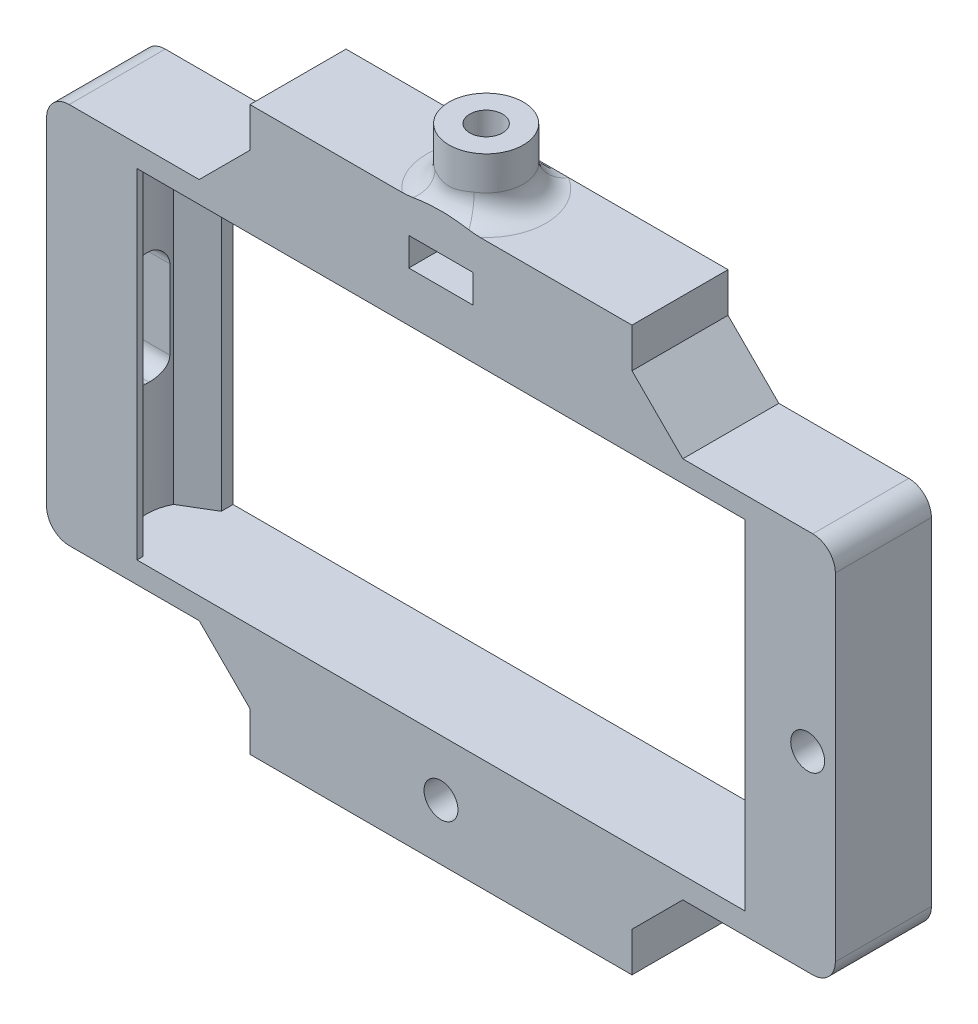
ISO-10303-21;
HEADER;
FILE_DESCRIPTION(('STEP AP214'),'2;1');
FILE_NAME('part.step','',(''),(''),'','','');
FILE_SCHEMA(('AUTOMOTIVE_DESIGN { 1 0 10303 214 1 1 1 1 }'));
ENDSEC;
DATA;
#1=APPLICATION_CONTEXT('core data for automotive mechanical design processes');
#2=APPLICATION_PROTOCOL_DEFINITION('international standard','automotive_design',2000,#1);
#3=PRODUCT_CONTEXT('',#1,'mechanical');
#4=PRODUCT('Part','Part','',(#3));
#5=PRODUCT_RELATED_PRODUCT_CATEGORY('part','',(#4));
#6=PRODUCT_DEFINITION_FORMATION('','',#4);
#7=PRODUCT_DEFINITION_CONTEXT('part definition',#1,'design');
#8=PRODUCT_DEFINITION('design','',#6,#7);
#9=PRODUCT_DEFINITION_SHAPE('','',#8);
#10=(LENGTH_UNIT() NAMED_UNIT(*) SI_UNIT(.MILLI.,.METRE.));
#11=(NAMED_UNIT(*) PLANE_ANGLE_UNIT() SI_UNIT($,.RADIAN.));
#12=(NAMED_UNIT(*) SI_UNIT($,.STERADIAN.) SOLID_ANGLE_UNIT());
#13=UNCERTAINTY_MEASURE_WITH_UNIT(LENGTH_MEASURE(1.E-05),#10,'distance_accuracy_value','');
#14=(GEOMETRIC_REPRESENTATION_CONTEXT(3) GLOBAL_UNCERTAINTY_ASSIGNED_CONTEXT((#13)) GLOBAL_UNIT_ASSIGNED_CONTEXT((#10,
#11,#12)) REPRESENTATION_CONTEXT('',''));
#15=CARTESIAN_POINT('',(0.,0.,0.));
#16=DIRECTION('',(0.,0.,1.));
#17=DIRECTION('',(1.,0.,0.));
#18=AXIS2_PLACEMENT_3D('',#15,#16,#17);
#19=CARTESIAN_POINT('',(0.,24.9,9.));
#20=DIRECTION('',(0.,1.,0.));
#21=DIRECTION('',(0.,0.,1.));
#22=AXIS2_PLACEMENT_3D('',#19,#20,#21);
#23=PLANE('',#22);
#24=DIRECTION('',(-1.,0.,0.));
#25=VECTOR('',#24,1.);
#26=CARTESIAN_POINT('',(0.,24.9,8.5));
#27=LINE('',#26,#25);
#28=CARTESIAN_POINT('',(-3.46317573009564,24.9,8.5));
#29=VERTEX_POINT('',#28);
#30=CARTESIAN_POINT('',(-16.9028008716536,24.9,8.5));
#31=VERTEX_POINT('',#30);
#32=EDGE_CURVE('E1487',#29,#31,#27,.T.);
#33=ORIENTED_EDGE('',*,*,#32,.F.);
#34=CARTESIAN_POINT('',(0.,24.9,4.5));
#35=DIRECTION('',(0.,1.,0.));
#36=DIRECTION('',(0.,0.,1.));
#37=AXIS2_PLACEMENT_3D('',#34,#35,#36);
#38=CIRCLE('',#37,5.29089653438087);
#39=CARTESIAN_POINT('',(-2.78272997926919,24.9,0.));
#40=VERTEX_POINT('',#39);
#41=EDGE_CURVE('E1472',#29,#40,#38,.F.);
#42=ORIENTED_EDGE('',*,*,#41,.T.);
#43=DIRECTION('',(1.,0.,0.));
#44=VECTOR('',#43,1.);
#45=CARTESIAN_POINT('',(0.,24.9,0.));
#46=LINE('',#45,#44);
#47=CARTESIAN_POINT('',(-16.9028008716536,24.9,0.));
#48=VERTEX_POINT('',#47);
#49=EDGE_CURVE('E676',#48,#40,#46,.T.);
#50=ORIENTED_EDGE('',*,*,#49,.F.);
#51=DIRECTION('',(0.,0.,-1.));
#52=VECTOR('',#51,1.);
#53=CARTESIAN_POINT('',(-16.9028008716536,24.9,9.));
#54=LINE('',#53,#52);
#55=EDGE_CURVE('E635',#31,#48,#54,.T.);
#56=ORIENTED_EDGE('',*,*,#55,.F.);
#57=EDGE_LOOP('',(#33,#42,#50,#56));
#58=FACE_BOUND('',#57,.T.);
#59=ADVANCED_FACE('F87',(#58),#23,.T.);
#60=CARTESIAN_POINT('',(26.9,-15.,0.));
#61=DIRECTION('',(1.,0.,0.));
#62=DIRECTION('',(0.,0.,-1.));
#63=AXIS2_PLACEMENT_3D('',#60,#61,#62);
#64=PLANE('',#63);
#65=DIRECTION('',(0.,0.,1.));
#66=VECTOR('',#65,1.);
#67=CARTESIAN_POINT('',(26.9,-15.,0.));
#68=LINE('',#67,#66);
#69=CARTESIAN_POINT('',(26.9,-15.,7.95922544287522));
#70=VERTEX_POINT('',#69);
#71=CARTESIAN_POINT('',(26.9,-15.,8.5));
#72=VERTEX_POINT('',#71);
#73=EDGE_CURVE('E711',#70,#72,#68,.T.);
#74=ORIENTED_EDGE('',*,*,#73,.T.);
#75=DIRECTION('',(0.,1.,0.));
#76=VECTOR('',#75,1.);
#77=CARTESIAN_POINT('',(26.9,-15.,8.5));
#78=LINE('',#77,#76);
#79=CARTESIAN_POINT('',(26.9,15.,8.5));
#80=VERTEX_POINT('',#79);
#81=EDGE_CURVE('E775',#72,#80,#78,.T.);
#82=ORIENTED_EDGE('',*,*,#81,.T.);
#83=DIRECTION('',(0.,0.,1.));
#84=VECTOR('',#83,1.);
#85=CARTESIAN_POINT('',(26.9,15.,0.));
#86=LINE('',#85,#84);
#87=CARTESIAN_POINT('',(26.9,15.,7.95922544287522));
#88=VERTEX_POINT('',#87);
#89=EDGE_CURVE('E911',#88,#80,#86,.T.);
#90=ORIENTED_EDGE('',*,*,#89,.F.);
#91=DIRECTION('',(0.,1.,0.));
#92=VECTOR('',#91,1.);
#93=CARTESIAN_POINT('',(26.9,-15.,7.95922544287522));
#94=LINE('',#93,#92);
#95=EDGE_CURVE('E898',#70,#88,#94,.T.);
#96=ORIENTED_EDGE('',*,*,#95,.F.);
#97=EDGE_LOOP('',(#74,#82,#90,#96));
#98=FACE_BOUND('',#97,.T.);
#99=ADVANCED_FACE('F590',(#98),#64,.F.);
#100=CARTESIAN_POINT('',(-26.9,-15.,0.));
#101=DIRECTION('',(-1.,0.,0.));
#102=DIRECTION('',(0.,0.,1.));
#103=AXIS2_PLACEMENT_3D('',#100,#101,#102);
#104=PLANE('',#103);
#105=DIRECTION('',(0.,1.,0.));
#106=VECTOR('',#105,1.);
#107=CARTESIAN_POINT('',(-26.9,-15.,1.0407745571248));
#108=LINE('',#107,#106);
#109=CARTESIAN_POINT('',(-26.9,-15.,1.0407745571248));
#110=VERTEX_POINT('',#109);
#111=CARTESIAN_POINT('',(-26.9,15.,1.0407745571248));
#112=VERTEX_POINT('',#111);
#113=EDGE_CURVE('E893',#110,#112,#108,.T.);
#114=ORIENTED_EDGE('',*,*,#113,.F.);
#115=DIRECTION('',(0.,0.,1.));
#116=VECTOR('',#115,1.);
#117=CARTESIAN_POINT('',(-26.9,-15.,0.));
#118=LINE('',#117,#116);
#119=CARTESIAN_POINT('',(-26.9,-15.,0.));
#120=VERTEX_POINT('',#119);
#121=EDGE_CURVE('E913',#120,#110,#118,.T.);
#122=ORIENTED_EDGE('',*,*,#121,.F.);
#123=DIRECTION('',(0.,-1.,0.));
#124=VECTOR('',#123,1.);
#125=CARTESIAN_POINT('',(-26.9,-15.,0.));
#126=LINE('',#125,#124);
#127=CARTESIAN_POINT('',(-26.9,15.,0.));
#128=VERTEX_POINT('',#127);
#129=EDGE_CURVE('E906',#128,#120,#126,.T.);
#130=ORIENTED_EDGE('',*,*,#129,.F.);
#131=DIRECTION('',(0.,0.,1.));
#132=VECTOR('',#131,1.);
#133=CARTESIAN_POINT('',(-26.9,15.,0.));
#134=LINE('',#133,#132);
#135=EDGE_CURVE('E916',#128,#112,#134,.T.);
#136=ORIENTED_EDGE('',*,*,#135,.T.);
#137=EDGE_LOOP('',(#114,#122,#130,#136));
#138=FACE_BOUND('',#137,.T.);
#139=ADVANCED_FACE('F597',(#138),#104,.F.);
#140=CARTESIAN_POINT('',(0.,16.9028008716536,9.));
#141=DIRECTION('',(0.,-1.,0.));
#142=DIRECTION('',(0.,0.,-1.));
#143=AXIS2_PLACEMENT_3D('',#140,#141,#142);
#144=PLANE('',#143);
#145=DIRECTION('',(0.,0.,-1.));
#146=VECTOR('',#145,1.);
#147=CARTESIAN_POINT('',(-32.9,16.9028008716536,9.));
#148=LINE('',#147,#146);
#149=CARTESIAN_POINT('',(-32.9,16.9028008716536,0.));
#150=VERTEX_POINT('',#149);
#151=CARTESIAN_POINT('',(-32.9,16.9028008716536,8.5));
#152=VERTEX_POINT('',#151);
#153=EDGE_CURVE('E468',#150,#152,#148,.F.);
#154=ORIENTED_EDGE('',*,*,#153,.T.);
#155=DIRECTION('',(1.,0.,0.));
#156=VECTOR('',#155,1.);
#157=CARTESIAN_POINT('',(0.,16.9028008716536,8.5));
#158=LINE('',#157,#156);
#159=CARTESIAN_POINT('',(-21.4,16.9028008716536,8.5));
#160=VERTEX_POINT('',#159);
#161=EDGE_CURVE('E422',#152,#160,#158,.T.);
#162=ORIENTED_EDGE('',*,*,#161,.T.);
#163=DIRECTION('',(0.,0.,-1.));
#164=VECTOR('',#163,1.);
#165=CARTESIAN_POINT('',(-21.4,16.9028008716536,9.));
#166=LINE('',#165,#164);
#167=CARTESIAN_POINT('',(-21.4,16.9028008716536,0.));
#168=VERTEX_POINT('',#167);
#169=EDGE_CURVE('E686',#160,#168,#166,.T.);
#170=ORIENTED_EDGE('',*,*,#169,.T.);
#171=DIRECTION('',(-1.,0.,0.));
#172=VECTOR('',#171,1.);
#173=CARTESIAN_POINT('',(0.,16.9028008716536,0.));
#174=LINE('',#173,#172);
#175=EDGE_CURVE('E699',#168,#150,#174,.T.);
#176=ORIENTED_EDGE('',*,*,#175,.T.);
#177=EDGE_LOOP('',(#154,#162,#170,#176));
#178=FACE_BOUND('',#177,.T.);
#179=ADVANCED_FACE('F493',(#178),#144,.F.);
#180=CARTESIAN_POINT('',(-34.9,0.,9.));
#181=DIRECTION('',(1.,0.,0.));
#182=DIRECTION('',(0.,1.,0.));
#183=AXIS2_PLACEMENT_3D('',#180,#181,#182);
#184=PLANE('',#183);
#185=DIRECTION('',(0.,0.,-1.));
#186=VECTOR('',#185,1.);
#187=CARTESIAN_POINT('',(-34.9,5.,2.85));
#188=LINE('',#187,#186);
#189=CARTESIAN_POINT('',(-34.9,5.,4.65));
#190=VERTEX_POINT('',#189);
#191=CARTESIAN_POINT('',(-34.9,5.,4.35));
#192=VERTEX_POINT('',#191);
#193=EDGE_CURVE('E829',#190,#192,#188,.T.);
#194=ORIENTED_EDGE('',*,*,#193,.F.);
#195=CARTESIAN_POINT('',(-34.9,3.5,4.65));
#196=DIRECTION('',(1.,0.,0.));
#197=DIRECTION('',(0.,1.,0.));
#198=AXIS2_PLACEMENT_3D('',#195,#196,#197);
#199=CIRCLE('',#198,1.5);
#200=CARTESIAN_POINT('',(-34.9,3.5,6.15));
#201=VERTEX_POINT('',#200);
#202=EDGE_CURVE('E545',#190,#201,#199,.T.);
#203=ORIENTED_EDGE('',*,*,#202,.T.);
#204=DIRECTION('',(0.,1.,0.));
#205=VECTOR('',#204,1.);
#206=CARTESIAN_POINT('',(-34.9,5.,6.15));
#207=LINE('',#206,#205);
#208=CARTESIAN_POINT('',(-34.9,-3.5,6.15));
#209=VERTEX_POINT('',#208);
#210=EDGE_CURVE('E803',#209,#201,#207,.T.);
#211=ORIENTED_EDGE('',*,*,#210,.F.);
#212=CARTESIAN_POINT('',(-34.9,-3.5,4.65));
#213=DIRECTION('',(1.,0.,0.));
#214=DIRECTION('',(0.,1.,0.));
#215=AXIS2_PLACEMENT_3D('',#212,#213,#214);
#216=CIRCLE('',#215,1.5);
#217=CARTESIAN_POINT('',(-34.9,-5.,4.65));
#218=VERTEX_POINT('',#217);
#219=EDGE_CURVE('E546',#209,#218,#216,.T.);
#220=ORIENTED_EDGE('',*,*,#219,.T.);
#221=DIRECTION('',(0.,0.,1.));
#222=VECTOR('',#221,1.);
#223=CARTESIAN_POINT('',(-34.9,-5.,2.85));
#224=LINE('',#223,#222);
#225=CARTESIAN_POINT('',(-34.9,-5.,4.35));
#226=VERTEX_POINT('',#225);
#227=EDGE_CURVE('E835',#226,#218,#224,.T.);
#228=ORIENTED_EDGE('',*,*,#227,.F.);
#229=CARTESIAN_POINT('',(-34.9,-3.5,4.35));
#230=DIRECTION('',(1.,0.,0.));
#231=DIRECTION('',(0.,1.,0.));
#232=AXIS2_PLACEMENT_3D('',#229,#230,#231);
#233=CIRCLE('',#232,1.5);
#234=CARTESIAN_POINT('',(-34.9,-3.5,2.85));
#235=VERTEX_POINT('',#234);
#236=EDGE_CURVE('E576',#226,#235,#233,.T.);
#237=ORIENTED_EDGE('',*,*,#236,.T.);
#238=DIRECTION('',(0.,-1.,0.));
#239=VECTOR('',#238,1.);
#240=CARTESIAN_POINT('',(-34.9,5.,2.85));
#241=LINE('',#240,#239);
#242=CARTESIAN_POINT('',(-34.9,3.5,2.85));
#243=VERTEX_POINT('',#242);
#244=EDGE_CURVE('E832',#243,#235,#241,.T.);
#245=ORIENTED_EDGE('',*,*,#244,.F.);
#246=CARTESIAN_POINT('',(-34.9,3.5,4.35));
#247=DIRECTION('',(1.,0.,0.));
#248=DIRECTION('',(0.,1.,0.));
#249=AXIS2_PLACEMENT_3D('',#246,#247,#248);
#250=CIRCLE('',#249,1.5);
#251=EDGE_CURVE('E97',#243,#192,#250,.T.);
#252=ORIENTED_EDGE('',*,*,#251,.T.);
#253=EDGE_LOOP('',(#194,#203,#211,#220,#228,#237,#245,#252));
#254=FACE_BOUND('',#253,.T.);
#255=DIRECTION('',(0.,0.,-1.));
#256=VECTOR('',#255,1.);
#257=CARTESIAN_POINT('',(-34.9,-14.9028008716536,9.));
#258=LINE('',#257,#256);
#259=CARTESIAN_POINT('',(-34.9,-14.9028008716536,0.));
#260=VERTEX_POINT('',#259);
#261=CARTESIAN_POINT('',(-34.9,-14.9028008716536,8.5));
#262=VERTEX_POINT('',#261);
#263=EDGE_CURVE('E465',#260,#262,#258,.F.);
#264=ORIENTED_EDGE('',*,*,#263,.T.);
#265=DIRECTION('',(0.,1.,0.));
#266=VECTOR('',#265,1.);
#267=CARTESIAN_POINT('',(-34.9,0.,8.5));
#268=LINE('',#267,#266);
#269=CARTESIAN_POINT('',(-34.9,14.9028008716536,8.5));
#270=VERTEX_POINT('',#269);
#271=EDGE_CURVE('E751',#262,#270,#268,.T.);
#272=ORIENTED_EDGE('',*,*,#271,.T.);
#273=DIRECTION('',(0.,0.,-1.));
#274=VECTOR('',#273,1.);
#275=CARTESIAN_POINT('',(-34.9,14.9028008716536,9.));
#276=LINE('',#275,#274);
#277=CARTESIAN_POINT('',(-34.9,14.9028008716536,0.));
#278=VERTEX_POINT('',#277);
#279=EDGE_CURVE('E463',#270,#278,#276,.T.);
#280=ORIENTED_EDGE('',*,*,#279,.T.);
#281=DIRECTION('',(0.,-1.,0.));
#282=VECTOR('',#281,1.);
#283=CARTESIAN_POINT('',(-34.9,0.,0.));
#284=LINE('',#283,#282);
#285=EDGE_CURVE('E704',#278,#260,#284,.T.);
#286=ORIENTED_EDGE('',*,*,#285,.T.);
#287=EDGE_LOOP('',(#264,#272,#280,#286));
#288=FACE_BOUND('',#287,.T.);
#289=ADVANCED_FACE('F745',(#254,#288),#184,.F.);
#290=CARTESIAN_POINT('',(0.,-16.9028008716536,9.));
#291=DIRECTION('',(0.,-1.,0.));
#292=DIRECTION('',(0.,0.,-1.));
#293=AXIS2_PLACEMENT_3D('',#290,#291,#292);
#294=PLANE('',#293);
#295=DIRECTION('',(1.,0.,0.));
#296=VECTOR('',#295,1.);
#297=CARTESIAN_POINT('',(0.,-16.9028008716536,8.5));
#298=LINE('',#297,#296);
#299=CARTESIAN_POINT('',(-32.9,-16.9028008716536,8.5));
#300=VERTEX_POINT('',#299);
#301=CARTESIAN_POINT('',(-21.4,-16.9028008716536,8.5));
#302=VERTEX_POINT('',#301);
#303=EDGE_CURVE('E739',#300,#302,#298,.T.);
#304=ORIENTED_EDGE('',*,*,#303,.F.);
#305=DIRECTION('',(0.,0.,-1.));
#306=VECTOR('',#305,1.);
#307=CARTESIAN_POINT('',(-32.9,-16.9028008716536,0.));
#308=LINE('',#307,#306);
#309=CARTESIAN_POINT('',(-32.9,-16.9028008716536,0.));
#310=VERTEX_POINT('',#309);
#311=EDGE_CURVE('E461',#300,#310,#308,.T.);
#312=ORIENTED_EDGE('',*,*,#311,.T.);
#313=DIRECTION('',(-1.,0.,0.));
#314=VECTOR('',#313,1.);
#315=CARTESIAN_POINT('',(0.,-16.9028008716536,0.));
#316=LINE('',#315,#314);
#317=CARTESIAN_POINT('',(-21.4,-16.9028008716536,0.));
#318=VERTEX_POINT('',#317);
#319=EDGE_CURVE('E708',#318,#310,#316,.T.);
#320=ORIENTED_EDGE('',*,*,#319,.F.);
#321=DIRECTION('',(0.,0.,-1.));
#322=VECTOR('',#321,1.);
#323=CARTESIAN_POINT('',(-21.4,-16.9028008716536,9.));
#324=LINE('',#323,#322);
#325=EDGE_CURVE('E438',#302,#318,#324,.T.);
#326=ORIENTED_EDGE('',*,*,#325,.F.);
#327=EDGE_LOOP('',(#304,#312,#320,#326));
#328=FACE_BOUND('',#327,.T.);
#329=ADVANCED_FACE('F738',(#328),#294,.T.);
#330=CARTESIAN_POINT('',(-19.1514004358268,-19.1514004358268,9.));
#331=DIRECTION('',(0.707106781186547,0.707106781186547,0.));
#332=DIRECTION('',(-0.707106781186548,0.707106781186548,0.));
#333=AXIS2_PLACEMENT_3D('',#330,#331,#332);
#334=PLANE('',#333);
#335=DIRECTION('',(0.,0.,-1.));
#336=VECTOR('',#335,1.);
#337=CARTESIAN_POINT('',(-16.9028008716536,-21.4,9.));
#338=LINE('',#337,#336);
#339=CARTESIAN_POINT('',(-16.9028008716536,-21.4,8.5));
#340=VERTEX_POINT('',#339);
#341=CARTESIAN_POINT('',(-16.9028008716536,-21.4,0.));
#342=VERTEX_POINT('',#341);
#343=EDGE_CURVE('E431',#340,#342,#338,.T.);
#344=ORIENTED_EDGE('',*,*,#343,.F.);
#345=DIRECTION('',(-0.707106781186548,0.707106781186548,0.));
#346=VECTOR('',#345,1.);
#347=CARTESIAN_POINT('',(-19.1514004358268,-19.1514004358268,8.5));
#348=LINE('',#347,#346);
#349=EDGE_CURVE('E735',#340,#302,#348,.T.);
#350=ORIENTED_EDGE('',*,*,#349,.T.);
#351=ORIENTED_EDGE('',*,*,#325,.T.);
#352=DIRECTION('',(0.707106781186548,-0.707106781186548,0.));
#353=VECTOR('',#352,1.);
#354=CARTESIAN_POINT('',(-19.1514004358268,-19.1514004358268,0.));
#355=LINE('',#354,#353);
#356=EDGE_CURVE('E719',#318,#342,#355,.T.);
#357=ORIENTED_EDGE('',*,*,#356,.T.);
#358=EDGE_LOOP('',(#344,#350,#351,#357));
#359=FACE_BOUND('',#358,.T.);
#360=ADVANCED_FACE('F733',(#359),#334,.F.);
#361=CARTESIAN_POINT('',(-16.9028008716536,0.,9.));
#362=DIRECTION('',(1.,0.,0.));
#363=DIRECTION('',(0.,1.,0.));
#364=AXIS2_PLACEMENT_3D('',#361,#362,#363);
#365=PLANE('',#364);
#366=DIRECTION('',(0.,0.,-1.));
#367=VECTOR('',#366,1.);
#368=CARTESIAN_POINT('',(-16.9028008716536,-24.9,9.));
#369=LINE('',#368,#367);
#370=CARTESIAN_POINT('',(-16.9028008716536,-24.9,8.5));
#371=VERTEX_POINT('',#370);
#372=CARTESIAN_POINT('',(-16.9028008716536,-24.9,0.));
#373=VERTEX_POINT('',#372);
#374=EDGE_CURVE('E429',#371,#373,#369,.T.);
#375=ORIENTED_EDGE('',*,*,#374,.F.);
#376=DIRECTION('',(0.,1.,0.));
#377=VECTOR('',#376,1.);
#378=CARTESIAN_POINT('',(-16.9028008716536,0.,8.5));
#379=LINE('',#378,#377);
#380=EDGE_CURVE('E410',#371,#340,#379,.T.);
#381=ORIENTED_EDGE('',*,*,#380,.T.);
#382=ORIENTED_EDGE('',*,*,#343,.T.);
#383=DIRECTION('',(0.,-1.,0.));
#384=VECTOR('',#383,1.);
#385=CARTESIAN_POINT('',(-16.9028008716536,0.,0.));
#386=LINE('',#385,#384);
#387=EDGE_CURVE('E722',#342,#373,#386,.T.);
#388=ORIENTED_EDGE('',*,*,#387,.T.);
#389=EDGE_LOOP('',(#375,#381,#382,#388));
#390=FACE_BOUND('',#389,.T.);
#391=ADVANCED_FACE('F729',(#390),#365,.F.);
#392=CARTESIAN_POINT('',(0.,-24.9,9.));
#393=DIRECTION('',(0.,1.,0.));
#394=DIRECTION('',(0.,0.,1.));
#395=AXIS2_PLACEMENT_3D('',#392,#393,#394);
#396=PLANE('',#395);
#397=DIRECTION('',(0.,0.,-1.));
#398=VECTOR('',#397,1.);
#399=CARTESIAN_POINT('',(16.9028008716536,-24.9,9.));
#400=LINE('',#399,#398);
#401=CARTESIAN_POINT('',(16.9028008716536,-24.9,8.5));
#402=VERTEX_POINT('',#401);
#403=CARTESIAN_POINT('',(16.9028008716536,-24.9,0.));
#404=VERTEX_POINT('',#403);
#405=EDGE_CURVE('E419',#402,#404,#400,.T.);
#406=ORIENTED_EDGE('',*,*,#405,.F.);
#407=DIRECTION('',(-1.,0.,0.));
#408=VECTOR('',#407,1.);
#409=CARTESIAN_POINT('',(-35.9405169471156,-24.9,8.5));
#410=LINE('',#409,#408);
#411=EDGE_CURVE('E404',#402,#371,#410,.T.);
#412=ORIENTED_EDGE('',*,*,#411,.T.);
#413=ORIENTED_EDGE('',*,*,#374,.T.);
#414=DIRECTION('',(1.,0.,0.));
#415=VECTOR('',#414,1.);
#416=CARTESIAN_POINT('',(0.,-24.9,0.));
#417=LINE('',#416,#415);
#418=EDGE_CURVE('E427',#373,#404,#417,.T.);
#419=ORIENTED_EDGE('',*,*,#418,.T.);
#420=EDGE_LOOP('',(#406,#412,#413,#419));
#421=FACE_BOUND('',#420,.T.);
#422=ADVANCED_FACE('F425',(#421),#396,.F.);
#423=CARTESIAN_POINT('',(16.9028008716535,0.,9.));
#424=DIRECTION('',(-1.,0.,0.));
#425=DIRECTION('',(0.,-1.,0.));
#426=AXIS2_PLACEMENT_3D('',#423,#424,#425);
#427=PLANE('',#426);
#428=DIRECTION('',(0.,0.,-1.));
#429=VECTOR('',#428,1.);
#430=CARTESIAN_POINT('',(16.9028008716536,-21.4,9.));
#431=LINE('',#430,#429);
#432=CARTESIAN_POINT('',(16.9028008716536,-21.4,8.5));
#433=VERTEX_POINT('',#432);
#434=CARTESIAN_POINT('',(16.9028008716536,-21.4,0.));
#435=VERTEX_POINT('',#434);
#436=EDGE_CURVE('E421',#433,#435,#431,.T.);
#437=ORIENTED_EDGE('',*,*,#436,.F.);
#438=DIRECTION('',(0.,-1.,0.));
#439=VECTOR('',#438,1.);
#440=CARTESIAN_POINT('',(16.9028008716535,0.,8.5));
#441=LINE('',#440,#439);
#442=EDGE_CURVE('E407',#433,#402,#441,.T.);
#443=ORIENTED_EDGE('',*,*,#442,.T.);
#444=ORIENTED_EDGE('',*,*,#405,.T.);
#445=DIRECTION('',(0.,1.,0.));
#446=VECTOR('',#445,1.);
#447=CARTESIAN_POINT('',(16.9028008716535,0.,0.));
#448=LINE('',#447,#446);
#449=EDGE_CURVE('E658',#404,#435,#448,.T.);
#450=ORIENTED_EDGE('',*,*,#449,.T.);
#451=EDGE_LOOP('',(#437,#443,#444,#450));
#452=FACE_BOUND('',#451,.T.);
#453=ADVANCED_FACE('F417',(#452),#427,.F.);
#454=CARTESIAN_POINT('',(19.1514004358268,-19.1514004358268,9.));
#455=DIRECTION('',(-0.707106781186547,0.707106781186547,0.));
#456=DIRECTION('',(-0.707106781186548,-0.707106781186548,0.));
#457=AXIS2_PLACEMENT_3D('',#454,#455,#456);
#458=PLANE('',#457);
#459=DIRECTION('',(0.,0.,-1.));
#460=VECTOR('',#459,1.);
#461=CARTESIAN_POINT('',(21.4,-16.9028008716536,9.));
#462=LINE('',#461,#460);
#463=CARTESIAN_POINT('',(21.4,-16.9028008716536,8.5));
#464=VERTEX_POINT('',#463);
#465=CARTESIAN_POINT('',(21.4,-16.9028008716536,0.));
#466=VERTEX_POINT('',#465);
#467=EDGE_CURVE('E433',#464,#466,#462,.T.);
#468=ORIENTED_EDGE('',*,*,#467,.F.);
#469=DIRECTION('',(-0.707106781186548,-0.707106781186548,0.));
#470=VECTOR('',#469,1.);
#471=CARTESIAN_POINT('',(19.1514004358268,-19.1514004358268,8.5));
#472=LINE('',#471,#470);
#473=EDGE_CURVE('E423',#464,#433,#472,.T.);
#474=ORIENTED_EDGE('',*,*,#473,.T.);
#475=ORIENTED_EDGE('',*,*,#436,.T.);
#476=DIRECTION('',(0.707106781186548,0.707106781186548,0.));
#477=VECTOR('',#476,1.);
#478=CARTESIAN_POINT('',(19.1514004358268,-19.1514004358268,0.));
#479=LINE('',#478,#477);
#480=EDGE_CURVE('E655',#435,#466,#479,.T.);
#481=ORIENTED_EDGE('',*,*,#480,.T.);
#482=EDGE_LOOP('',(#468,#474,#475,#481));
#483=FACE_BOUND('',#482,.T.);
#484=ADVANCED_FACE('F656',(#483),#458,.F.);
#485=CARTESIAN_POINT('',(0.,-16.9028008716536,9.));
#486=DIRECTION('',(0.,1.,0.));
#487=DIRECTION('',(0.,0.,1.));
#488=AXIS2_PLACEMENT_3D('',#485,#486,#487);
#489=PLANE('',#488);
#490=DIRECTION('',(0.,0.,-1.));
#491=VECTOR('',#490,1.);
#492=CARTESIAN_POINT('',(32.9,-16.9028008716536,9.));
#493=LINE('',#492,#491);
#494=CARTESIAN_POINT('',(32.9,-16.9028008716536,0.));
#495=VERTEX_POINT('',#494);
#496=CARTESIAN_POINT('',(32.9,-16.9028008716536,8.5));
#497=VERTEX_POINT('',#496);
#498=EDGE_CURVE('E458',#495,#497,#493,.F.);
#499=ORIENTED_EDGE('',*,*,#498,.T.);
#500=DIRECTION('',(-1.,0.,0.));
#501=VECTOR('',#500,1.);
#502=CARTESIAN_POINT('',(0.,-16.9028008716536,8.5));
#503=LINE('',#502,#501);
#504=EDGE_CURVE('E652',#497,#464,#503,.T.);
#505=ORIENTED_EDGE('',*,*,#504,.T.);
#506=ORIENTED_EDGE('',*,*,#467,.T.);
#507=DIRECTION('',(1.,0.,0.));
#508=VECTOR('',#507,1.);
#509=CARTESIAN_POINT('',(0.,-16.9028008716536,0.));
#510=LINE('',#509,#508);
#511=EDGE_CURVE('E650',#466,#495,#510,.T.);
#512=ORIENTED_EDGE('',*,*,#511,.T.);
#513=EDGE_LOOP('',(#499,#505,#506,#512));
#514=FACE_BOUND('',#513,.T.);
#515=ADVANCED_FACE('F648',(#514),#489,.F.);
#516=CARTESIAN_POINT('',(34.9,0.,9.));
#517=DIRECTION('',(1.,0.,0.));
#518=DIRECTION('',(0.,1.,0.));
#519=AXIS2_PLACEMENT_3D('',#516,#517,#518);
#520=PLANE('',#519);
#521=DIRECTION('',(0.,1.,0.));
#522=VECTOR('',#521,1.);
#523=CARTESIAN_POINT('',(34.9,0.,8.5));
#524=LINE('',#523,#522);
#525=CARTESIAN_POINT('',(34.9,-14.9028008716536,8.5));
#526=VERTEX_POINT('',#525);
#527=CARTESIAN_POINT('',(34.9,14.9028008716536,8.5));
#528=VERTEX_POINT('',#527);
#529=EDGE_CURVE('E1499',#526,#528,#524,.T.);
#530=ORIENTED_EDGE('',*,*,#529,.F.);
#531=DIRECTION('',(0.,0.,-1.));
#532=VECTOR('',#531,1.);
#533=CARTESIAN_POINT('',(34.9,-14.9028008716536,0.));
#534=LINE('',#533,#532);
#535=CARTESIAN_POINT('',(34.9,-14.9028008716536,0.));
#536=VERTEX_POINT('',#535);
#537=EDGE_CURVE('E448',#526,#536,#534,.T.);
#538=ORIENTED_EDGE('',*,*,#537,.T.);
#539=DIRECTION('',(0.,-1.,0.));
#540=VECTOR('',#539,1.);
#541=CARTESIAN_POINT('',(34.9,0.,0.));
#542=LINE('',#541,#540);
#543=CARTESIAN_POINT('',(34.9,14.9028008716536,0.));
#544=VERTEX_POINT('',#543);
#545=EDGE_CURVE('E663',#544,#536,#542,.T.);
#546=ORIENTED_EDGE('',*,*,#545,.F.);
#547=DIRECTION('',(0.,0.,-1.));
#548=VECTOR('',#547,1.);
#549=CARTESIAN_POINT('',(34.9,14.9028008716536,9.));
#550=LINE('',#549,#548);
#551=EDGE_CURVE('E440',#544,#528,#550,.F.);
#552=ORIENTED_EDGE('',*,*,#551,.T.);
#553=EDGE_LOOP('',(#530,#538,#546,#552));
#554=FACE_BOUND('',#553,.T.);
#555=ADVANCED_FACE('F1354',(#554),#520,.T.);
#556=CARTESIAN_POINT('',(0.,16.9028008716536,9.));
#557=DIRECTION('',(0.,-1.,0.));
#558=DIRECTION('',(0.,0.,-1.));
#559=AXIS2_PLACEMENT_3D('',#556,#557,#558);
#560=PLANE('',#559);
#561=DIRECTION('',(0.,0.,-1.));
#562=VECTOR('',#561,1.);
#563=CARTESIAN_POINT('',(21.4,16.9028008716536,9.));
#564=LINE('',#563,#562);
#565=CARTESIAN_POINT('',(21.4,16.9028008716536,8.5));
#566=VERTEX_POINT('',#565);
#567=CARTESIAN_POINT('',(21.4,16.9028008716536,0.));
#568=VERTEX_POINT('',#567);
#569=EDGE_CURVE('E637',#566,#568,#564,.T.);
#570=ORIENTED_EDGE('',*,*,#569,.F.);
#571=DIRECTION('',(1.,0.,0.));
#572=VECTOR('',#571,1.);
#573=CARTESIAN_POINT('',(0.,16.9028008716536,8.5));
#574=LINE('',#573,#572);
#575=CARTESIAN_POINT('',(32.9,16.9028008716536,8.5));
#576=VERTEX_POINT('',#575);
#577=EDGE_CURVE('E1489',#566,#576,#574,.T.);
#578=ORIENTED_EDGE('',*,*,#577,.T.);
#579=DIRECTION('',(0.,0.,-1.));
#580=VECTOR('',#579,1.);
#581=CARTESIAN_POINT('',(32.9,16.9028008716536,0.));
#582=LINE('',#581,#580);
#583=CARTESIAN_POINT('',(32.9,16.9028008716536,0.));
#584=VERTEX_POINT('',#583);
#585=EDGE_CURVE('E471',#576,#584,#582,.T.);
#586=ORIENTED_EDGE('',*,*,#585,.T.);
#587=DIRECTION('',(-1.,0.,0.));
#588=VECTOR('',#587,1.);
#589=CARTESIAN_POINT('',(0.,16.9028008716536,0.));
#590=LINE('',#589,#588);
#591=EDGE_CURVE('E665',#584,#568,#590,.T.);
#592=ORIENTED_EDGE('',*,*,#591,.T.);
#593=EDGE_LOOP('',(#570,#578,#586,#592));
#594=FACE_BOUND('',#593,.T.);
#595=ADVANCED_FACE('F1361',(#594),#560,.F.);
#596=CARTESIAN_POINT('',(19.1514004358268,19.1514004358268,9.));
#597=DIRECTION('',(-0.707106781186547,-0.707106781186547,0.));
#598=DIRECTION('',(0.707106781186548,-0.707106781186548,0.));
#599=AXIS2_PLACEMENT_3D('',#596,#597,#598);
#600=PLANE('',#599);
#601=DIRECTION('',(0.,0.,-1.));
#602=VECTOR('',#601,1.);
#603=CARTESIAN_POINT('',(16.9028008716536,21.4,9.));
#604=LINE('',#603,#602);
#605=CARTESIAN_POINT('',(16.9028008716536,21.4,8.5));
#606=VERTEX_POINT('',#605);
#607=CARTESIAN_POINT('',(16.9028008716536,21.4,0.));
#608=VERTEX_POINT('',#607);
#609=EDGE_CURVE('E634',#606,#608,#604,.T.);
#610=ORIENTED_EDGE('',*,*,#609,.F.);
#611=DIRECTION('',(0.707106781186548,-0.707106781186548,0.));
#612=VECTOR('',#611,1.);
#613=CARTESIAN_POINT('',(19.1514004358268,19.1514004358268,8.5));
#614=LINE('',#613,#612);
#615=EDGE_CURVE('E1494',#606,#566,#614,.T.);
#616=ORIENTED_EDGE('',*,*,#615,.T.);
#617=ORIENTED_EDGE('',*,*,#569,.T.);
#618=DIRECTION('',(-0.707106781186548,0.707106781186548,0.));
#619=VECTOR('',#618,1.);
#620=CARTESIAN_POINT('',(19.1514004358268,19.1514004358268,0.));
#621=LINE('',#620,#619);
#622=EDGE_CURVE('E671',#568,#608,#621,.T.);
#623=ORIENTED_EDGE('',*,*,#622,.T.);
#624=EDGE_LOOP('',(#610,#616,#617,#623));
#625=FACE_BOUND('',#624,.T.);
#626=ADVANCED_FACE('F615',(#625),#600,.F.);
#627=CARTESIAN_POINT('',(16.9028008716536,0.,9.));
#628=DIRECTION('',(-1.,0.,0.));
#629=DIRECTION('',(0.,0.,1.));
#630=AXIS2_PLACEMENT_3D('',#627,#628,#629);
#631=PLANE('',#630);
#632=DIRECTION('',(0.,0.,-1.));
#633=VECTOR('',#632,1.);
#634=CARTESIAN_POINT('',(16.9028008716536,24.9,9.));
#635=LINE('',#634,#633);
#636=CARTESIAN_POINT('',(16.9028008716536,24.9,8.5));
#637=VERTEX_POINT('',#636);
#638=CARTESIAN_POINT('',(16.9028008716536,24.9,0.));
#639=VERTEX_POINT('',#638);
#640=EDGE_CURVE('E621',#637,#639,#635,.T.);
#641=ORIENTED_EDGE('',*,*,#640,.F.);
#642=DIRECTION('',(0.,-1.,0.));
#643=VECTOR('',#642,1.);
#644=CARTESIAN_POINT('',(16.9028008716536,0.,8.5));
#645=LINE('',#644,#643);
#646=EDGE_CURVE('E626',#637,#606,#645,.T.);
#647=ORIENTED_EDGE('',*,*,#646,.T.);
#648=ORIENTED_EDGE('',*,*,#609,.T.);
#649=DIRECTION('',(0.,1.,0.));
#650=VECTOR('',#649,1.);
#651=CARTESIAN_POINT('',(16.9028008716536,0.,0.));
#652=LINE('',#651,#650);
#653=EDGE_CURVE('E633',#608,#639,#652,.T.);
#654=ORIENTED_EDGE('',*,*,#653,.T.);
#655=EDGE_LOOP('',(#641,#647,#648,#654));
#656=FACE_BOUND('',#655,.T.);
#657=ADVANCED_FACE('F607',(#656),#631,.F.);
#658=DIRECTION('',(-1.,0.,0.));
#659=VECTOR('',#658,1.);
#660=CARTESIAN_POINT('',(0.,24.9,8.5));
#661=LINE('',#660,#659);
#662=CARTESIAN_POINT('',(3.46317573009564,24.9,8.5));
#663=VERTEX_POINT('',#662);
#664=EDGE_CURVE('E619',#637,#663,#661,.T.);
#665=ORIENTED_EDGE('',*,*,#664,.F.);
#666=ORIENTED_EDGE('',*,*,#640,.T.);
#667=CARTESIAN_POINT('',(2.78272997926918,24.9,0.));
#668=VERTEX_POINT('',#667);
#669=EDGE_CURVE('E675',#668,#639,#46,.T.);
#670=ORIENTED_EDGE('',*,*,#669,.F.);
#671=CARTESIAN_POINT('',(0.,24.9,4.5));
#672=DIRECTION('',(0.,1.,0.));
#673=DIRECTION('',(0.,0.,1.));
#674=AXIS2_PLACEMENT_3D('',#671,#672,#673);
#675=CIRCLE('',#674,5.29089653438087);
#676=EDGE_CURVE('E624',#668,#663,#675,.F.);
#677=ORIENTED_EDGE('',*,*,#676,.T.);
#678=EDGE_LOOP('',(#665,#666,#670,#677));
#679=FACE_BOUND('',#678,.T.);
#680=ADVANCED_FACE('F592',(#679),#23,.T.);
#681=CARTESIAN_POINT('',(-16.9028008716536,0.,9.));
#682=DIRECTION('',(1.,0.,0.));
#683=DIRECTION('',(0.,0.,-1.));
#684=AXIS2_PLACEMENT_3D('',#681,#682,#683);
#685=PLANE('',#684);
#686=DIRECTION('',(0.,0.,-1.));
#687=VECTOR('',#686,1.);
#688=CARTESIAN_POINT('',(-16.9028008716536,21.4,9.));
#689=LINE('',#688,#687);
#690=CARTESIAN_POINT('',(-16.9028008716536,21.4,8.5));
#691=VERTEX_POINT('',#690);
#692=CARTESIAN_POINT('',(-16.9028008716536,21.4,0.));
#693=VERTEX_POINT('',#692);
#694=EDGE_CURVE('E639',#691,#693,#689,.T.);
#695=ORIENTED_EDGE('',*,*,#694,.F.);
#696=DIRECTION('',(0.,1.,0.));
#697=VECTOR('',#696,1.);
#698=CARTESIAN_POINT('',(-16.9028008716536,0.,8.5));
#699=LINE('',#698,#697);
#700=EDGE_CURVE('E1491',#691,#31,#699,.T.);
#701=ORIENTED_EDGE('',*,*,#700,.T.);
#702=ORIENTED_EDGE('',*,*,#55,.T.);
#703=DIRECTION('',(0.,-1.,0.));
#704=VECTOR('',#703,1.);
#705=CARTESIAN_POINT('',(-16.9028008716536,0.,0.));
#706=LINE('',#705,#704);
#707=EDGE_CURVE('E679',#48,#693,#706,.T.);
#708=ORIENTED_EDGE('',*,*,#707,.T.);
#709=EDGE_LOOP('',(#695,#701,#702,#708));
#710=FACE_BOUND('',#709,.T.);
#711=ADVANCED_FACE('F606',(#710),#685,.F.);
#712=CARTESIAN_POINT('',(-19.1514004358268,19.1514004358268,9.));
#713=DIRECTION('',(0.707106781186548,-0.707106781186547,0.));
#714=DIRECTION('',(0.707106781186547,0.707106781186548,0.));
#715=AXIS2_PLACEMENT_3D('',#712,#713,#714);
#716=PLANE('',#715);
#717=ORIENTED_EDGE('',*,*,#169,.F.);
#718=DIRECTION('',(0.707106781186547,0.707106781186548,0.));
#719=VECTOR('',#718,1.);
#720=CARTESIAN_POINT('',(-19.1514004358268,19.1514004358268,8.5));
#721=LINE('',#720,#719);
#722=EDGE_CURVE('E693',#160,#691,#721,.T.);
#723=ORIENTED_EDGE('',*,*,#722,.T.);
#724=ORIENTED_EDGE('',*,*,#694,.T.);
#725=DIRECTION('',(-0.707106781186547,-0.707106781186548,0.));
#726=VECTOR('',#725,1.);
#727=CARTESIAN_POINT('',(-19.1514004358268,19.1514004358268,0.));
#728=LINE('',#727,#726);
#729=EDGE_CURVE('E683',#693,#168,#728,.T.);
#730=ORIENTED_EDGE('',*,*,#729,.T.);
#731=EDGE_LOOP('',(#717,#723,#724,#730));
#732=FACE_BOUND('',#731,.T.);
#733=ADVANCED_FACE('F613',(#732),#716,.F.);
#734=CARTESIAN_POINT('',(0.,0.,0.));
#735=DIRECTION('',(0.,0.,1.));
#736=DIRECTION('',(1.,0.,0.));
#737=AXIS2_PLACEMENT_3D('',#734,#735,#736);
#738=PLANE('',#737);
#739=CARTESIAN_POINT('',(0.,-19.95,0.));
#740=DIRECTION('',(0.,0.,-1.));
#741=DIRECTION('',(-1.,0.,0.));
#742=AXIS2_PLACEMENT_3D('',#739,#740,#741);
#743=CIRCLE('',#742,1.5);
#744=CARTESIAN_POINT('',(-1.5,-19.95,0.));
#745=VERTEX_POINT('',#744);
#746=EDGE_CURVE('E778',#745,#745,#743,.T.);
#747=ORIENTED_EDGE('',*,*,#746,.F.);
#748=EDGE_LOOP('',(#747));
#749=FACE_BOUND('',#748,.T.);
#750=CARTESIAN_POINT('',(32.45,0.,0.));
#751=DIRECTION('',(0.,0.,-1.));
#752=DIRECTION('',(-1.,0.,0.));
#753=AXIS2_PLACEMENT_3D('',#750,#751,#752);
#754=CIRCLE('',#753,1.5);
#755=CARTESIAN_POINT('',(30.95,0.,0.));
#756=VERTEX_POINT('',#755);
#757=EDGE_CURVE('E781',#756,#756,#754,.T.);
#758=ORIENTED_EDGE('',*,*,#757,.F.);
#759=EDGE_LOOP('',(#758));
#760=FACE_BOUND('',#759,.T.);
#761=DIRECTION('',(1.,0.,0.));
#762=VECTOR('',#761,1.);
#763=CARTESIAN_POINT('',(-26.9,-15.,0.));
#764=LINE('',#763,#762);
#765=CARTESIAN_POINT('',(26.9,-15.,0.));
#766=VERTEX_POINT('',#765);
#767=EDGE_CURVE('E909',#120,#766,#764,.T.);
#768=ORIENTED_EDGE('',*,*,#767,.T.);
#769=DIRECTION('',(0.,1.,0.));
#770=VECTOR('',#769,1.);
#771=CARTESIAN_POINT('',(26.9,-15.,0.));
#772=LINE('',#771,#770);
#773=CARTESIAN_POINT('',(26.9,15.,0.));
#774=VERTEX_POINT('',#773);
#775=EDGE_CURVE('E900',#766,#774,#772,.T.);
#776=ORIENTED_EDGE('',*,*,#775,.T.);
#777=DIRECTION('',(-1.,0.,0.));
#778=VECTOR('',#777,1.);
#779=CARTESIAN_POINT('',(-26.9,15.,0.));
#780=LINE('',#779,#778);
#781=EDGE_CURVE('E903',#774,#128,#780,.T.);
#782=ORIENTED_EDGE('',*,*,#781,.T.);
#783=ORIENTED_EDGE('',*,*,#129,.T.);
#784=EDGE_LOOP('',(#768,#776,#782,#783));
#785=FACE_BOUND('',#784,.T.);
#786=ORIENTED_EDGE('',*,*,#545,.T.);
#787=CARTESIAN_POINT('',(32.9,-14.9028008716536,0.));
#788=DIRECTION('',(0.,0.,1.));
#789=DIRECTION('',(1.,0.,0.));
#790=AXIS2_PLACEMENT_3D('',#787,#788,#789);
#791=CIRCLE('',#790,2.);
#792=EDGE_CURVE('E456',#536,#495,#791,.F.);
#793=ORIENTED_EDGE('',*,*,#792,.T.);
#794=ORIENTED_EDGE('',*,*,#511,.F.);
#795=ORIENTED_EDGE('',*,*,#480,.F.);
#796=ORIENTED_EDGE('',*,*,#449,.F.);
#797=ORIENTED_EDGE('',*,*,#418,.F.);
#798=ORIENTED_EDGE('',*,*,#387,.F.);
#799=ORIENTED_EDGE('',*,*,#356,.F.);
#800=ORIENTED_EDGE('',*,*,#319,.T.);
#801=CARTESIAN_POINT('',(-32.9,-14.9028008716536,0.));
#802=DIRECTION('',(0.,0.,1.));
#803=DIRECTION('',(1.,0.,0.));
#804=AXIS2_PLACEMENT_3D('',#801,#802,#803);
#805=CIRCLE('',#804,2.);
#806=EDGE_CURVE('E454',#310,#260,#805,.F.);
#807=ORIENTED_EDGE('',*,*,#806,.T.);
#808=ORIENTED_EDGE('',*,*,#285,.F.);
#809=CARTESIAN_POINT('',(-32.9,14.9028008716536,0.));
#810=DIRECTION('',(0.,0.,1.));
#811=DIRECTION('',(1.,0.,0.));
#812=AXIS2_PLACEMENT_3D('',#809,#810,#811);
#813=CIRCLE('',#812,2.);
#814=EDGE_CURVE('E452',#278,#150,#813,.F.);
#815=ORIENTED_EDGE('',*,*,#814,.T.);
#816=ORIENTED_EDGE('',*,*,#175,.F.);
#817=ORIENTED_EDGE('',*,*,#729,.F.);
#818=ORIENTED_EDGE('',*,*,#707,.F.);
#819=ORIENTED_EDGE('',*,*,#49,.T.);
#820=EDGE_CURVE('E680',#40,#668,#46,.T.);
#821=ORIENTED_EDGE('',*,*,#820,.T.);
#822=ORIENTED_EDGE('',*,*,#669,.T.);
#823=ORIENTED_EDGE('',*,*,#653,.F.);
#824=ORIENTED_EDGE('',*,*,#622,.F.);
#825=ORIENTED_EDGE('',*,*,#591,.F.);
#826=CARTESIAN_POINT('',(32.9,14.9028008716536,0.));
#827=DIRECTION('',(0.,0.,1.));
#828=DIRECTION('',(1.,0.,0.));
#829=AXIS2_PLACEMENT_3D('',#826,#827,#828);
#830=CIRCLE('',#829,2.);
#831=EDGE_CURVE('E450',#584,#544,#830,.F.);
#832=ORIENTED_EDGE('',*,*,#831,.T.);
#833=EDGE_LOOP('',(#786,#793,#794,#795,#796,#797,#798,#799,#800,#807,#808,#815,#816,#817,#818,
#819,#821,#822,#823,#824,#825,#832));
#834=FACE_BOUND('',#833,.T.);
#835=ADVANCED_FACE('F661',(#749,#760,#785,#834),#738,.F.);
#836=CARTESIAN_POINT('',(26.9,-15.,1.04077455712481));
#837=VERTEX_POINT('',#836);
#838=EDGE_CURVE('E705',#766,#837,#68,.T.);
#839=ORIENTED_EDGE('',*,*,#838,.T.);
#840=DIRECTION('',(0.,1.,0.));
#841=VECTOR('',#840,1.);
#842=CARTESIAN_POINT('',(26.9,-15.,1.04077455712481));
#843=LINE('',#842,#841);
#844=CARTESIAN_POINT('',(26.9,15.,1.04077455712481));
#845=VERTEX_POINT('',#844);
#846=EDGE_CURVE('E895',#837,#845,#843,.T.);
#847=ORIENTED_EDGE('',*,*,#846,.T.);
#848=EDGE_CURVE('E714',#774,#845,#86,.T.);
#849=ORIENTED_EDGE('',*,*,#848,.F.);
#850=ORIENTED_EDGE('',*,*,#775,.F.);
#851=EDGE_LOOP('',(#839,#847,#849,#850));
#852=FACE_BOUND('',#851,.T.);
#853=ADVANCED_FACE('F600',(#852),#64,.F.);
#854=CARTESIAN_POINT('',(-26.9,-15.,0.));
#855=DIRECTION('',(0.,-1.,0.));
#856=DIRECTION('',(0.,0.,-1.));
#857=AXIS2_PLACEMENT_3D('',#854,#855,#856);
#858=PLANE('',#857);
#859=CARTESIAN_POINT('',(-26.9,-15.,7.9592254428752));
#860=VERTEX_POINT('',#859);
#861=CARTESIAN_POINT('',(-26.9,-15.,8.5));
#862=VERTEX_POINT('',#861);
#863=EDGE_CURVE('E915',#860,#862,#118,.T.);
#864=ORIENTED_EDGE('',*,*,#863,.T.);
#865=DIRECTION('',(1.,0.,0.));
#866=VECTOR('',#865,1.);
#867=CARTESIAN_POINT('',(-26.9,-15.,8.5));
#868=LINE('',#867,#866);
#869=EDGE_CURVE('E772',#862,#72,#868,.T.);
#870=ORIENTED_EDGE('',*,*,#869,.T.);
#871=ORIENTED_EDGE('',*,*,#73,.F.);
#872=DIRECTION('',(0.857167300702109,0.,-0.51503807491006));
#873=VECTOR('',#872,1.);
#874=CARTESIAN_POINT('',(10.6493969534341,-15.,17.7235728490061));
#875=LINE('',#874,#873);
#876=CARTESIAN_POINT('',(29.5317903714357,-15.,6.37788625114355));
#877=VERTEX_POINT('',#876);
#878=EDGE_CURVE('E856',#70,#877,#875,.T.);
#879=ORIENTED_EDGE('',*,*,#878,.T.);
#880=CARTESIAN_POINT('',(26.,-15.,4.5));
#881=DIRECTION('',(0.,-1.,0.));
#882=DIRECTION('',(0.,0.,-1.));
#883=AXIS2_PLACEMENT_3D('',#880,#881,#882);
#884=CIRCLE('',#883,4.);
#885=CARTESIAN_POINT('',(29.5317903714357,-15.,2.62211374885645));
#886=VERTEX_POINT('',#885);
#887=EDGE_CURVE('E851',#877,#886,#884,.F.);
#888=ORIENTED_EDGE('',*,*,#887,.T.);
#889=DIRECTION('',(0.857167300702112,0.,0.515038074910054));
#890=VECTOR('',#889,1.);
#891=CARTESIAN_POINT('',(6.67613278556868,-15.,-11.1109508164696));
#892=LINE('',#891,#890);
#893=EDGE_CURVE('E855',#837,#886,#892,.T.);
#894=ORIENTED_EDGE('',*,*,#893,.F.);
#895=ORIENTED_EDGE('',*,*,#838,.F.);
#896=ORIENTED_EDGE('',*,*,#767,.F.);
#897=ORIENTED_EDGE('',*,*,#121,.T.);
#898=DIRECTION('',(-0.857167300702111,0.,0.515038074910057));
#899=VECTOR('',#898,1.);
#900=CARTESIAN_POINT('',(-6.67613278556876,-15.,-11.1109508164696));
#901=LINE('',#900,#899);
#902=CARTESIAN_POINT('',(-29.5317903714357,-15.,2.62211374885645));
#903=VERTEX_POINT('',#902);
#904=EDGE_CURVE('E854',#110,#903,#901,.T.);
#905=ORIENTED_EDGE('',*,*,#904,.T.);
#906=CARTESIAN_POINT('',(-26.,-15.,4.5));
#907=DIRECTION('',(0.,-1.,0.));
#908=DIRECTION('',(0.,0.,-1.));
#909=AXIS2_PLACEMENT_3D('',#906,#907,#908);
#910=CIRCLE('',#909,4.);
#911=CARTESIAN_POINT('',(-29.5317903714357,-15.,6.37788625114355));
#912=VERTEX_POINT('',#911);
#913=EDGE_CURVE('E859',#903,#912,#910,.F.);
#914=ORIENTED_EDGE('',*,*,#913,.T.);
#915=DIRECTION('',(-0.857167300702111,0.,-0.515038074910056));
#916=VECTOR('',#915,1.);
#917=CARTESIAN_POINT('',(-10.6493969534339,-15.,17.7235728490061));
#918=LINE('',#917,#916);
#919=EDGE_CURVE('E850',#860,#912,#918,.T.);
#920=ORIENTED_EDGE('',*,*,#919,.F.);
#921=EDGE_LOOP('',(#864,#870,#871,#879,#888,#894,#895,#896,#897,#905,#914,#920));
#922=FACE_BOUND('',#921,.T.);
#923=ADVANCED_FACE('F937',(#922),#858,.F.);
#924=CARTESIAN_POINT('',(-26.9,15.,7.9592254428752));
#925=VERTEX_POINT('',#924);
#926=CARTESIAN_POINT('',(-26.9,15.,8.5));
#927=VERTEX_POINT('',#926);
#928=EDGE_CURVE('E918',#925,#927,#134,.T.);
#929=ORIENTED_EDGE('',*,*,#928,.T.);
#930=DIRECTION('',(0.,-1.,0.));
#931=VECTOR('',#930,1.);
#932=CARTESIAN_POINT('',(-26.9,-15.,8.5));
#933=LINE('',#932,#931);
#934=EDGE_CURVE('E104',#927,#862,#933,.T.);
#935=ORIENTED_EDGE('',*,*,#934,.T.);
#936=ORIENTED_EDGE('',*,*,#863,.F.);
#937=DIRECTION('',(0.,1.,0.));
#938=VECTOR('',#937,1.);
#939=CARTESIAN_POINT('',(-26.9,-15.,7.9592254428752));
#940=LINE('',#939,#938);
#941=EDGE_CURVE('E872',#860,#925,#940,.T.);
#942=ORIENTED_EDGE('',*,*,#941,.T.);
#943=EDGE_LOOP('',(#929,#935,#936,#942));
#944=FACE_BOUND('',#943,.T.);
#945=ADVANCED_FACE('F940',(#944),#104,.F.);
#946=CARTESIAN_POINT('',(-26.9,15.,0.));
#947=DIRECTION('',(0.,1.,0.));
#948=DIRECTION('',(0.,0.,1.));
#949=AXIS2_PLACEMENT_3D('',#946,#947,#948);
#950=PLANE('',#949);
#951=CARTESIAN_POINT('',(0.,15.,4.5));
#952=DIRECTION('',(0.,1.,0.));
#953=DIRECTION('',(0.,0.,1.));
#954=AXIS2_PLACEMENT_3D('',#951,#952,#953);
#955=CIRCLE('',#954,1.45);
#956=CARTESIAN_POINT('',(0.,15.,3.05));
#957=VERTEX_POINT('',#956);
#958=EDGE_CURVE('E790',#957,#957,#955,.F.);
#959=ORIENTED_EDGE('',*,*,#958,.F.);
#960=EDGE_LOOP('',(#959));
#961=FACE_BOUND('',#960,.T.);
#962=ORIENTED_EDGE('',*,*,#89,.T.);
#963=DIRECTION('',(-1.,0.,0.));
#964=VECTOR('',#963,1.);
#965=CARTESIAN_POINT('',(-26.9,15.,8.5));
#966=LINE('',#965,#964);
#967=EDGE_CURVE('E769',#80,#927,#966,.T.);
#968=ORIENTED_EDGE('',*,*,#967,.T.);
#969=ORIENTED_EDGE('',*,*,#928,.F.);
#970=DIRECTION('',(-0.857167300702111,0.,-0.515038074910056));
#971=VECTOR('',#970,1.);
#972=CARTESIAN_POINT('',(-10.6493969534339,15.,17.7235728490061));
#973=LINE('',#972,#971);
#974=CARTESIAN_POINT('',(-29.5317903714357,15.,6.37788625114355));
#975=VERTEX_POINT('',#974);
#976=EDGE_CURVE('E865',#925,#975,#973,.T.);
#977=ORIENTED_EDGE('',*,*,#976,.T.);
#978=CARTESIAN_POINT('',(-26.,15.,4.5));
#979=DIRECTION('',(0.,1.,0.));
#980=DIRECTION('',(0.,0.,1.));
#981=AXIS2_PLACEMENT_3D('',#978,#979,#980);
#982=CIRCLE('',#981,4.);
#983=CARTESIAN_POINT('',(-29.5317903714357,15.,2.62211374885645));
#984=VERTEX_POINT('',#983);
#985=EDGE_CURVE('E869',#984,#975,#982,.T.);
#986=ORIENTED_EDGE('',*,*,#985,.F.);
#987=DIRECTION('',(-0.857167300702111,0.,0.515038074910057));
#988=VECTOR('',#987,1.);
#989=CARTESIAN_POINT('',(-6.67613278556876,15.,-11.1109508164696));
#990=LINE('',#989,#988);
#991=EDGE_CURVE('E873',#112,#984,#990,.T.);
#992=ORIENTED_EDGE('',*,*,#991,.F.);
#993=ORIENTED_EDGE('',*,*,#135,.F.);
#994=ORIENTED_EDGE('',*,*,#781,.F.);
#995=ORIENTED_EDGE('',*,*,#848,.T.);
#996=DIRECTION('',(0.857167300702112,0.,0.515038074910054));
#997=VECTOR('',#996,1.);
#998=CARTESIAN_POINT('',(6.67613278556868,15.,-11.1109508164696));
#999=LINE('',#998,#997);
#1000=CARTESIAN_POINT('',(29.5317903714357,15.,2.62211374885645));
#1001=VERTEX_POINT('',#1000);
#1002=EDGE_CURVE('E876',#845,#1001,#999,.T.);
#1003=ORIENTED_EDGE('',*,*,#1002,.T.);
#1004=CARTESIAN_POINT('',(26.,15.,4.5));
#1005=DIRECTION('',(0.,1.,0.));
#1006=DIRECTION('',(0.,0.,1.));
#1007=AXIS2_PLACEMENT_3D('',#1004,#1005,#1006);
#1008=CIRCLE('',#1007,4.);
#1009=CARTESIAN_POINT('',(29.5317903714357,15.,6.37788625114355));
#1010=VERTEX_POINT('',#1009);
#1011=EDGE_CURVE('E875',#1010,#1001,#1008,.T.);
#1012=ORIENTED_EDGE('',*,*,#1011,.F.);
#1013=DIRECTION('',(0.857167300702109,0.,-0.51503807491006));
#1014=VECTOR('',#1013,1.);
#1015=CARTESIAN_POINT('',(10.6493969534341,15.,17.7235728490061));
#1016=LINE('',#1015,#1014);
#1017=EDGE_CURVE('E881',#88,#1010,#1016,.T.);
#1018=ORIENTED_EDGE('',*,*,#1017,.F.);
#1019=EDGE_LOOP('',(#962,#968,#969,#977,#986,#992,#993,#994,#995,#1003,#1012,#1018));
#1020=FACE_BOUND('',#1019,.T.);
#1021=ADVANCED_FACE('F555',(#961,#1020),#950,.F.);
#1022=CARTESIAN_POINT('',(-26.,75.5309838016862,4.5));
#1023=DIRECTION('',(0.,-1.,0.));
#1024=DIRECTION('',(0.,0.,-1.));
#1025=AXIS2_PLACEMENT_3D('',#1022,#1023,#1024);
#1026=CYLINDRICAL_SURFACE('',#1025,4.);
#1027=DIRECTION('',(0.,-1.,0.));
#1028=VECTOR('',#1027,1.);
#1029=CARTESIAN_POINT('',(-29.6438304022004,75.5309838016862,6.15));
#1030=LINE('',#1029,#1028);
#1031=CARTESIAN_POINT('',(-29.6438304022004,3.5,6.15));
#1032=VERTEX_POINT('',#1031);
#1033=CARTESIAN_POINT('',(-29.6438304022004,-3.49999999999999,6.15));
#1034=VERTEX_POINT('',#1033);
#1035=EDGE_CURVE('E847',#1032,#1034,#1030,.T.);
#1036=ORIENTED_EDGE('',*,*,#1035,.F.);
#1037=CARTESIAN_POINT('',(-29.6438304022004,3.5,6.15));
#1038=CARTESIAN_POINT('',(-29.6438253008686,3.54018643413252,6.15000184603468));
#1039=CARTESIAN_POINT('',(-29.644562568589,3.5803515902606,6.14838399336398));
#1040=CARTESIAN_POINT('',(-29.6474703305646,3.66035653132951,6.14194368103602));
#1041=CARTESIAN_POINT('',(-29.6496402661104,3.70019643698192,6.13712247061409));
#1042=CARTESIAN_POINT('',(-29.6581941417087,3.8184558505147,6.11796811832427));
#1043=CARTESIAN_POINT('',(-29.6666231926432,3.89602219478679,6.09894343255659));
#1044=CARTESIAN_POINT('',(-29.6879284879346,4.0464712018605,6.04916228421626));
#1045=CARTESIAN_POINT('',(-29.7007999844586,4.11935876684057,6.01841834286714));
#1046=CARTESIAN_POINT('',(-29.729619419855,4.25900765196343,5.94618407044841));
#1047=CARTESIAN_POINT('',(-29.74557044,4.32576273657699,5.90468296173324));
#1048=CARTESIAN_POINT('',(-29.7799207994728,4.45512510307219,5.80953662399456));
#1049=CARTESIAN_POINT('',(-29.7984055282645,4.51731848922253,5.75535984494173));
#1050=CARTESIAN_POINT('',(-29.8353339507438,4.6320360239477,5.63755085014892));
#1051=CARTESIAN_POINT('',(-29.8537776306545,4.68455730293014,5.57391583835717));
#1052=CARTESIAN_POINT('',(-29.8898286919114,4.78098876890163,5.43520645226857));
#1053=CARTESIAN_POINT('',(-29.9073494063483,4.82434360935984,5.35972159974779));
#1054=CARTESIAN_POINT('',(-29.9387729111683,4.89752178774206,5.20180477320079));
#1055=CARTESIAN_POINT('',(-29.9526796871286,4.92736005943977,5.11938058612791));
#1056=CARTESIAN_POINT('',(-29.9725143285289,4.96638181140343,4.97232004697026));
#1057=CARTESIAN_POINT('',(-29.9795789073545,4.9789349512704,4.90871358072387));
#1058=CARTESIAN_POINT('',(-29.9907109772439,4.99576091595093,4.78011097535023));
#1059=CARTESIAN_POINT('',(-29.9947761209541,5.00002725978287,4.71511378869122));
#1060=CARTESIAN_POINT('',(-29.9971865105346,5.00000000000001,4.65));
#1061=B_SPLINE_CURVE_WITH_KNOTS('',3,(#1037,#1038,#1039,#1040,#1041,#1042,#1043,#1044,#1045,
#1046,#1047,#1048,#1049,#1050,#1051,#1052,#1053,#1054,#1055,#1056,#1057,#1058,#1059,#1060),
.UNSPECIFIED.,.F.,.F.,(4,2,2,2,2,2,2,2,2,2,2,4),(0.,0.120478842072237,0.240910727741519,
0.480569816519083,0.719973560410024,0.959618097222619,1.21210310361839,1.46466289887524,
1.72973184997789,1.99450722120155,2.18957540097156,2.38479607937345),.UNSPECIFIED.);
#1062=CARTESIAN_POINT('',(-29.9971865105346,5.,4.65));
#1063=VERTEX_POINT('',#1062);
#1064=EDGE_CURVE('E563',#1032,#1063,#1061,.T.);
#1065=ORIENTED_EDGE('',*,*,#1064,.T.);
#1066=CARTESIAN_POINT('',(-26.,5.,4.5));
#1067=DIRECTION('',(0.,1.,0.));
#1068=DIRECTION('',(-1.,0.,0.));
#1069=AXIS2_PLACEMENT_3D('',#1066,#1067,#1068);
#1070=CIRCLE('',#1069,4.);
#1071=CARTESIAN_POINT('',(-29.9971865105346,5.,4.35));
#1072=VERTEX_POINT('',#1071);
#1073=EDGE_CURVE('E838',#1072,#1063,#1070,.T.);
#1074=ORIENTED_EDGE('',*,*,#1073,.F.);
#1075=CARTESIAN_POINT('',(-29.9971865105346,5.00000000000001,4.35));
#1076=CARTESIAN_POINT('',(-29.9956496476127,5.00000126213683,4.30895414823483));
#1077=CARTESIAN_POINT('',(-29.993473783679,4.99831420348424,4.26795416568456));
#1078=CARTESIAN_POINT('',(-29.9878913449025,4.99160578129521,4.18632549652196));
#1079=CARTESIAN_POINT('',(-29.984485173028,4.98658550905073,4.14569669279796));
#1080=CARTESIAN_POINT('',(-29.9725244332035,4.96664418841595,4.025093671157));
#1081=CARTESIAN_POINT('',(-29.9622135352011,4.94684180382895,3.94604417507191));
#1082=CARTESIAN_POINT('',(-29.9377586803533,4.8950302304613,3.79282975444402));
#1083=CARTESIAN_POINT('',(-29.9236177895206,4.863030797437,3.71866098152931));
#1084=CARTESIAN_POINT('',(-29.8926757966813,4.78785332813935,3.57677027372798));
#1085=CARTESIAN_POINT('',(-29.8758726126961,4.74466652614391,3.50905345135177));
#1086=CARTESIAN_POINT('',(-29.8402543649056,4.6461366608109,3.37874549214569));
#1087=CARTESIAN_POINT('',(-29.821383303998,4.59034224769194,3.31651109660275));
#1088=CARTESIAN_POINT('',(-29.7840443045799,4.46911986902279,3.20206372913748));
#1089=CARTESIAN_POINT('',(-29.7655765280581,4.40368811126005,3.14985472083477));
#1090=CARTESIAN_POINT('',(-29.7302931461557,4.26216251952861,3.05516024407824));
#1091=CARTESIAN_POINT('',(-29.7135588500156,4.18577389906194,3.01308296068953));
#1092=CARTESIAN_POINT('',(-29.6845689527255,4.0261953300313,2.94262648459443));
#1093=CARTESIAN_POINT('',(-29.6723064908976,3.94301604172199,2.91422628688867));
#1094=CARTESIAN_POINT('',(-29.6568471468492,3.79947877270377,2.87897573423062));
#1095=CARTESIAN_POINT('',(-29.6520085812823,3.74024822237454,2.868147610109));
#1096=CARTESIAN_POINT('',(-29.6454811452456,3.62069616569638,2.85364501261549));
#1097=CARTESIAN_POINT('',(-29.6437951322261,3.56037371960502,2.84997702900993));
#1098=CARTESIAN_POINT('',(-29.6438304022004,3.5,2.85));
#1099=B_SPLINE_CURVE_WITH_KNOTS('',3,(#1075,#1076,#1077,#1078,#1079,#1080,#1081,#1082,#1083,
#1084,#1085,#1086,#1087,#1088,#1089,#1090,#1091,#1092,#1093,#1094,#1095,#1096,#1097,#1098),
.UNSPECIFIED.,.F.,.F.,(4,2,2,2,2,2,2,2,2,2,2,4),(0.,0.123142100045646,0.246243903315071,
0.491385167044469,0.736330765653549,0.981468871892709,1.23739551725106,1.49342313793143,
1.7584863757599,2.02314122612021,2.20387235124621,2.38476721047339),.UNSPECIFIED.);
#1100=CARTESIAN_POINT('',(-29.6438304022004,3.5,2.84999999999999));
#1101=VERTEX_POINT('',#1100);
#1102=EDGE_CURVE('E12',#1072,#1101,#1099,.T.);
#1103=ORIENTED_EDGE('',*,*,#1102,.T.);
#1104=DIRECTION('',(0.,-1.,0.));
#1105=VECTOR('',#1104,1.);
#1106=CARTESIAN_POINT('',(-29.6438304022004,75.5309838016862,2.84999999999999));
#1107=LINE('',#1106,#1105);
#1108=CARTESIAN_POINT('',(-29.6438304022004,-3.49999999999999,2.84999999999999));
#1109=VERTEX_POINT('',#1108);
#1110=EDGE_CURVE('E841',#1109,#1101,#1107,.F.);
#1111=ORIENTED_EDGE('',*,*,#1110,.F.);
#1112=CARTESIAN_POINT('',(-29.6438304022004,-3.5,2.85));
#1113=CARTESIAN_POINT('',(-29.6438253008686,-3.54018643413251,2.84999815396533));
#1114=CARTESIAN_POINT('',(-29.644562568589,-3.58035159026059,2.85161600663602));
#1115=CARTESIAN_POINT('',(-29.6474703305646,-3.66035653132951,2.85805631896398));
#1116=CARTESIAN_POINT('',(-29.6496402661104,-3.70019643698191,2.86287752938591));
#1117=CARTESIAN_POINT('',(-29.6581941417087,-3.81845585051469,2.88203188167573));
#1118=CARTESIAN_POINT('',(-29.6666231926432,-3.89602219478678,2.90105656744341));
#1119=CARTESIAN_POINT('',(-29.6879284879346,-4.04647120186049,2.95083771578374));
#1120=CARTESIAN_POINT('',(-29.7007999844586,-4.11935876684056,2.98158165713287));
#1121=CARTESIAN_POINT('',(-29.729619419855,-4.25900765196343,3.05381592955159));
#1122=CARTESIAN_POINT('',(-29.74557044,-4.32576273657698,3.09531703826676));
#1123=CARTESIAN_POINT('',(-29.7799207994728,-4.45512510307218,3.19046337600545));
#1124=CARTESIAN_POINT('',(-29.7984055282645,-4.51731848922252,3.24464015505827));
#1125=CARTESIAN_POINT('',(-29.8353339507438,-4.63203602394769,3.36244914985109));
#1126=CARTESIAN_POINT('',(-29.8537776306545,-4.68455730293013,3.42608416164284));
#1127=CARTESIAN_POINT('',(-29.8898286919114,-4.78098876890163,3.56479354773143));
#1128=CARTESIAN_POINT('',(-29.9073494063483,-4.82434360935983,3.64027840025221));
#1129=CARTESIAN_POINT('',(-29.9387729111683,-4.89752178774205,3.79819522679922));
#1130=CARTESIAN_POINT('',(-29.9526796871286,-4.92736005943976,3.8806194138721));
#1131=CARTESIAN_POINT('',(-29.9725143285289,-4.96638181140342,4.02767995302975));
#1132=CARTESIAN_POINT('',(-29.9795789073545,-4.97893495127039,4.09128641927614));
#1133=CARTESIAN_POINT('',(-29.9907109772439,-4.99576091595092,4.21988902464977));
#1134=CARTESIAN_POINT('',(-29.9947761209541,-5.00002725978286,4.28488621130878));
#1135=CARTESIAN_POINT('',(-29.9971865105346,-4.99999999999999,4.35));
#1136=B_SPLINE_CURVE_WITH_KNOTS('',3,(#1112,#1113,#1114,#1115,#1116,#1117,#1118,#1119,#1120,
#1121,#1122,#1123,#1124,#1125,#1126,#1127,#1128,#1129,#1130,#1131,#1132,#1133,#1134,#1135),
.UNSPECIFIED.,.F.,.F.,(4,2,2,2,2,2,2,2,2,2,2,4),(0.,0.120478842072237,0.24091072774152,
0.480569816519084,0.719973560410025,0.959618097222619,1.21210310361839,1.46466289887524,
1.7297318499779,1.99450722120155,2.18957540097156,2.38479607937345),.UNSPECIFIED.);
#1137=CARTESIAN_POINT('',(-29.9971865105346,-4.99999999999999,4.35));
#1138=VERTEX_POINT('',#1137);
#1139=EDGE_CURVE('E570',#1109,#1138,#1136,.T.);
#1140=ORIENTED_EDGE('',*,*,#1139,.T.);
#1141=CARTESIAN_POINT('',(-26.,-4.99999999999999,4.5));
#1142=DIRECTION('',(0.,-1.,0.));
#1143=DIRECTION('',(1.,0.,0.));
#1144=AXIS2_PLACEMENT_3D('',#1141,#1142,#1143);
#1145=CIRCLE('',#1144,4.);
#1146=CARTESIAN_POINT('',(-29.9971865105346,-4.99999999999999,4.65));
#1147=VERTEX_POINT('',#1146);
#1148=EDGE_CURVE('E844',#1147,#1138,#1145,.T.);
#1149=ORIENTED_EDGE('',*,*,#1148,.F.);
#1150=CARTESIAN_POINT('',(-29.9971865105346,-4.99999999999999,4.65));
#1151=CARTESIAN_POINT('',(-29.9956496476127,-5.00000126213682,4.69104585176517));
#1152=CARTESIAN_POINT('',(-29.993473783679,-4.99831420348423,4.73204583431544));
#1153=CARTESIAN_POINT('',(-29.9878913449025,-4.9916057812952,4.81367450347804));
#1154=CARTESIAN_POINT('',(-29.984485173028,-4.98658550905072,4.85430330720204));
#1155=CARTESIAN_POINT('',(-29.9725244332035,-4.96664418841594,4.974906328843));
#1156=CARTESIAN_POINT('',(-29.9622135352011,-4.94684180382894,5.05395582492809));
#1157=CARTESIAN_POINT('',(-29.9377586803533,-4.89503023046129,5.20717024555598));
#1158=CARTESIAN_POINT('',(-29.9236177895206,-4.86303079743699,5.28133901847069));
#1159=CARTESIAN_POINT('',(-29.8926757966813,-4.78785332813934,5.42322972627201));
#1160=CARTESIAN_POINT('',(-29.8758726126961,-4.7446665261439,5.49094654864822));
#1161=CARTESIAN_POINT('',(-29.8402543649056,-4.64613666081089,5.62125450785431));
#1162=CARTESIAN_POINT('',(-29.821383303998,-4.59034224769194,5.68348890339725));
#1163=CARTESIAN_POINT('',(-29.7840443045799,-4.46911986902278,5.79793627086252));
#1164=CARTESIAN_POINT('',(-29.7655765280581,-4.40368811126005,5.85014527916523));
#1165=CARTESIAN_POINT('',(-29.7302931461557,-4.26216251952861,5.94483975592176));
#1166=CARTESIAN_POINT('',(-29.7135588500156,-4.18577389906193,5.98691703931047));
#1167=CARTESIAN_POINT('',(-29.6845689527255,-4.0261953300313,6.05737351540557));
#1168=CARTESIAN_POINT('',(-29.6723064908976,-3.94301604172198,6.08577371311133));
#1169=CARTESIAN_POINT('',(-29.6568471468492,-3.79947877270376,6.12102426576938));
#1170=CARTESIAN_POINT('',(-29.6520085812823,-3.74024822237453,6.131852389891));
#1171=CARTESIAN_POINT('',(-29.6454811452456,-3.62069616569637,6.14635498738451));
#1172=CARTESIAN_POINT('',(-29.6437951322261,-3.56037371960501,6.15002297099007));
#1173=CARTESIAN_POINT('',(-29.6438304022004,-3.5,6.15));
#1174=B_SPLINE_CURVE_WITH_KNOTS('',3,(#1150,#1151,#1152,#1153,#1154,#1155,#1156,#1157,#1158,
#1159,#1160,#1161,#1162,#1163,#1164,#1165,#1166,#1167,#1168,#1169,#1170,#1171,#1172,#1173),
.UNSPECIFIED.,.F.,.F.,(4,2,2,2,2,2,2,2,2,2,2,4),(0.,0.123142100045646,0.246243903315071,
0.491385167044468,0.736330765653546,0.981468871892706,1.23739551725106,1.49342313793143,
1.7584863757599,2.02314122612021,2.2038723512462,2.38476721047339),.UNSPECIFIED.);
#1175=EDGE_CURVE('E537',#1147,#1034,#1174,.T.);
#1176=ORIENTED_EDGE('',*,*,#1175,.T.);
#1177=EDGE_LOOP('',(#1036,#1065,#1074,#1103,#1111,#1140,#1149,#1176));
#1178=FACE_BOUND('',#1177,.T.);
#1179=ORIENTED_EDGE('',*,*,#985,.T.);
#1180=DIRECTION('',(0.,-1.,0.));
#1181=VECTOR('',#1180,1.);
#1182=CARTESIAN_POINT('',(-29.5317903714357,75.5309838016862,6.37788625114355));
#1183=LINE('',#1182,#1181);
#1184=EDGE_CURVE('E867',#975,#912,#1183,.T.);
#1185=ORIENTED_EDGE('',*,*,#1184,.T.);
#1186=ORIENTED_EDGE('',*,*,#913,.F.);
#1187=DIRECTION('',(0.,-1.,0.));
#1188=VECTOR('',#1187,1.);
#1189=CARTESIAN_POINT('',(-29.5317903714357,75.5309838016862,2.62211374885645));
#1190=LINE('',#1189,#1188);
#1191=EDGE_CURVE('E868',#984,#903,#1190,.T.);
#1192=ORIENTED_EDGE('',*,*,#1191,.F.);
#1193=EDGE_LOOP('',(#1179,#1185,#1186,#1192));
#1194=FACE_BOUND('',#1193,.T.);
#1195=ADVANCED_FACE('F549',(#1178,#1194),#1026,.F.);
#1196=CARTESIAN_POINT('',(-10.6493969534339,75.5309838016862,17.7235728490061));
#1197=DIRECTION('',(-0.515038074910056,0.,0.857167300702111));
#1198=DIRECTION('',(0.857167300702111,0.,0.515038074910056));
#1199=AXIS2_PLACEMENT_3D('',#1196,#1197,#1198);
#1200=PLANE('',#1199);
#1201=ORIENTED_EDGE('',*,*,#919,.T.);
#1202=ORIENTED_EDGE('',*,*,#1184,.F.);
#1203=ORIENTED_EDGE('',*,*,#976,.F.);
#1204=ORIENTED_EDGE('',*,*,#941,.F.);
#1205=EDGE_LOOP('',(#1201,#1202,#1203,#1204));
#1206=FACE_BOUND('',#1205,.T.);
#1207=ADVANCED_FACE('F554',(#1206),#1200,.F.);
#1208=CARTESIAN_POINT('',(-6.67613278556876,75.5309838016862,-11.1109508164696));
#1209=DIRECTION('',(0.515038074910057,0.,0.857167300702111));
#1210=DIRECTION('',(0.857167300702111,0.,-0.515038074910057));
#1211=AXIS2_PLACEMENT_3D('',#1208,#1209,#1210);
#1212=PLANE('',#1211);
#1213=ORIENTED_EDGE('',*,*,#113,.T.);
#1214=ORIENTED_EDGE('',*,*,#991,.T.);
#1215=ORIENTED_EDGE('',*,*,#1191,.T.);
#1216=ORIENTED_EDGE('',*,*,#904,.F.);
#1217=EDGE_LOOP('',(#1213,#1214,#1215,#1216));
#1218=FACE_BOUND('',#1217,.T.);
#1219=ADVANCED_FACE('F558',(#1218),#1212,.T.);
#1220=CARTESIAN_POINT('',(10.6493969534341,75.5309838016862,17.7235728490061));
#1221=DIRECTION('',(-0.51503807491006,0.,-0.857167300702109));
#1222=DIRECTION('',(-0.857167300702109,0.,0.51503807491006));
#1223=AXIS2_PLACEMENT_3D('',#1220,#1221,#1222);
#1224=PLANE('',#1223);
#1225=ORIENTED_EDGE('',*,*,#95,.T.);
#1226=ORIENTED_EDGE('',*,*,#1017,.T.);
#1227=DIRECTION('',(0.,-1.,0.));
#1228=VECTOR('',#1227,1.);
#1229=CARTESIAN_POINT('',(29.5317903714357,75.5309838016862,6.37788625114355));
#1230=LINE('',#1229,#1228);
#1231=EDGE_CURVE('E858',#1010,#877,#1230,.T.);
#1232=ORIENTED_EDGE('',*,*,#1231,.T.);
#1233=ORIENTED_EDGE('',*,*,#878,.F.);
#1234=EDGE_LOOP('',(#1225,#1226,#1232,#1233));
#1235=FACE_BOUND('',#1234,.T.);
#1236=ADVANCED_FACE('F962',(#1235),#1224,.T.);
#1237=CARTESIAN_POINT('',(6.67613278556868,75.5309838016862,-11.1109508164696));
#1238=DIRECTION('',(0.515038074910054,0.,-0.857167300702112));
#1239=DIRECTION('',(-0.857167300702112,0.,-0.515038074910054));
#1240=AXIS2_PLACEMENT_3D('',#1237,#1238,#1239);
#1241=PLANE('',#1240);
#1242=ORIENTED_EDGE('',*,*,#893,.T.);
#1243=DIRECTION('',(0.,-1.,0.));
#1244=VECTOR('',#1243,1.);
#1245=CARTESIAN_POINT('',(29.5317903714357,75.5309838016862,2.62211374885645));
#1246=LINE('',#1245,#1244);
#1247=EDGE_CURVE('E878',#1001,#886,#1246,.T.);
#1248=ORIENTED_EDGE('',*,*,#1247,.F.);
#1249=ORIENTED_EDGE('',*,*,#1002,.F.);
#1250=ORIENTED_EDGE('',*,*,#846,.F.);
#1251=EDGE_LOOP('',(#1242,#1248,#1249,#1250));
#1252=FACE_BOUND('',#1251,.T.);
#1253=ADVANCED_FACE('F955',(#1252),#1241,.F.);
#1254=CARTESIAN_POINT('',(26.,75.5309838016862,4.5));
#1255=DIRECTION('',(0.,-1.,0.));
#1256=DIRECTION('',(0.,0.,-1.));
#1257=AXIS2_PLACEMENT_3D('',#1254,#1255,#1256);
#1258=CYLINDRICAL_SURFACE('',#1257,4.);
#1259=ORIENTED_EDGE('',*,*,#1011,.T.);
#1260=ORIENTED_EDGE('',*,*,#1247,.T.);
#1261=ORIENTED_EDGE('',*,*,#887,.F.);
#1262=ORIENTED_EDGE('',*,*,#1231,.F.);
#1263=EDGE_LOOP('',(#1259,#1260,#1261,#1262));
#1264=FACE_BOUND('',#1263,.T.);
#1265=ADVANCED_FACE('F960',(#1264),#1258,.F.);
#1266=CARTESIAN_POINT('',(34.901,5.00000000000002,6.15));
#1267=DIRECTION('',(0.,0.,1.));
#1268=DIRECTION('',(1.,0.,0.));
#1269=AXIS2_PLACEMENT_3D('',#1266,#1267,#1268);
#1270=PLANE('',#1269);
#1271=ORIENTED_EDGE('',*,*,#1035,.T.);
#1272=DIRECTION('',(-1.,0.,0.));
#1273=VECTOR('',#1272,1.);
#1274=CARTESIAN_POINT('',(-34.9,-3.5,6.15));
#1275=LINE('',#1274,#1273);
#1276=EDGE_CURVE('E1524',#1034,#209,#1275,.T.);
#1277=ORIENTED_EDGE('',*,*,#1276,.T.);
#1278=ORIENTED_EDGE('',*,*,#210,.T.);
#1279=DIRECTION('',(-1.,0.,0.));
#1280=VECTOR('',#1279,1.);
#1281=CARTESIAN_POINT('',(-29.6438304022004,3.5,6.15));
#1282=LINE('',#1281,#1280);
#1283=EDGE_CURVE('E523',#201,#1032,#1282,.F.);
#1284=ORIENTED_EDGE('',*,*,#1283,.T.);
#1285=EDGE_LOOP('',(#1271,#1277,#1278,#1284));
#1286=FACE_BOUND('',#1285,.T.);
#1287=ADVANCED_FACE('F986',(#1286),#1270,.F.);
#1288=CARTESIAN_POINT('',(34.901,-4.99999999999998,2.85));
#1289=DIRECTION('',(0.,-1.,0.));
#1290=DIRECTION('',(1.,0.,0.));
#1291=AXIS2_PLACEMENT_3D('',#1288,#1289,#1290);
#1292=PLANE('',#1291);
#1293=ORIENTED_EDGE('',*,*,#227,.T.);
#1294=DIRECTION('',(-1.,0.,0.));
#1295=VECTOR('',#1294,1.);
#1296=CARTESIAN_POINT('',(-29.6438304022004,-4.99999999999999,4.65));
#1297=LINE('',#1296,#1295);
#1298=EDGE_CURVE('E1532',#218,#1147,#1297,.F.);
#1299=ORIENTED_EDGE('',*,*,#1298,.T.);
#1300=ORIENTED_EDGE('',*,*,#1148,.T.);
#1301=DIRECTION('',(-1.,0.,0.));
#1302=VECTOR('',#1301,1.);
#1303=CARTESIAN_POINT('',(-34.9,-5.,4.35));
#1304=LINE('',#1303,#1302);
#1305=EDGE_CURVE('E1528',#1138,#226,#1304,.T.);
#1306=ORIENTED_EDGE('',*,*,#1305,.T.);
#1307=EDGE_LOOP('',(#1293,#1299,#1300,#1306));
#1308=FACE_BOUND('',#1307,.T.);
#1309=ADVANCED_FACE('F1004',(#1308),#1292,.F.);
#1310=CARTESIAN_POINT('',(34.901,5.00000000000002,2.85));
#1311=DIRECTION('',(0.,0.,-1.));
#1312=DIRECTION('',(0.,1.,0.));
#1313=AXIS2_PLACEMENT_3D('',#1310,#1311,#1312);
#1314=PLANE('',#1313);
#1315=ORIENTED_EDGE('',*,*,#244,.T.);
#1316=DIRECTION('',(-1.,0.,0.));
#1317=VECTOR('',#1316,1.);
#1318=CARTESIAN_POINT('',(-29.6438304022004,-3.5,2.85));
#1319=LINE('',#1318,#1317);
#1320=EDGE_CURVE('E1543',#235,#1109,#1319,.F.);
#1321=ORIENTED_EDGE('',*,*,#1320,.T.);
#1322=ORIENTED_EDGE('',*,*,#1110,.T.);
#1323=DIRECTION('',(-1.,0.,0.));
#1324=VECTOR('',#1323,1.);
#1325=CARTESIAN_POINT('',(-34.9,3.5,2.85));
#1326=LINE('',#1325,#1324);
#1327=EDGE_CURVE('E1541',#1101,#243,#1326,.T.);
#1328=ORIENTED_EDGE('',*,*,#1327,.T.);
#1329=EDGE_LOOP('',(#1315,#1321,#1322,#1328));
#1330=FACE_BOUND('',#1329,.T.);
#1331=ADVANCED_FACE('F1012',(#1330),#1314,.F.);
#1332=CARTESIAN_POINT('',(34.901,5.00000000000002,2.85));
#1333=DIRECTION('',(0.,1.,0.));
#1334=DIRECTION('',(-1.,0.,0.));
#1335=AXIS2_PLACEMENT_3D('',#1332,#1333,#1334);
#1336=PLANE('',#1335);
#1337=ORIENTED_EDGE('',*,*,#1073,.T.);
#1338=DIRECTION('',(-1.,0.,0.));
#1339=VECTOR('',#1338,1.);
#1340=CARTESIAN_POINT('',(-34.9,5.,4.65));
#1341=LINE('',#1340,#1339);
#1342=EDGE_CURVE('E1538',#1063,#190,#1341,.T.);
#1343=ORIENTED_EDGE('',*,*,#1342,.T.);
#1344=ORIENTED_EDGE('',*,*,#193,.T.);
#1345=DIRECTION('',(-1.,0.,0.));
#1346=VECTOR('',#1345,1.);
#1347=CARTESIAN_POINT('',(-29.6438304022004,5.00000000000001,4.35));
#1348=LINE('',#1347,#1346);
#1349=EDGE_CURVE('E1536',#192,#1072,#1348,.F.);
#1350=ORIENTED_EDGE('',*,*,#1349,.T.);
#1351=EDGE_LOOP('',(#1337,#1343,#1344,#1350));
#1352=FACE_BOUND('',#1351,.T.);
#1353=ADVANCED_FACE('F1020',(#1352),#1336,.F.);
#1354=CARTESIAN_POINT('',(-2.85,19.4,0.));
#1355=DIRECTION('',(-1.,0.,0.));
#1356=DIRECTION('',(0.,0.,1.));
#1357=AXIS2_PLACEMENT_3D('',#1354,#1355,#1356);
#1358=PLANE('',#1357);
#1359=DIRECTION('',(0.,0.,1.));
#1360=VECTOR('',#1359,1.);
#1361=CARTESIAN_POINT('',(-2.85,21.9,0.));
#1362=LINE('',#1361,#1360);
#1363=CARTESIAN_POINT('',(-2.85,21.9,2.85455173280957));
#1364=VERTEX_POINT('',#1363);
#1365=CARTESIAN_POINT('',(-2.85,21.9,8.5));
#1366=VERTEX_POINT('',#1365);
#1367=EDGE_CURVE('E800',#1364,#1366,#1362,.T.);
#1368=ORIENTED_EDGE('',*,*,#1367,.T.);
#1369=DIRECTION('',(0.,-1.,0.));
#1370=VECTOR('',#1369,1.);
#1371=CARTESIAN_POINT('',(-2.85,19.4,8.5));
#1372=LINE('',#1371,#1370);
#1373=CARTESIAN_POINT('',(-2.85,19.4,8.5));
#1374=VERTEX_POINT('',#1373);
#1375=EDGE_CURVE('E763',#1366,#1374,#1372,.T.);
#1376=ORIENTED_EDGE('',*,*,#1375,.T.);
#1377=DIRECTION('',(0.,0.,1.));
#1378=VECTOR('',#1377,1.);
#1379=CARTESIAN_POINT('',(-2.85,19.4,0.));
#1380=LINE('',#1379,#1378);
#1381=CARTESIAN_POINT('',(-2.85,19.4,2.85455173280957));
#1382=VERTEX_POINT('',#1381);
#1383=EDGE_CURVE('E799',#1382,#1374,#1380,.T.);
#1384=ORIENTED_EDGE('',*,*,#1383,.F.);
#1385=DIRECTION('',(0.,1.,0.));
#1386=VECTOR('',#1385,1.);
#1387=CARTESIAN_POINT('',(-2.85,19.4,2.85455173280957));
#1388=LINE('',#1387,#1386);
#1389=EDGE_CURVE('E806',#1382,#1364,#1388,.T.);
#1390=ORIENTED_EDGE('',*,*,#1389,.T.);
#1391=EDGE_LOOP('',(#1368,#1376,#1384,#1390));
#1392=FACE_BOUND('',#1391,.T.);
#1393=ADVANCED_FACE('F1028',(#1392),#1358,.F.);
#1394=CARTESIAN_POINT('',(2.85,19.4,0.));
#1395=DIRECTION('',(1.,0.,0.));
#1396=DIRECTION('',(0.,0.,-1.));
#1397=AXIS2_PLACEMENT_3D('',#1394,#1395,#1396);
#1398=PLANE('',#1397);
#1399=DIRECTION('',(0.,0.,-1.));
#1400=VECTOR('',#1399,1.);
#1401=CARTESIAN_POINT('',(2.85,19.4,0.));
#1402=LINE('',#1401,#1400);
#1403=CARTESIAN_POINT('',(2.85,19.4,8.5));
#1404=VERTEX_POINT('',#1403);
#1405=CARTESIAN_POINT('',(2.85,19.4,2.85455173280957));
#1406=VERTEX_POINT('',#1405);
#1407=EDGE_CURVE('E797',#1404,#1406,#1402,.T.);
#1408=ORIENTED_EDGE('',*,*,#1407,.F.);
#1409=DIRECTION('',(0.,1.,0.));
#1410=VECTOR('',#1409,1.);
#1411=CARTESIAN_POINT('',(2.85,19.4,8.5));
#1412=LINE('',#1411,#1410);
#1413=CARTESIAN_POINT('',(2.85,21.9,8.5));
#1414=VERTEX_POINT('',#1413);
#1415=EDGE_CURVE('E112',#1404,#1414,#1412,.T.);
#1416=ORIENTED_EDGE('',*,*,#1415,.T.);
#1417=DIRECTION('',(0.,0.,-1.));
#1418=VECTOR('',#1417,1.);
#1419=CARTESIAN_POINT('',(2.85,21.9,0.));
#1420=LINE('',#1419,#1418);
#1421=CARTESIAN_POINT('',(2.85,21.9,2.85455173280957));
#1422=VERTEX_POINT('',#1421);
#1423=EDGE_CURVE('E804',#1414,#1422,#1420,.T.);
#1424=ORIENTED_EDGE('',*,*,#1423,.T.);
#1425=DIRECTION('',(0.,1.,0.));
#1426=VECTOR('',#1425,1.);
#1427=CARTESIAN_POINT('',(2.85,19.4,2.85455173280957));
#1428=LINE('',#1427,#1426);
#1429=EDGE_CURVE('E816',#1406,#1422,#1428,.T.);
#1430=ORIENTED_EDGE('',*,*,#1429,.F.);
#1431=EDGE_LOOP('',(#1408,#1416,#1424,#1430));
#1432=FACE_BOUND('',#1431,.T.);
#1433=ADVANCED_FACE('F1039',(#1432),#1398,.F.);
#1434=CARTESIAN_POINT('',(0.,21.9,0.));
#1435=DIRECTION('',(0.,1.,0.));
#1436=DIRECTION('',(0.,0.,1.));
#1437=AXIS2_PLACEMENT_3D('',#1434,#1435,#1436);
#1438=PLANE('',#1437);
#1439=CARTESIAN_POINT('',(0.,21.9,4.5));
#1440=DIRECTION('',(0.,1.,0.));
#1441=DIRECTION('',(0.,0.,1.));
#1442=AXIS2_PLACEMENT_3D('',#1439,#1440,#1441);
#1443=CIRCLE('',#1442,1.45);
#1444=CARTESIAN_POINT('',(0.,21.9,3.05));
#1445=VERTEX_POINT('',#1444);
#1446=EDGE_CURVE('E787',#1445,#1445,#1443,.F.);
#1447=ORIENTED_EDGE('',*,*,#1446,.F.);
#1448=EDGE_LOOP('',(#1447));
#1449=FACE_BOUND('',#1448,.T.);
#1450=ORIENTED_EDGE('',*,*,#1423,.F.);
#1451=DIRECTION('',(-1.,0.,0.));
#1452=VECTOR('',#1451,1.);
#1453=CARTESIAN_POINT('',(0.,21.9,8.5));
#1454=LINE('',#1453,#1452);
#1455=EDGE_CURVE('E766',#1414,#1366,#1454,.T.);
#1456=ORIENTED_EDGE('',*,*,#1455,.T.);
#1457=ORIENTED_EDGE('',*,*,#1367,.F.);
#1458=DIRECTION('',(-0.866025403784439,0.,0.5));
#1459=VECTOR('',#1458,1.);
#1460=CARTESIAN_POINT('',(0.,21.9,1.20910346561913));
#1461=LINE('',#1460,#1459);
#1462=CARTESIAN_POINT('',(0.,21.9,1.20910346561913));
#1463=VERTEX_POINT('',#1462);
#1464=EDGE_CURVE('E813',#1463,#1364,#1461,.T.);
#1465=ORIENTED_EDGE('',*,*,#1464,.F.);
#1466=DIRECTION('',(-0.866025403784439,0.,-0.5));
#1467=VECTOR('',#1466,1.);
#1468=CARTESIAN_POINT('',(2.85,21.9,2.85455173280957));
#1469=LINE('',#1468,#1467);
#1470=EDGE_CURVE('E796',#1422,#1463,#1469,.T.);
#1471=ORIENTED_EDGE('',*,*,#1470,.F.);
#1472=EDGE_LOOP('',(#1450,#1456,#1457,#1465,#1471));
#1473=FACE_BOUND('',#1472,.T.);
#1474=ADVANCED_FACE('F1052',(#1449,#1473),#1438,.F.);
#1475=CARTESIAN_POINT('',(0.,19.4,0.));
#1476=DIRECTION('',(0.,1.,0.));
#1477=DIRECTION('',(0.,0.,1.));
#1478=AXIS2_PLACEMENT_3D('',#1475,#1476,#1477);
#1479=PLANE('',#1478);
#1480=DIRECTION('',(-1.,0.,0.));
#1481=VECTOR('',#1480,1.);
#1482=CARTESIAN_POINT('',(0.,19.4,8.5));
#1483=LINE('',#1482,#1481);
#1484=EDGE_CURVE('E760',#1404,#1374,#1483,.T.);
#1485=ORIENTED_EDGE('',*,*,#1484,.F.);
#1486=ORIENTED_EDGE('',*,*,#1407,.T.);
#1487=DIRECTION('',(-0.866025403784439,0.,-0.5));
#1488=VECTOR('',#1487,1.);
#1489=CARTESIAN_POINT('',(2.85,19.4,2.85455173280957));
#1490=LINE('',#1489,#1488);
#1491=CARTESIAN_POINT('',(0.,19.4,1.20910346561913));
#1492=VERTEX_POINT('',#1491);
#1493=EDGE_CURVE('E809',#1406,#1492,#1490,.T.);
#1494=ORIENTED_EDGE('',*,*,#1493,.T.);
#1495=DIRECTION('',(-0.866025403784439,0.,0.5));
#1496=VECTOR('',#1495,1.);
#1497=CARTESIAN_POINT('',(0.,19.4,1.20910346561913));
#1498=LINE('',#1497,#1496);
#1499=EDGE_CURVE('E812',#1492,#1382,#1498,.T.);
#1500=ORIENTED_EDGE('',*,*,#1499,.T.);
#1501=ORIENTED_EDGE('',*,*,#1383,.T.);
#1502=EDGE_LOOP('',(#1485,#1486,#1494,#1500,#1501));
#1503=FACE_BOUND('',#1502,.T.);
#1504=CARTESIAN_POINT('',(0.,19.4,4.5));
#1505=DIRECTION('',(0.,1.,0.));
#1506=DIRECTION('',(0.,0.,1.));
#1507=AXIS2_PLACEMENT_3D('',#1504,#1505,#1506);
#1508=CIRCLE('',#1507,1.45);
#1509=CARTESIAN_POINT('',(0.,19.4,3.05));
#1510=VERTEX_POINT('',#1509);
#1511=EDGE_CURVE('E444',#1510,#1510,#1508,.F.);
#1512=ORIENTED_EDGE('',*,*,#1511,.T.);
#1513=EDGE_LOOP('',(#1512));
#1514=FACE_BOUND('',#1513,.T.);
#1515=ADVANCED_FACE('F1063',(#1503,#1514),#1479,.T.);
#1516=CARTESIAN_POINT('',(0.,19.4,1.20910346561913));
#1517=DIRECTION('',(-0.5,0.,-0.866025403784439));
#1518=DIRECTION('',(-0.866025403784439,0.,0.5));
#1519=AXIS2_PLACEMENT_3D('',#1516,#1517,#1518);
#1520=PLANE('',#1519);
#1521=ORIENTED_EDGE('',*,*,#1464,.T.);
#1522=ORIENTED_EDGE('',*,*,#1389,.F.);
#1523=ORIENTED_EDGE('',*,*,#1499,.F.);
#1524=DIRECTION('',(0.,1.,0.));
#1525=VECTOR('',#1524,1.);
#1526=CARTESIAN_POINT('',(0.,19.4,1.20910346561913));
#1527=LINE('',#1526,#1525);
#1528=EDGE_CURVE('E823',#1492,#1463,#1527,.T.);
#1529=ORIENTED_EDGE('',*,*,#1528,.T.);
#1530=EDGE_LOOP('',(#1521,#1522,#1523,#1529));
#1531=FACE_BOUND('',#1530,.T.);
#1532=ADVANCED_FACE('F1031',(#1531),#1520,.F.);
#1533=CARTESIAN_POINT('',(2.85,19.4,2.85455173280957));
#1534=DIRECTION('',(0.5,0.,-0.866025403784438));
#1535=DIRECTION('',(-0.866025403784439,0.,-0.5));
#1536=AXIS2_PLACEMENT_3D('',#1533,#1534,#1535);
#1537=PLANE('',#1536);
#1538=ORIENTED_EDGE('',*,*,#1470,.T.);
#1539=ORIENTED_EDGE('',*,*,#1528,.F.);
#1540=ORIENTED_EDGE('',*,*,#1493,.F.);
#1541=ORIENTED_EDGE('',*,*,#1429,.T.);
#1542=EDGE_LOOP('',(#1538,#1539,#1540,#1541));
#1543=FACE_BOUND('',#1542,.T.);
#1544=ADVANCED_FACE('F1042',(#1543),#1537,.F.);
#1545=CARTESIAN_POINT('',(0.,29.9,4.5));
#1546=DIRECTION('',(0.,-1.,0.));
#1547=DIRECTION('',(0.,0.,-1.));
#1548=AXIS2_PLACEMENT_3D('',#1545,#1546,#1547);
#1549=CYLINDRICAL_SURFACE('',#1548,3.29089653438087);
#1550=CARTESIAN_POINT('',(0.,26.9,4.5));
#1551=DIRECTION('',(0.,1.,0.));
#1552=DIRECTION('',(0.,0.,1.));
#1553=AXIS2_PLACEMENT_3D('',#1550,#1551,#1552);
#1554=CIRCLE('',#1553,3.29089653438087);
#1555=CARTESIAN_POINT('',(-1.73083642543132,26.9,1.70103496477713));
#1556=VERTEX_POINT('',#1555);
#1557=CARTESIAN_POINT('',(-1.73083642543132,26.9,7.29896503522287));
#1558=VERTEX_POINT('',#1557);
#1559=EDGE_CURVE('E473',#1556,#1558,#1554,.T.);
#1560=ORIENTED_EDGE('',*,*,#1559,.T.);
#1561=CARTESIAN_POINT('',(-2.3810524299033,26.7114578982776,6.77169305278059));
#1562=CARTESIAN_POINT('',(-1.78254863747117,24.1507781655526,7.39900883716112));
#1563=CARTESIAN_POINT('',(-3.82810638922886,24.9,9.));
#1564=CARTESIAN_POINT('',(-2.34694930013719,26.738354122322,6.80745243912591));
#1565=CARTESIAN_POINT('',(-1.80093845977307,24.1943449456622,7.36101180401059));
#1566=CARTESIAN_POINT('',(-3.77327752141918,24.9,9.));
#1567=CARTESIAN_POINT('',(-2.31155701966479,26.7617151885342,6.84292042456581));
#1568=CARTESIAN_POINT('',(-1.81610919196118,24.2415661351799,7.33023688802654));
#1569=CARTESIAN_POINT('',(-3.71637603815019,24.9,9.));
#1570=CARTESIAN_POINT('',(-2.23852880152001,26.8021221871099,6.91278342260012));
#1571=CARTESIAN_POINT('',(-1.83834123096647,24.3386307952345,7.2826691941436));
#1572=CARTESIAN_POINT('',(-3.59896586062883,24.9,9.));
#1573=CARTESIAN_POINT('',(-2.20089735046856,26.819180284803,6.94718038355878));
#1574=CARTESIAN_POINT('',(-1.84558112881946,24.3883612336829,7.26557338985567));
#1575=CARTESIAN_POINT('',(-3.53846437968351,24.9,9.));
#1576=CARTESIAN_POINT('',(-2.08576326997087,26.861856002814,7.04752028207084));
#1577=CARTESIAN_POINT('',(-1.85391690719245,24.5338640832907,7.23290862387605));
#1578=CARTESIAN_POINT('',(-3.35335904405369,24.9,9.));
#1579=CARTESIAN_POINT('',(-2.00528233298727,26.8795129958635,7.111391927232));
#1580=CARTESIAN_POINT('',(-1.84332861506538,24.6301494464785,7.23304811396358));
#1581=CARTESIAN_POINT('',(-3.22396685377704,24.9,9.));
#1582=CARTESIAN_POINT('',(-1.85916815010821,26.8969333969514,7.21652101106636));
#1583=CARTESIAN_POINT('',(-1.79587103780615,24.7840797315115,7.2583277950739));
#1584=CARTESIAN_POINT('',(-2.98905365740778,24.9,9.));
#1585=CARTESIAN_POINT('',(-1.79483265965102,26.9000593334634,7.25944748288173));
#1586=CARTESIAN_POINT('',(-1.76700453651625,24.8452141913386,7.27659007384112));
#1587=CARTESIAN_POINT('',(-2.88561910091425,24.9,9.));
#1588=CARTESIAN_POINT('',(-1.66329348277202,26.8999391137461,7.34067426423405));
#1589=CARTESIAN_POINT('',(-1.69371329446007,24.9562400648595,7.32193014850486));
#1590=CARTESIAN_POINT('',(-2.6741386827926,24.9,9.));
#1591=CARTESIAN_POINT('',(-1.59608870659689,26.8966905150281,7.37897279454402));
#1592=CARTESIAN_POINT('',(-1.6496341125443,25.006536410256,7.34881575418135));
#1593=CARTESIAN_POINT('',(-2.5660910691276,24.9,9.));
#1594=CARTESIAN_POINT('',(-1.39008142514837,26.8804786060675,7.48693314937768));
#1595=CARTESIAN_POINT('',(-1.49915017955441,25.1394118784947,7.43382895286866));
#1596=CARTESIAN_POINT('',(-2.23488551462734,24.9,9.));
#1597=CARTESIAN_POINT('',(-1.24751809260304,26.8610174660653,7.54920551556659));
#1598=CARTESIAN_POINT('',(-1.37209421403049,25.208803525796,7.49814285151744));
#1599=CARTESIAN_POINT('',(-2.00568115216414,24.9,9.));
#1600=CARTESIAN_POINT('',(-1.02476207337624,26.8291411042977,7.62834211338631));
#1601=CARTESIAN_POINT('',(-1.15151365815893,25.2881789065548,7.58680568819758));
#1602=CARTESIAN_POINT('',(-1.64754803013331,24.9,9.));
#1603=CARTESIAN_POINT('',(-0.947042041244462,26.817759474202,7.65273761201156));
#1604=CARTESIAN_POINT('',(-1.0714784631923,25.3107916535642,7.61551407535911));
#1605=CARTESIAN_POINT('',(-1.52259464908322,24.9,9.));
#1606=CARTESIAN_POINT('',(-0.789966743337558,26.7959038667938,7.69571105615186));
#1607=CARTESIAN_POINT('',(-0.904660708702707,25.348480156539,7.66746029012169));
#1608=CARTESIAN_POINT('',(-1.27005886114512,24.9,9.));
#1609=CARTESIAN_POINT('',(-0.710612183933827,26.7854295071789,7.7142914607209));
#1610=CARTESIAN_POINT('',(-0.817674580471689,25.3637346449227,7.6908724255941));
#1611=CARTESIAN_POINT('',(-1.14247758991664,24.9,9.));
#1612=CARTESIAN_POINT('',(-0.550841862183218,26.7669088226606,7.74548668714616));
#1613=CARTESIAN_POINT('',(-0.639220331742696,25.3881915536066,7.73071437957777));
#1614=CARTESIAN_POINT('',(-0.88560891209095,24.9,9.));
#1615=CARTESIAN_POINT('',(-0.470429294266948,26.7588564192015,7.75811648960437));
#1616=CARTESIAN_POINT('',(-0.547475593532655,25.3975171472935,7.74730805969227));
#1617=CARTESIAN_POINT('',(-0.756326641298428,24.9,9.));
#1618=CARTESIAN_POINT('',(-0.308807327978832,26.7462531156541,7.7773858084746));
#1619=CARTESIAN_POINT('',(-0.361309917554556,25.4113387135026,7.77273760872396));
#1620=CARTESIAN_POINT('',(-0.496481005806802,24.9,9.));
#1621=CARTESIAN_POINT('',(-0.227598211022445,26.74170102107,7.78402736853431));
#1622=CARTESIAN_POINT('',(-0.266542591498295,25.415894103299,7.78167523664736));
#1623=CARTESIAN_POINT('',(-0.36591809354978,24.9,9.));
#1624=CARTESIAN_POINT('',(-0.0558613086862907,26.7364596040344,7.79166508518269));
#1625=CARTESIAN_POINT('',(-0.0657408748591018,25.421102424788,7.79191243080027));
#1626=CARTESIAN_POINT('',(-0.0898102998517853,24.9,9.));
#1627=CARTESIAN_POINT('',(0.0347047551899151,26.736252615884,7.79195645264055));
#1628=CARTESIAN_POINT('',(0.040903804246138,25.4212946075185,7.79231005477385));
#1629=CARTESIAN_POINT('',(0.0557961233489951,24.9,9.));
#1630=CARTESIAN_POINT('',(0.215505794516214,26.7409842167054,7.78507894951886));
#1631=CARTESIAN_POINT('',(0.252467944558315,25.4166167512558,7.78308202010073));
#1632=CARTESIAN_POINT('',(0.34647666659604,24.9,9.));
#1633=CARTESIAN_POINT('',(0.305740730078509,26.7459234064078,7.77790920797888));
#1634=CARTESIAN_POINT('',(0.357907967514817,25.4117229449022,7.77340938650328));
#1635=CARTESIAN_POINT('',(0.491550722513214,24.9,9.));
#1636=CARTESIAN_POINT('',(0.485493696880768,26.7601282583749,7.75615141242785));
#1637=CARTESIAN_POINT('',(0.564845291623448,25.3960856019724,7.74471196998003));
#1638=CARTESIAN_POINT('',(0.780546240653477,24.9,9.));
#1639=CARTESIAN_POINT('',(0.575008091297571,26.7694090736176,7.74153736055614));
#1640=CARTESIAN_POINT('',(0.666803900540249,25.3852404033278,7.72551564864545));
#1641=CARTESIAN_POINT('',(0.924461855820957,24.9,9.));
#1642=CARTESIAN_POINT('',(0.752398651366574,26.7907150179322,7.7050114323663));
#1643=CARTESIAN_POINT('',(0.86382169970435,25.3561922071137,7.67915307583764));
#1644=CARTESIAN_POINT('',(1.20965924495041,24.9,9.));
#1645=CARTESIAN_POINT('',(0.840274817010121,26.8027401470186,7.68309955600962));
#1646=CARTESIAN_POINT('',(0.959268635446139,25.3378285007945,7.65177697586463));
#1647=CARTESIAN_POINT('',(1.35094101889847,24.9,9.));
#1648=CARTESIAN_POINT('',(1.01173031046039,26.8271067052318,7.632760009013));
#1649=CARTESIAN_POINT('',(1.13832930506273,25.2923043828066,7.5920057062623));
#1650=CARTESIAN_POINT('',(1.62659638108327,24.9,9.));
#1651=CARTESIAN_POINT('',(1.09536214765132,26.8394328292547,7.60450794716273));
#1652=CARTESIAN_POINT('',(1.2224507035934,25.2651116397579,7.55951457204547));
#1653=CARTESIAN_POINT('',(1.76105439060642,24.9,9.));
#1654=CARTESIAN_POINT('',(1.26016369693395,26.8623602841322,7.54134414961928));
#1655=CARTESIAN_POINT('',(1.37892327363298,25.1997025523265,7.49203066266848));
#1656=CARTESIAN_POINT('',(2.02601195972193,24.9,9.));
#1657=CARTESIAN_POINT('',(1.34133364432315,26.8729617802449,7.50643305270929));
#1658=CARTESIAN_POINT('',(1.45133849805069,25.161111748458,7.4568450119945));
#1659=CARTESIAN_POINT('',(2.15651189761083,24.9,9.));
#1660=CARTESIAN_POINT('',(1.50027247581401,26.8897677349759,7.43034006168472));
#1661=CARTESIAN_POINT('',(1.58088796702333,25.0712666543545,7.38860774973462));
#1662=CARTESIAN_POINT('',(2.41204375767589,24.9,9.));
#1663=CARTESIAN_POINT('',(1.57805916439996,26.895998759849,7.38919793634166));
#1664=CARTESIAN_POINT('',(1.63796635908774,25.0195802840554,7.35546583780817));
#1665=CARTESIAN_POINT('',(2.5371043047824,24.9,9.));
#1666=CARTESIAN_POINT('',(1.7301196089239,26.9012621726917,7.30078916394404));
#1667=CARTESIAN_POINT('',(1.73398202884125,24.9025484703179,7.29741164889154));
#1668=CARTESIAN_POINT('',(2.78157752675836,24.9,9.));
#1669=CARTESIAN_POINT('',(1.80439565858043,26.9002993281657,7.25352659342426));
#1670=CARTESIAN_POINT('',(1.77250759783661,24.8366134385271,7.27266473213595));
#1671=CARTESIAN_POINT('',(2.90099388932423,24.9,9.));
#1672=CARTESIAN_POINT('',(1.95693311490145,26.8871810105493,7.14763049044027));
#1673=CARTESIAN_POINT('',(1.83123514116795,24.6838690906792,7.23834234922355));
#1674=CARTESIAN_POINT('',(3.14623402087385,24.9,9.));
#1675=CARTESIAN_POINT('',(2.03469674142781,26.8737733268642,7.08831555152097));
#1676=CARTESIAN_POINT('',(1.84781245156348,24.5951244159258,7.23162515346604));
#1677=CARTESIAN_POINT('',(3.27125749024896,24.9,9.));
#1678=CARTESIAN_POINT('',(2.14658587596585,26.8400232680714,6.9949081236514));
#1679=CARTESIAN_POINT('',(1.85067289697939,24.4583144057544,7.24857069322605));
#1680=CARTESIAN_POINT('',(3.45114580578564,24.9,9.));
#1681=CARTESIAN_POINT('',(2.18324304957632,26.8264079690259,6.96287940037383));
#1682=CARTESIAN_POINT('',(1.84767463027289,24.4111366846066,7.25920747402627));
#1683=CARTESIAN_POINT('',(3.51008090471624,24.9,9.));
#1684=CARTESIAN_POINT('',(2.25467070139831,26.793873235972,6.89766805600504));
#1685=CARTESIAN_POINT('',(1.83437931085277,24.317440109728,7.29169017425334));
#1686=CARTESIAN_POINT('',(3.62491779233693,24.9,9.));
#1687=CARTESIAN_POINT('',(2.28943809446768,26.7749454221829,6.8644836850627));
#1688=CARTESIAN_POINT('',(1.8239181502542,24.2709694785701,7.31378387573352));
#1689=CARTESIAN_POINT('',(3.68081462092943,24.9,9.));
#1690=CARTESIAN_POINT('',(2.32312315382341,26.753026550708,6.8309008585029));
#1691=CARTESIAN_POINT('',(1.81015674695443,24.2267403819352,7.34215560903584));
#1692=CARTESIAN_POINT('',(3.73497134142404,24.9,9.));
#1693=(BOUNDED_SURFACE() B_SPLINE_SURFACE(3,2,((#1561,#1562,#1563),(#1564,#1565,#1566),(#1567,
#1568,#1569),(#1570,#1571,#1572),(#1573,#1574,#1575),(#1576,#1577,#1578),(#1579,#1580,#1581),
(#1582,#1583,#1584),(#1585,#1586,#1587),(#1588,#1589,#1590),(#1591,#1592,#1593),(#1594,#1595,
#1596),(#1597,#1598,#1599),(#1600,#1601,#1602),(#1603,#1604,#1605),(#1606,#1607,#1608),(#1609,
#1610,#1611),(#1612,#1613,#1614),(#1615,#1616,#1617),(#1618,#1619,#1620),(#1621,#1622,#1623),
(#1624,#1625,#1626),(#1627,#1628,#1629),(#1630,#1631,#1632),(#1633,#1634,#1635),(#1636,#1637,
#1638),(#1639,#1640,#1641),(#1642,#1643,#1644),(#1645,#1646,#1647),(#1648,#1649,#1650),(#1651,
#1652,#1653),(#1654,#1655,#1656),(#1657,#1658,#1659),(#1660,#1661,#1662),(#1663,#1664,#1665),
(#1666,#1667,#1668),(#1669,#1670,#1671),(#1672,#1673,#1674),(#1675,#1676,#1677),(#1678,#1679,
#1680),(#1681,#1682,#1683),(#1684,#1685,#1686),(#1687,#1688,#1689),(#1690,#1691,#1692)),
.UNSPECIFIED.,.F.,.F.,.F.) B_SPLINE_SURFACE_WITH_KNOTS((4,2,2,2,2,2,2,2,2,2,2,2,2,2,2,2,2,2,2,2,
2,4),(3,3),(0.,0.251364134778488,0.502240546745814,0.998636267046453,1.37133248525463,
1.74417153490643,2.49356225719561,2.8876822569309,3.28163536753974,3.67459133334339,
4.06741314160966,4.50363496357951,4.93990771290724,5.37771461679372,5.81552152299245,
6.24243970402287,6.66931695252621,7.09357636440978,7.51755463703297,7.98943233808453,
8.22751613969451,8.46597761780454),(0.,1.),
.UNSPECIFIED.) GEOMETRIC_REPRESENTATION_ITEM() RATIONAL_B_SPLINE_SURFACE(((1.,0.594732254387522,
1.),(1.,0.601134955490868,1.),(1.,0.607780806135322,1.),(1.,0.621366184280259,1.),(1.,
0.628305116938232,1.),(1.,0.649163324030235,1.),(1.,0.663268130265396,1.),(1.,0.687390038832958,
1.),(1.,0.697549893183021,1.),(1.,0.717193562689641,1.),(1.,0.726677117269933,1.),(1.,
0.753830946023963,1.),(1.,0.770096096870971,1.),(1.,0.791083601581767,1.),(1.,0.797622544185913,
1.),(1.,0.809215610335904,1.),(1.,0.814270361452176,1.),(1.,0.822790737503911,1.),(1.,
0.826260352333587,1.),(1.,0.831564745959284,1.),(1.,0.833400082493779,1.),(1.,0.83551090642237,
1.),(1.,0.835591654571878,1.),(1.,0.83369054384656,1.),(1.,0.831708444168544,1.),(1.,
0.825719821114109,1.),(1.,0.821706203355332,1.),(1.,0.811744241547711,1.),(1.,0.805795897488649,
1.),(1.,0.792266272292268,1.),(1.,0.784729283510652,1.),(1.,0.76810163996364,1.),(1.,
0.759011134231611,1.),(1.,0.739551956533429,1.),(1.,0.72919146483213,1.),(1.,0.707462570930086,
1.),(1.,0.696094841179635,1.),(1.,0.671454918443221,1.),(1.,0.6581126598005,1.),(1.,
0.638180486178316,1.),(1.,0.631520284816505,1.),(1.,0.6183826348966,1.),(1.,0.611905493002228,
1.),(1.,0.605598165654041,1.))) REPRESENTATION_ITEM('') SURFACE());
#1694=CARTESIAN_POINT('',(-2.3810524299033,26.7114578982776,6.77169305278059));
#1695=CARTESIAN_POINT('',(-2.34694930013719,26.738354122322,6.80745243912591));
#1696=CARTESIAN_POINT('',(-2.31155701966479,26.7617151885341,6.84292042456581));
#1697=CARTESIAN_POINT('',(-2.23852880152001,26.8021221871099,6.91278342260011));
#1698=CARTESIAN_POINT('',(-2.20089735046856,26.819180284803,6.94718038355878));
#1699=CARTESIAN_POINT('',(-2.08576326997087,26.861856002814,7.04752028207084));
#1700=CARTESIAN_POINT('',(-2.00528233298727,26.8795129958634,7.111391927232));
#1701=CARTESIAN_POINT('',(-1.85916815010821,26.8969333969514,7.21652101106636));
#1702=CARTESIAN_POINT('',(-1.79483265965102,26.9000593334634,7.25944748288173));
#1703=CARTESIAN_POINT('',(-1.66329348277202,26.8999391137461,7.34067426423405));
#1704=CARTESIAN_POINT('',(-1.59608870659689,26.8966905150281,7.37897279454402));
#1705=CARTESIAN_POINT('',(-1.39008142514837,26.8804786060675,7.48693314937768));
#1706=CARTESIAN_POINT('',(-1.24751809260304,26.8610174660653,7.54920551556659));
#1707=CARTESIAN_POINT('',(-1.02476207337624,26.8291411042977,7.62834211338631));
#1708=CARTESIAN_POINT('',(-0.947042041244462,26.817759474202,7.65273761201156));
#1709=CARTESIAN_POINT('',(-0.789966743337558,26.7959038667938,7.69571105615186));
#1710=CARTESIAN_POINT('',(-0.710612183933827,26.7854295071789,7.7142914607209));
#1711=CARTESIAN_POINT('',(-0.550841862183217,26.7669088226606,7.74548668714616));
#1712=CARTESIAN_POINT('',(-0.470429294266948,26.7588564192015,7.75811648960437));
#1713=CARTESIAN_POINT('',(-0.308807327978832,26.7462531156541,7.7773858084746));
#1714=CARTESIAN_POINT('',(-0.227598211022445,26.74170102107,7.78402736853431));
#1715=CARTESIAN_POINT('',(-0.0558613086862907,26.7364596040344,7.79166508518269));
#1716=CARTESIAN_POINT('',(0.034704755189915,26.736252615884,7.79195645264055));
#1717=CARTESIAN_POINT('',(0.215505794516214,26.7409842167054,7.78507894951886));
#1718=CARTESIAN_POINT('',(0.305740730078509,26.7459234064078,7.77790920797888));
#1719=CARTESIAN_POINT('',(0.485493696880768,26.7601282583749,7.75615141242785));
#1720=CARTESIAN_POINT('',(0.575008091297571,26.7694090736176,7.74153736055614));
#1721=CARTESIAN_POINT('',(0.752398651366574,26.7907150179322,7.7050114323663));
#1722=CARTESIAN_POINT('',(0.840274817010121,26.8027401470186,7.68309955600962));
#1723=CARTESIAN_POINT('',(1.01173031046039,26.8271067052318,7.632760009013));
#1724=CARTESIAN_POINT('',(1.09536214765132,26.8394328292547,7.60450794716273));
#1725=CARTESIAN_POINT('',(1.26016369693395,26.8623602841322,7.54134414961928));
#1726=CARTESIAN_POINT('',(1.34133364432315,26.8729617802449,7.50643305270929));
#1727=CARTESIAN_POINT('',(1.50027247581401,26.8897677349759,7.43034006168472));
#1728=CARTESIAN_POINT('',(1.57805916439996,26.895998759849,7.38919793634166));
#1729=CARTESIAN_POINT('',(1.7301196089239,26.9012621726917,7.30078916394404));
#1730=CARTESIAN_POINT('',(1.80439565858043,26.9002993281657,7.25352659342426));
#1731=CARTESIAN_POINT('',(1.95693311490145,26.8871810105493,7.14763049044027));
#1732=CARTESIAN_POINT('',(2.03469674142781,26.8737733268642,7.08831555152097));
#1733=CARTESIAN_POINT('',(2.14658587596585,26.8400232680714,6.9949081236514));
#1734=CARTESIAN_POINT('',(2.18324304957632,26.8264079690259,6.96287940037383));
#1735=CARTESIAN_POINT('',(2.25467070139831,26.793873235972,6.89766805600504));
#1736=CARTESIAN_POINT('',(2.28943809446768,26.7749454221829,6.8644836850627));
#1737=CARTESIAN_POINT('',(2.32312315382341,26.753026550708,6.8309008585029));
#1738=B_SPLINE_CURVE_WITH_KNOTS('',3,(#1694,#1695,#1696,#1697,#1698,#1699,#1700,#1701,#1702,
#1703,#1704,#1705,#1706,#1707,#1708,#1709,#1710,#1711,#1712,#1713,#1714,#1715,#1716,#1717,#1718,
#1719,#1720,#1721,#1722,#1723,#1724,#1725,#1726,#1727,#1728,#1729,#1730,#1731,#1732,#1733,#1734,
#1735,#1736,#1737),.UNSPECIFIED.,.F.,.F.,(4,2,2,2,2,2,2,2,2,2,2,2,2,2,2,2,2,2,2,2,2,4),(0.,
0.251364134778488,0.502240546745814,0.998636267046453,1.37133248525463,1.74417153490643,
2.49356225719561,2.8876822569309,3.28163536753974,3.67459133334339,4.06741314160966,
4.50363496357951,4.93990771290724,5.37771461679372,5.81552152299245,6.24243970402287,
6.66931695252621,7.09357636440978,7.51755463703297,7.98943233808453,8.22751613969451,
8.46597761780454),.UNSPECIFIED.);
#1739=CARTESIAN_POINT('',(1.73083642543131,26.9,7.29896503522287));
#1740=VERTEX_POINT('',#1739);
#1741=EDGE_CURVE('E1474',#1558,#1740,#1738,.T.);
#1742=ORIENTED_EDGE('',*,*,#1741,.T.);
#1743=CARTESIAN_POINT('',(0.,26.9,4.5));
#1744=DIRECTION('',(0.,1.,0.));
#1745=DIRECTION('',(0.,0.,1.));
#1746=AXIS2_PLACEMENT_3D('',#1743,#1744,#1745);
#1747=CIRCLE('',#1746,3.29089653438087);
#1748=CARTESIAN_POINT('',(1.73083642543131,26.9,1.70103496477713));
#1749=VERTEX_POINT('',#1748);
#1750=EDGE_CURVE('E483',#1740,#1749,#1747,.T.);
#1751=ORIENTED_EDGE('',*,*,#1750,.T.);
#1752=CARTESIAN_POINT('',(2.38105242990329,26.7114578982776,2.22830694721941));
#1753=CARTESIAN_POINT('',(1.78254863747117,24.1507781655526,1.60099116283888));
#1754=CARTESIAN_POINT('',(3.82810638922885,24.9,0.));
#1755=CARTESIAN_POINT('',(2.34694930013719,26.738354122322,2.19254756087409));
#1756=CARTESIAN_POINT('',(1.80093845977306,24.1943449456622,1.63898819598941));
#1757=CARTESIAN_POINT('',(3.77327752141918,24.9,0.));
#1758=CARTESIAN_POINT('',(2.31155701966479,26.7617151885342,2.15707957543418));
#1759=CARTESIAN_POINT('',(1.81610919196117,24.2415661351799,1.66976311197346));
#1760=CARTESIAN_POINT('',(3.71637603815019,24.9,0.));
#1761=CARTESIAN_POINT('',(2.23852880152,26.8021221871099,2.08721657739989));
#1762=CARTESIAN_POINT('',(1.83834123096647,24.3386307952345,1.7173308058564));
#1763=CARTESIAN_POINT('',(3.59896586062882,24.9,0.));
#1764=CARTESIAN_POINT('',(2.20089735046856,26.819180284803,2.05281961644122));
#1765=CARTESIAN_POINT('',(1.84558112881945,24.3883612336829,1.73442661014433));
#1766=CARTESIAN_POINT('',(3.53846437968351,24.9,0.));
#1767=CARTESIAN_POINT('',(2.08576326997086,26.861856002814,1.95247971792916));
#1768=CARTESIAN_POINT('',(1.85391690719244,24.5338640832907,1.76709137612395));
#1769=CARTESIAN_POINT('',(3.35335904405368,24.9,0.));
#1770=CARTESIAN_POINT('',(2.00528233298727,26.8795129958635,1.888608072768));
#1771=CARTESIAN_POINT('',(1.84332861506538,24.6301494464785,1.76695188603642));
#1772=CARTESIAN_POINT('',(3.22396685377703,24.9,0.));
#1773=CARTESIAN_POINT('',(1.85916815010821,26.8969333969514,1.78347898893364));
#1774=CARTESIAN_POINT('',(1.79587103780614,24.7840797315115,1.7416722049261));
#1775=CARTESIAN_POINT('',(2.98905365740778,24.9,0.));
#1776=CARTESIAN_POINT('',(1.79483265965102,26.9000593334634,1.74055251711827));
#1777=CARTESIAN_POINT('',(1.76700453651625,24.8452141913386,1.72340992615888));
#1778=CARTESIAN_POINT('',(2.88561910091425,24.9,0.));
#1779=CARTESIAN_POINT('',(1.66329348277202,26.8999391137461,1.65932573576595));
#1780=CARTESIAN_POINT('',(1.69371329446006,24.9562400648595,1.67806985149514));
#1781=CARTESIAN_POINT('',(2.6741386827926,24.9,0.));
#1782=CARTESIAN_POINT('',(1.59608870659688,26.8966905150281,1.62102720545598));
#1783=CARTESIAN_POINT('',(1.64963411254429,25.006536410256,1.65118424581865));
#1784=CARTESIAN_POINT('',(2.5660910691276,24.9,0.));
#1785=CARTESIAN_POINT('',(1.39008142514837,26.8804786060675,1.51306685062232));
#1786=CARTESIAN_POINT('',(1.4991501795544,25.1394118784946,1.56617104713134));
#1787=CARTESIAN_POINT('',(2.23488551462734,24.9,0.));
#1788=CARTESIAN_POINT('',(1.24751809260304,26.8610174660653,1.45079448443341));
#1789=CARTESIAN_POINT('',(1.37209421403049,25.208803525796,1.50185714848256));
#1790=CARTESIAN_POINT('',(2.00568115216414,24.9,0.));
#1791=CARTESIAN_POINT('',(1.02476207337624,26.8291411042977,1.37165788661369));
#1792=CARTESIAN_POINT('',(1.15151365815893,25.2881789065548,1.41319431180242));
#1793=CARTESIAN_POINT('',(1.64754803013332,24.9,0.));
#1794=CARTESIAN_POINT('',(0.94704204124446,26.817759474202,1.34726238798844));
#1795=CARTESIAN_POINT('',(1.0714784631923,25.3107916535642,1.38448592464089));
#1796=CARTESIAN_POINT('',(1.52259464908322,24.9,0.));
#1797=CARTESIAN_POINT('',(0.789966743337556,26.7959038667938,1.30428894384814));
#1798=CARTESIAN_POINT('',(0.904660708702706,25.348480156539,1.33253970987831));
#1799=CARTESIAN_POINT('',(1.27005886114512,24.9,0.));
#1800=CARTESIAN_POINT('',(0.710612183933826,26.7854295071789,1.2857085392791));
#1801=CARTESIAN_POINT('',(0.817674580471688,25.3637346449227,1.3091275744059));
#1802=CARTESIAN_POINT('',(1.14247758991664,24.9,0.));
#1803=CARTESIAN_POINT('',(0.550841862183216,26.7669088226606,1.25451331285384));
#1804=CARTESIAN_POINT('',(0.639220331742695,25.3881915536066,1.26928562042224));
#1805=CARTESIAN_POINT('',(0.885608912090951,24.9,0.));
#1806=CARTESIAN_POINT('',(0.470429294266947,26.7588564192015,1.24188351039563));
#1807=CARTESIAN_POINT('',(0.547475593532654,25.3975171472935,1.25269194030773));
#1808=CARTESIAN_POINT('',(0.75632664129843,24.9,0.));
#1809=CARTESIAN_POINT('',(0.308807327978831,26.7462531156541,1.2226141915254));
#1810=CARTESIAN_POINT('',(0.361309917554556,25.4113387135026,1.22726239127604));
#1811=CARTESIAN_POINT('',(0.496481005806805,24.9,0.));
#1812=CARTESIAN_POINT('',(0.227598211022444,26.74170102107,1.21597263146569));
#1813=CARTESIAN_POINT('',(0.266542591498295,25.415894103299,1.21832476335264));
#1814=CARTESIAN_POINT('',(0.365918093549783,24.9,0.));
#1815=CARTESIAN_POINT('',(0.0558613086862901,26.7364596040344,1.20833491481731));
#1816=CARTESIAN_POINT('',(0.0657408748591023,25.421102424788,1.20808756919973));
#1817=CARTESIAN_POINT('',(0.0898102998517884,24.9,0.));
#1818=CARTESIAN_POINT('',(-0.0347047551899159,26.736252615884,1.20804354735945));
#1819=CARTESIAN_POINT('',(-0.0409038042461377,25.4212946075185,1.20768994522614));
#1820=CARTESIAN_POINT('',(-0.0557961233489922,24.9,0.));
#1821=CARTESIAN_POINT('',(-0.215505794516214,26.7409842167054,1.21492105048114));
#1822=CARTESIAN_POINT('',(-0.252467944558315,25.4166167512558,1.21691797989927));
#1823=CARTESIAN_POINT('',(-0.346476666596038,24.9,0.));
#1824=CARTESIAN_POINT('',(-0.30574073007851,26.7459234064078,1.22209079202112));
#1825=CARTESIAN_POINT('',(-0.357907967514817,25.4117229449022,1.22659061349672));
#1826=CARTESIAN_POINT('',(-0.491550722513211,24.9,0.));
#1827=CARTESIAN_POINT('',(-0.485493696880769,26.7601282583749,1.24384858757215));
#1828=CARTESIAN_POINT('',(-0.564845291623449,25.3960856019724,1.25528803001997));
#1829=CARTESIAN_POINT('',(-0.780546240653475,24.9,0.));
#1830=CARTESIAN_POINT('',(-0.575008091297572,26.7694090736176,1.25846263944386));
#1831=CARTESIAN_POINT('',(-0.666803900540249,25.3852404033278,1.27448435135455));
#1832=CARTESIAN_POINT('',(-0.924461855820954,24.9,0.));
#1833=CARTESIAN_POINT('',(-0.752398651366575,26.7907150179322,1.2949885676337));
#1834=CARTESIAN_POINT('',(-0.863821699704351,25.3561922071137,1.32084692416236));
#1835=CARTESIAN_POINT('',(-1.2096592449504,24.9,0.));
#1836=CARTESIAN_POINT('',(-0.840274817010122,26.8027401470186,1.31690044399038));
#1837=CARTESIAN_POINT('',(-0.959268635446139,25.3378285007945,1.34822302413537));
#1838=CARTESIAN_POINT('',(-1.35094101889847,24.9,0.));
#1839=CARTESIAN_POINT('',(-1.01173031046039,26.8271067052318,1.367239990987));
#1840=CARTESIAN_POINT('',(-1.13832930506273,25.2923043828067,1.4079942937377));
#1841=CARTESIAN_POINT('',(-1.62659638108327,24.9,0.));
#1842=CARTESIAN_POINT('',(-1.09536214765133,26.8394328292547,1.39549205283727));
#1843=CARTESIAN_POINT('',(-1.2224507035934,25.2651116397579,1.44048542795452));
#1844=CARTESIAN_POINT('',(-1.76105439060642,24.9,0.));
#1845=CARTESIAN_POINT('',(-1.26016369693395,26.8623602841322,1.45865585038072));
#1846=CARTESIAN_POINT('',(-1.37892327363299,25.1997025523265,1.50796933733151));
#1847=CARTESIAN_POINT('',(-2.02601195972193,24.9,0.));
#1848=CARTESIAN_POINT('',(-1.34133364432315,26.8729617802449,1.4935669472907));
#1849=CARTESIAN_POINT('',(-1.45133849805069,25.161111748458,1.5431549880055));
#1850=CARTESIAN_POINT('',(-2.15651189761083,24.9,0.));
#1851=CARTESIAN_POINT('',(-1.50027247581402,26.8897677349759,1.56965993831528));
#1852=CARTESIAN_POINT('',(-1.58088796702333,25.0712666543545,1.61139225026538));
#1853=CARTESIAN_POINT('',(-2.41204375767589,24.9,0.));
#1854=CARTESIAN_POINT('',(-1.57805916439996,26.895998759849,1.61080206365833));
#1855=CARTESIAN_POINT('',(-1.63796635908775,25.0195802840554,1.64453416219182));
#1856=CARTESIAN_POINT('',(-2.5371043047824,24.9,0.));
#1857=CARTESIAN_POINT('',(-1.7301196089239,26.9012621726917,1.69921083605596));
#1858=CARTESIAN_POINT('',(-1.73398202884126,24.9025484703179,1.70258835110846));
#1859=CARTESIAN_POINT('',(-2.78157752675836,24.9,0.));
#1860=CARTESIAN_POINT('',(-1.80439565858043,26.9002993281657,1.74647340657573));
#1861=CARTESIAN_POINT('',(-1.77250759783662,24.8366134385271,1.72733526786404));
#1862=CARTESIAN_POINT('',(-2.90099388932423,24.9,0.));
#1863=CARTESIAN_POINT('',(-1.95693311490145,26.8871810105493,1.85236950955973));
#1864=CARTESIAN_POINT('',(-1.83123514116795,24.6838690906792,1.76165765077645));
#1865=CARTESIAN_POINT('',(-3.14623402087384,24.9,0.));
#1866=CARTESIAN_POINT('',(-2.03469674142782,26.8737733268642,1.91168444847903));
#1867=CARTESIAN_POINT('',(-1.84781245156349,24.5951244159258,1.76837484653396));
#1868=CARTESIAN_POINT('',(-3.27125749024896,24.9,0.));
#1869=CARTESIAN_POINT('',(-2.14658587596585,26.8400232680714,2.0050918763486));
#1870=CARTESIAN_POINT('',(-1.8506728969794,24.4583144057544,1.75142930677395));
#1871=CARTESIAN_POINT('',(-3.45114580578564,24.9,0.));
#1872=CARTESIAN_POINT('',(-2.18324304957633,26.8264079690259,2.03712059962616));
#1873=CARTESIAN_POINT('',(-1.8476746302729,24.4111366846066,1.74079252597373));
#1874=CARTESIAN_POINT('',(-3.51008090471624,24.9,0.));
#1875=CARTESIAN_POINT('',(-2.25467070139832,26.793873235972,2.10233194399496));
#1876=CARTESIAN_POINT('',(-1.83437931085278,24.317440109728,1.70830982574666));
#1877=CARTESIAN_POINT('',(-3.62491779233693,24.9,0.));
#1878=CARTESIAN_POINT('',(-2.28943809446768,26.7749454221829,2.1355163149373));
#1879=CARTESIAN_POINT('',(-1.82391815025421,24.2709694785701,1.68621612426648));
#1880=CARTESIAN_POINT('',(-3.68081462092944,24.9,0.));
#1881=CARTESIAN_POINT('',(-2.32312315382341,26.753026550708,2.1690991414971));
#1882=CARTESIAN_POINT('',(-1.81015674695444,24.2267403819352,1.65784439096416));
#1883=CARTESIAN_POINT('',(-3.73497134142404,24.9,0.));
#1884=(BOUNDED_SURFACE() B_SPLINE_SURFACE(3,2,((#1752,#1753,#1754),(#1755,#1756,#1757),(#1758,
#1759,#1760),(#1761,#1762,#1763),(#1764,#1765,#1766),(#1767,#1768,#1769),(#1770,#1771,#1772),
(#1773,#1774,#1775),(#1776,#1777,#1778),(#1779,#1780,#1781),(#1782,#1783,#1784),(#1785,#1786,
#1787),(#1788,#1789,#1790),(#1791,#1792,#1793),(#1794,#1795,#1796),(#1797,#1798,#1799),(#1800,
#1801,#1802),(#1803,#1804,#1805),(#1806,#1807,#1808),(#1809,#1810,#1811),(#1812,#1813,#1814),
(#1815,#1816,#1817),(#1818,#1819,#1820),(#1821,#1822,#1823),(#1824,#1825,#1826),(#1827,#1828,
#1829),(#1830,#1831,#1832),(#1833,#1834,#1835),(#1836,#1837,#1838),(#1839,#1840,#1841),(#1842,
#1843,#1844),(#1845,#1846,#1847),(#1848,#1849,#1850),(#1851,#1852,#1853),(#1854,#1855,#1856),
(#1857,#1858,#1859),(#1860,#1861,#1862),(#1863,#1864,#1865),(#1866,#1867,#1868),(#1869,#1870,
#1871),(#1872,#1873,#1874),(#1875,#1876,#1877),(#1878,#1879,#1880),(#1881,#1882,#1883)),
.UNSPECIFIED.,.F.,.F.,.F.) B_SPLINE_SURFACE_WITH_KNOTS((4,2,2,2,2,2,2,2,2,2,2,2,2,2,2,2,2,2,2,2,
2,4),(3,3),(0.,0.251364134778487,0.502240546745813,0.998636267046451,1.37133248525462,
1.74417153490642,2.4935622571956,2.88768225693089,3.28163536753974,3.67459133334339,
4.06741314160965,4.50363496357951,4.93990771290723,5.37771461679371,5.81552152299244,
6.24243970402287,6.6693169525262,7.09357636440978,7.51755463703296,7.98943233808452,
8.2275161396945,8.46597761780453),(0.,1.),
.UNSPECIFIED.) GEOMETRIC_REPRESENTATION_ITEM() RATIONAL_B_SPLINE_SURFACE(((1.,0.594732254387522,
1.),(1.,0.601134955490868,1.),(1.,0.607780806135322,1.),(1.,0.621366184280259,1.),(1.,
0.628305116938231,1.),(1.,0.649163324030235,1.),(1.,0.663268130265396,1.),(1.,0.687390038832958,
1.),(1.,0.69754989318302,1.),(1.,0.71719356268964,1.),(1.,0.726677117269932,1.),(1.,
0.753830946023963,1.),(1.,0.77009609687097,1.),(1.,0.791083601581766,1.),(1.,0.797622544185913,
1.),(1.,0.809215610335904,1.),(1.,0.814270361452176,1.),(1.,0.822790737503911,1.),(1.,
0.826260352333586,1.),(1.,0.831564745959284,1.),(1.,0.833400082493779,1.),(1.,0.83551090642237,
1.),(1.,0.835591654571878,1.),(1.,0.83369054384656,1.),(1.,0.831708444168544,1.),(1.,
0.825719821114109,1.),(1.,0.821706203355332,1.),(1.,0.811744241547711,1.),(1.,0.805795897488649,
1.),(1.,0.792266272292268,1.),(1.,0.784729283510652,1.),(1.,0.76810163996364,1.),(1.,
0.759011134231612,1.),(1.,0.73955195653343,1.),(1.,0.729191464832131,1.),(1.,0.707462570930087,
1.),(1.,0.696094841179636,1.),(1.,0.671454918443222,1.),(1.,0.658112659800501,1.),(1.,
0.638180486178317,1.),(1.,0.631520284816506,1.),(1.,0.6183826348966,1.),(1.,0.611905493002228,
1.),(1.,0.605598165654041,1.))) REPRESENTATION_ITEM('') SURFACE());
#1885=CARTESIAN_POINT('',(2.38105242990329,26.7114578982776,2.22830694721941));
#1886=CARTESIAN_POINT('',(2.34694930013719,26.738354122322,2.19254756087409));
#1887=CARTESIAN_POINT('',(2.31155701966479,26.7617151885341,2.15707957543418));
#1888=CARTESIAN_POINT('',(2.23852880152,26.8021221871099,2.08721657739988));
#1889=CARTESIAN_POINT('',(2.20089735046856,26.819180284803,2.05281961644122));
#1890=CARTESIAN_POINT('',(2.08576326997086,26.861856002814,1.95247971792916));
#1891=CARTESIAN_POINT('',(2.00528233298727,26.8795129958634,1.888608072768));
#1892=CARTESIAN_POINT('',(1.85916815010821,26.8969333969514,1.78347898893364));
#1893=CARTESIAN_POINT('',(1.79483265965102,26.9000593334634,1.74055251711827));
#1894=CARTESIAN_POINT('',(1.66329348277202,26.8999391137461,1.65932573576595));
#1895=CARTESIAN_POINT('',(1.59608870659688,26.8966905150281,1.62102720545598));
#1896=CARTESIAN_POINT('',(1.39008142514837,26.8804786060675,1.51306685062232));
#1897=CARTESIAN_POINT('',(1.24751809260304,26.8610174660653,1.45079448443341));
#1898=CARTESIAN_POINT('',(1.02476207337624,26.8291411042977,1.37165788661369));
#1899=CARTESIAN_POINT('',(0.947042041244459,26.817759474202,1.34726238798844));
#1900=CARTESIAN_POINT('',(0.789966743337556,26.7959038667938,1.30428894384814));
#1901=CARTESIAN_POINT('',(0.710612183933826,26.7854295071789,1.2857085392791));
#1902=CARTESIAN_POINT('',(0.550841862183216,26.7669088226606,1.25451331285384));
#1903=CARTESIAN_POINT('',(0.470429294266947,26.7588564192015,1.24188351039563));
#1904=CARTESIAN_POINT('',(0.308807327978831,26.7462531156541,1.2226141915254));
#1905=CARTESIAN_POINT('',(0.227598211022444,26.74170102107,1.21597263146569));
#1906=CARTESIAN_POINT('',(0.0558613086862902,26.7364596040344,1.20833491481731));
#1907=CARTESIAN_POINT('',(-0.034704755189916,26.736252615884,1.20804354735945));
#1908=CARTESIAN_POINT('',(-0.215505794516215,26.7409842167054,1.21492105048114));
#1909=CARTESIAN_POINT('',(-0.30574073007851,26.7459234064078,1.22209079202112));
#1910=CARTESIAN_POINT('',(-0.485493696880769,26.7601282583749,1.24384858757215));
#1911=CARTESIAN_POINT('',(-0.575008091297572,26.7694090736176,1.25846263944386));
#1912=CARTESIAN_POINT('',(-0.752398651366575,26.7907150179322,1.2949885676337));
#1913=CARTESIAN_POINT('',(-0.840274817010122,26.8027401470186,1.31690044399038));
#1914=CARTESIAN_POINT('',(-1.01173031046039,26.8271067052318,1.367239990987));
#1915=CARTESIAN_POINT('',(-1.09536214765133,26.8394328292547,1.39549205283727));
#1916=CARTESIAN_POINT('',(-1.26016369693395,26.8623602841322,1.45865585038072));
#1917=CARTESIAN_POINT('',(-1.34133364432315,26.8729617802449,1.4935669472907));
#1918=CARTESIAN_POINT('',(-1.50027247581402,26.8897677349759,1.56965993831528));
#1919=CARTESIAN_POINT('',(-1.57805916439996,26.895998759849,1.61080206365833));
#1920=CARTESIAN_POINT('',(-1.7301196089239,26.9012621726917,1.69921083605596));
#1921=CARTESIAN_POINT('',(-1.80439565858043,26.9002993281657,1.74647340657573));
#1922=CARTESIAN_POINT('',(-1.95693311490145,26.8871810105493,1.85236950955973));
#1923=CARTESIAN_POINT('',(-2.03469674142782,26.8737733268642,1.91168444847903));
#1924=CARTESIAN_POINT('',(-2.14658587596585,26.8400232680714,2.0050918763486));
#1925=CARTESIAN_POINT('',(-2.18324304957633,26.826407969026,2.03712059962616));
#1926=CARTESIAN_POINT('',(-2.25467070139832,26.793873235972,2.10233194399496));
#1927=CARTESIAN_POINT('',(-2.28943809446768,26.7749454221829,2.1355163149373));
#1928=CARTESIAN_POINT('',(-2.32312315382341,26.753026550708,2.1690991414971));
#1929=B_SPLINE_CURVE_WITH_KNOTS('',3,(#1885,#1886,#1887,#1888,#1889,#1890,#1891,#1892,#1893,
#1894,#1895,#1896,#1897,#1898,#1899,#1900,#1901,#1902,#1903,#1904,#1905,#1906,#1907,#1908,#1909,
#1910,#1911,#1912,#1913,#1914,#1915,#1916,#1917,#1918,#1919,#1920,#1921,#1922,#1923,#1924,#1925,
#1926,#1927,#1928),.UNSPECIFIED.,.F.,.F.,(4,2,2,2,2,2,2,2,2,2,2,2,2,2,2,2,2,2,2,2,2,4),(0.,
0.251364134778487,0.502240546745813,0.998636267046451,1.37133248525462,1.74417153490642,
2.4935622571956,2.88768225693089,3.28163536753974,3.67459133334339,4.06741314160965,
4.50363496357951,4.93990771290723,5.37771461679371,5.81552152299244,6.24243970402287,
6.6693169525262,7.09357636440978,7.51755463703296,7.98943233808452,8.2275161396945,
8.46597761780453),.UNSPECIFIED.);
#1930=EDGE_CURVE('E475',#1749,#1556,#1929,.T.);
#1931=ORIENTED_EDGE('',*,*,#1930,.T.);
#1932=EDGE_LOOP('',(#1560,#1742,#1751,#1931));
#1933=FACE_BOUND('',#1932,.T.);
#1934=CARTESIAN_POINT('',(0.,29.9,4.5));
#1935=DIRECTION('',(0.,1.,0.));
#1936=DIRECTION('',(0.,0.,1.));
#1937=AXIS2_PLACEMENT_3D('',#1934,#1935,#1936);
#1938=CIRCLE('',#1937,3.29089653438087);
#1939=CARTESIAN_POINT('',(0.,29.9,7.79089653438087));
#1940=VERTEX_POINT('',#1939);
#1941=EDGE_CURVE('E793',#1940,#1940,#1938,.T.);
#1942=ORIENTED_EDGE('',*,*,#1941,.F.);
#1943=EDGE_LOOP('',(#1942));
#1944=FACE_BOUND('',#1943,.T.);
#1945=ADVANCED_FACE('F485',(#1933,#1944),#1549,.T.);
#1946=CARTESIAN_POINT('',(0.,29.9,4.5));
#1947=DIRECTION('',(0.,1.,0.));
#1948=DIRECTION('',(0.,0.,1.));
#1949=AXIS2_PLACEMENT_3D('',#1946,#1947,#1948);
#1950=PLANE('',#1949);
#1951=CARTESIAN_POINT('',(0.,29.9,4.5));
#1952=DIRECTION('',(0.,1.,0.));
#1953=DIRECTION('',(0.,0.,1.));
#1954=AXIS2_PLACEMENT_3D('',#1951,#1952,#1953);
#1955=CIRCLE('',#1954,1.45);
#1956=CARTESIAN_POINT('',(0.,29.9,3.05));
#1957=VERTEX_POINT('',#1956);
#1958=EDGE_CURVE('E441',#1957,#1957,#1955,.F.);
#1959=ORIENTED_EDGE('',*,*,#1958,.T.);
#1960=EDGE_LOOP('',(#1959));
#1961=FACE_BOUND('',#1960,.T.);
#1962=ORIENTED_EDGE('',*,*,#1941,.T.);
#1963=EDGE_LOOP('',(#1962));
#1964=FACE_BOUND('',#1963,.T.);
#1965=ADVANCED_FACE('F1098',(#1961,#1964),#1950,.T.);
#1966=CARTESIAN_POINT('',(0.,29.900012,4.5));
#1967=DIRECTION('',(0.,-1.,0.));
#1968=DIRECTION('',(0.,0.,-1.));
#1969=AXIS2_PLACEMENT_3D('',#1966,#1967,#1968);
#1970=CYLINDRICAL_SURFACE('',#1969,1.45);
#1971=CARTESIAN_POINT('',(0.,29.9,3.05));
#1972=CARTESIAN_POINT('',(0.,29.8166666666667,3.05));
#1973=CARTESIAN_POINT('',(0.,29.7333333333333,3.05));
#1974=CARTESIAN_POINT('',(0.,29.5666666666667,3.05));
#1975=CARTESIAN_POINT('',(0.,29.4833333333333,3.05));
#1976=CARTESIAN_POINT('',(0.,29.3166666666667,3.05));
#1977=CARTESIAN_POINT('',(0.,29.2333333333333,3.05));
#1978=CARTESIAN_POINT('',(0.,29.0666666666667,3.05));
#1979=CARTESIAN_POINT('',(0.,28.9833333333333,3.05));
#1980=CARTESIAN_POINT('',(0.,28.8166666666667,3.05));
#1981=CARTESIAN_POINT('',(0.,28.7333333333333,3.05));
#1982=CARTESIAN_POINT('',(0.,28.5666666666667,3.05));
#1983=CARTESIAN_POINT('',(0.,28.4833333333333,3.05));
#1984=CARTESIAN_POINT('',(0.,28.3166666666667,3.05));
#1985=CARTESIAN_POINT('',(0.,28.2333333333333,3.05));
#1986=CARTESIAN_POINT('',(0.,28.0666666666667,3.05));
#1987=CARTESIAN_POINT('',(0.,27.9833333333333,3.05));
#1988=CARTESIAN_POINT('',(0.,27.8166666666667,3.05));
#1989=CARTESIAN_POINT('',(0.,27.7333333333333,3.05));
#1990=CARTESIAN_POINT('',(0.,27.5666666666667,3.05));
#1991=CARTESIAN_POINT('',(0.,27.4833333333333,3.05));
#1992=CARTESIAN_POINT('',(0.,27.3166666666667,3.05));
#1993=CARTESIAN_POINT('',(0.,27.2333333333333,3.05));
#1994=CARTESIAN_POINT('',(0.,27.0666666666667,3.05));
#1995=CARTESIAN_POINT('',(0.,26.9833333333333,3.05));
#1996=CARTESIAN_POINT('',(0.,26.8166666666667,3.05));
#1997=CARTESIAN_POINT('',(0.,26.7333333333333,3.05));
#1998=CARTESIAN_POINT('',(0.,26.5666666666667,3.05));
#1999=CARTESIAN_POINT('',(0.,26.4833333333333,3.05));
#2000=CARTESIAN_POINT('',(0.,26.3166666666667,3.05));
#2001=CARTESIAN_POINT('',(0.,26.2333333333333,3.05));
#2002=CARTESIAN_POINT('',(0.,26.0666666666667,3.05));
#2003=CARTESIAN_POINT('',(0.,25.9833333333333,3.05));
#2004=CARTESIAN_POINT('',(0.,25.8166666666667,3.05));
#2005=CARTESIAN_POINT('',(0.,25.7333333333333,3.05));
#2006=CARTESIAN_POINT('',(0.,25.5666666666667,3.05));
#2007=CARTESIAN_POINT('',(0.,25.4833333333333,3.05));
#2008=CARTESIAN_POINT('',(0.,25.3166666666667,3.05));
#2009=CARTESIAN_POINT('',(0.,25.2333333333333,3.05));
#2010=CARTESIAN_POINT('',(0.,25.0666666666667,3.05));
#2011=CARTESIAN_POINT('',(0.,24.9833333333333,3.05));
#2012=CARTESIAN_POINT('',(0.,24.8166666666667,3.05));
#2013=CARTESIAN_POINT('',(0.,24.7333333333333,3.05));
#2014=CARTESIAN_POINT('',(0.,24.5666666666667,3.05));
#2015=CARTESIAN_POINT('',(0.,24.4833333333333,3.05));
#2016=CARTESIAN_POINT('',(0.,24.3166666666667,3.05));
#2017=CARTESIAN_POINT('',(0.,24.2333333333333,3.05));
#2018=CARTESIAN_POINT('',(0.,24.0666666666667,3.05));
#2019=CARTESIAN_POINT('',(0.,23.9833333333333,3.05));
#2020=CARTESIAN_POINT('',(0.,23.8166666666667,3.05));
#2021=CARTESIAN_POINT('',(0.,23.7333333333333,3.05));
#2022=CARTESIAN_POINT('',(0.,23.5666666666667,3.05));
#2023=CARTESIAN_POINT('',(0.,23.4833333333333,3.05));
#2024=CARTESIAN_POINT('',(0.,23.3166666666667,3.05));
#2025=CARTESIAN_POINT('',(0.,23.2333333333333,3.05));
#2026=CARTESIAN_POINT('',(0.,23.0666666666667,3.05));
#2027=CARTESIAN_POINT('',(0.,22.9833333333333,3.05));
#2028=CARTESIAN_POINT('',(0.,22.8166666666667,3.05));
#2029=CARTESIAN_POINT('',(0.,22.7333333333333,3.05));
#2030=CARTESIAN_POINT('',(0.,22.5666666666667,3.05));
#2031=CARTESIAN_POINT('',(0.,22.4833333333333,3.05));
#2032=CARTESIAN_POINT('',(0.,22.3166666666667,3.05));
#2033=CARTESIAN_POINT('',(0.,22.2333333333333,3.05));
#2034=CARTESIAN_POINT('',(0.,22.0666666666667,3.05));
#2035=CARTESIAN_POINT('',(0.,21.9833333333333,3.05));
#2036=CARTESIAN_POINT('',(0.,21.9,3.05));
#2037=B_SPLINE_CURVE_WITH_KNOTS('',3,(#1971,#1972,#1973,#1974,#1975,#1976,#1977,#1978,#1979,
#1980,#1981,#1982,#1983,#1984,#1985,#1986,#1987,#1988,#1989,#1990,#1991,#1992,#1993,#1994,#1995,
#1996,#1997,#1998,#1999,#2000,#2001,#2002,#2003,#2004,#2005,#2006,#2007,#2008,#2009,#2010,#2011,
#2012,#2013,#2014,#2015,#2016,#2017,#2018,#2019,#2020,#2021,#2022,#2023,#2024,#2025,#2026,#2027,
#2028,#2029,#2030,#2031,#2032,#2033,#2034,#2035,#2036),.UNSPECIFIED.,.F.,.F.,(4,2,2,2,2,2,2,2,2,
2,2,2,2,2,2,2,2,2,2,2,2,2,2,2,2,2,2,2,2,2,2,2,4),(0.,0.25,0.5,0.750000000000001,1.,1.25,1.5,
1.75,2.,2.25,2.5,2.75,3.,3.25,3.5,3.75,4.,4.25,4.5,4.75,5.,5.25,5.5,5.75,6.,6.25,6.5,6.75,7.,
7.25,7.5,7.75,8.),.UNSPECIFIED.);
#2038=EDGE_CURVE('BSEAM1106',#1957,#1445,#2037,.T.);
#2039=ORIENTED_EDGE('',*,*,#1958,.F.);
#2040=ORIENTED_EDGE('',*,*,#1446,.T.);
#2041=ORIENTED_EDGE('',*,*,#2038,.T.);
#2042=ORIENTED_EDGE('',*,*,#2038,.F.);
#2043=EDGE_LOOP('',(#2039,#2041,#2040,#2042));
#2044=FACE_BOUND('',#2043,.T.);
#2045=ADVANCED_FACE('F1106',(#2044),#1970,.F.);
#2046=CARTESIAN_POINT('',(0.,19.4,3.05));
#2047=CARTESIAN_POINT('',(0.,19.3541666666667,3.05));
#2048=CARTESIAN_POINT('',(0.,19.3083333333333,3.05));
#2049=CARTESIAN_POINT('',(0.,19.2166666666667,3.05));
#2050=CARTESIAN_POINT('',(0.,19.1708333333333,3.05));
#2051=CARTESIAN_POINT('',(0.,19.0791666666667,3.05));
#2052=CARTESIAN_POINT('',(0.,19.0333333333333,3.05));
#2053=CARTESIAN_POINT('',(0.,18.9416666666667,3.05));
#2054=CARTESIAN_POINT('',(0.,18.8958333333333,3.05));
#2055=CARTESIAN_POINT('',(0.,18.8041666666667,3.05));
#2056=CARTESIAN_POINT('',(0.,18.7583333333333,3.05));
#2057=CARTESIAN_POINT('',(0.,18.6666666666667,3.05));
#2058=CARTESIAN_POINT('',(0.,18.6208333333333,3.05));
#2059=CARTESIAN_POINT('',(0.,18.5291666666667,3.05));
#2060=CARTESIAN_POINT('',(0.,18.4833333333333,3.05));
#2061=CARTESIAN_POINT('',(0.,18.3916666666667,3.05));
#2062=CARTESIAN_POINT('',(0.,18.3458333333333,3.05));
#2063=CARTESIAN_POINT('',(0.,18.2541666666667,3.05));
#2064=CARTESIAN_POINT('',(0.,18.2083333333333,3.05));
#2065=CARTESIAN_POINT('',(0.,18.1166666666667,3.05));
#2066=CARTESIAN_POINT('',(0.,18.0708333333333,3.05));
#2067=CARTESIAN_POINT('',(0.,17.9791666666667,3.05));
#2068=CARTESIAN_POINT('',(0.,17.9333333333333,3.05));
#2069=CARTESIAN_POINT('',(0.,17.8416666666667,3.05));
#2070=CARTESIAN_POINT('',(0.,17.7958333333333,3.05));
#2071=CARTESIAN_POINT('',(0.,17.7041666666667,3.05));
#2072=CARTESIAN_POINT('',(0.,17.6583333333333,3.05));
#2073=CARTESIAN_POINT('',(0.,17.5666666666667,3.05));
#2074=CARTESIAN_POINT('',(0.,17.5208333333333,3.05));
#2075=CARTESIAN_POINT('',(0.,17.4291666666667,3.05));
#2076=CARTESIAN_POINT('',(0.,17.3833333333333,3.05));
#2077=CARTESIAN_POINT('',(0.,17.2916666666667,3.05));
#2078=CARTESIAN_POINT('',(0.,17.2458333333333,3.05));
#2079=CARTESIAN_POINT('',(0.,17.1541666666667,3.05));
#2080=CARTESIAN_POINT('',(0.,17.1083333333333,3.05));
#2081=CARTESIAN_POINT('',(0.,17.0166666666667,3.05));
#2082=CARTESIAN_POINT('',(0.,16.9708333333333,3.05));
#2083=CARTESIAN_POINT('',(0.,16.8791666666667,3.05));
#2084=CARTESIAN_POINT('',(0.,16.8333333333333,3.05));
#2085=CARTESIAN_POINT('',(0.,16.7416666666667,3.05));
#2086=CARTESIAN_POINT('',(0.,16.6958333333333,3.05));
#2087=CARTESIAN_POINT('',(0.,16.6041666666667,3.05));
#2088=CARTESIAN_POINT('',(0.,16.5583333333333,3.05));
#2089=CARTESIAN_POINT('',(0.,16.4666666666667,3.05));
#2090=CARTESIAN_POINT('',(0.,16.4208333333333,3.05));
#2091=CARTESIAN_POINT('',(0.,16.3291666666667,3.05));
#2092=CARTESIAN_POINT('',(0.,16.2833333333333,3.05));
#2093=CARTESIAN_POINT('',(0.,16.1916666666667,3.05));
#2094=CARTESIAN_POINT('',(0.,16.1458333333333,3.05));
#2095=CARTESIAN_POINT('',(0.,16.0541666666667,3.05));
#2096=CARTESIAN_POINT('',(0.,16.0083333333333,3.05));
#2097=CARTESIAN_POINT('',(0.,15.9166666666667,3.05));
#2098=CARTESIAN_POINT('',(0.,15.8708333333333,3.05));
#2099=CARTESIAN_POINT('',(0.,15.7791666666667,3.05));
#2100=CARTESIAN_POINT('',(0.,15.7333333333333,3.05));
#2101=CARTESIAN_POINT('',(0.,15.6416666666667,3.05));
#2102=CARTESIAN_POINT('',(0.,15.5958333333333,3.05));
#2103=CARTESIAN_POINT('',(0.,15.5041666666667,3.05));
#2104=CARTESIAN_POINT('',(0.,15.4583333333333,3.05));
#2105=CARTESIAN_POINT('',(0.,15.3666666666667,3.05));
#2106=CARTESIAN_POINT('',(0.,15.3208333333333,3.05));
#2107=CARTESIAN_POINT('',(0.,15.2291666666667,3.05));
#2108=CARTESIAN_POINT('',(0.,15.1833333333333,3.05));
#2109=CARTESIAN_POINT('',(0.,15.0916666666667,3.05));
#2110=CARTESIAN_POINT('',(0.,15.0458333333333,3.05));
#2111=CARTESIAN_POINT('',(0.,15.,3.05));
#2112=B_SPLINE_CURVE_WITH_KNOTS('',3,(#2046,#2047,#2048,#2049,#2050,#2051,#2052,#2053,#2054,
#2055,#2056,#2057,#2058,#2059,#2060,#2061,#2062,#2063,#2064,#2065,#2066,#2067,#2068,#2069,#2070,
#2071,#2072,#2073,#2074,#2075,#2076,#2077,#2078,#2079,#2080,#2081,#2082,#2083,#2084,#2085,#2086,
#2087,#2088,#2089,#2090,#2091,#2092,#2093,#2094,#2095,#2096,#2097,#2098,#2099,#2100,#2101,#2102,
#2103,#2104,#2105,#2106,#2107,#2108,#2109,#2110,#2111),.UNSPECIFIED.,.F.,.F.,(4,2,2,2,2,2,2,2,2,
2,2,2,2,2,2,2,2,2,2,2,2,2,2,2,2,2,2,2,2,2,2,2,4),(0.,0.137500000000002,0.275000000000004,
0.412500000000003,0.550000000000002,0.687500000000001,0.824999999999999,0.962500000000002,1.1,
1.2375,1.375,1.5125,1.65,1.7875,1.925,2.0625,2.2,2.3375,2.475,2.6125,2.75,2.8875,3.025,3.1625,
3.3,3.4375,3.575,3.7125,3.85,3.9875,4.125,4.2625,4.4),.UNSPECIFIED.);
#2113=EDGE_CURVE('BSEAM1113',#1510,#957,#2112,.T.);
#2114=ORIENTED_EDGE('',*,*,#1511,.F.);
#2115=ORIENTED_EDGE('',*,*,#958,.T.);
#2116=ORIENTED_EDGE('',*,*,#2113,.T.);
#2117=ORIENTED_EDGE('',*,*,#2113,.F.);
#2118=EDGE_LOOP('',(#2114,#2116,#2115,#2117));
#2119=FACE_BOUND('',#2118,.T.);
#2120=ADVANCED_FACE('F1113',(#2119),#1970,.F.);
#2121=CARTESIAN_POINT('',(32.9,-14.9028008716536,9.));
#2122=DIRECTION('',(0.,0.,1.));
#2123=DIRECTION('',(1.,0.,0.));
#2124=AXIS2_PLACEMENT_3D('',#2121,#2122,#2123);
#2125=CYLINDRICAL_SURFACE('',#2124,2.);
#2126=CARTESIAN_POINT('',(32.9,-14.9028008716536,8.5));
#2127=DIRECTION('',(0.,0.,-1.));
#2128=DIRECTION('',(-1.,0.,0.));
#2129=AXIS2_PLACEMENT_3D('',#2126,#2127,#2128);
#2130=CIRCLE('',#2129,2.);
#2131=EDGE_CURVE('E1501',#497,#526,#2130,.F.);
#2132=ORIENTED_EDGE('',*,*,#2131,.F.);
#2133=ORIENTED_EDGE('',*,*,#498,.F.);
#2134=ORIENTED_EDGE('',*,*,#792,.F.);
#2135=ORIENTED_EDGE('',*,*,#537,.F.);
#2136=EDGE_LOOP('',(#2132,#2133,#2134,#2135));
#2137=FACE_BOUND('',#2136,.T.);
#2138=ADVANCED_FACE('F1120',(#2137),#2125,.T.);
#2139=CARTESIAN_POINT('',(-32.9,-14.9028008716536,9.));
#2140=DIRECTION('',(0.,0.,1.));
#2141=DIRECTION('',(1.,0.,0.));
#2142=AXIS2_PLACEMENT_3D('',#2139,#2140,#2141);
#2143=CYLINDRICAL_SURFACE('',#2142,2.);
#2144=CARTESIAN_POINT('',(-32.9,-14.9028008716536,8.5));
#2145=DIRECTION('',(0.,0.,-1.));
#2146=DIRECTION('',(-1.,0.,0.));
#2147=AXIS2_PLACEMENT_3D('',#2144,#2145,#2146);
#2148=CIRCLE('',#2147,2.);
#2149=EDGE_CURVE('E750',#262,#300,#2148,.F.);
#2150=ORIENTED_EDGE('',*,*,#2149,.F.);
#2151=ORIENTED_EDGE('',*,*,#263,.F.);
#2152=ORIENTED_EDGE('',*,*,#806,.F.);
#2153=ORIENTED_EDGE('',*,*,#311,.F.);
#2154=EDGE_LOOP('',(#2150,#2151,#2152,#2153));
#2155=FACE_BOUND('',#2154,.T.);
#2156=ADVANCED_FACE('F749',(#2155),#2143,.T.);
#2157=CARTESIAN_POINT('',(-32.9,14.9028008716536,9.));
#2158=DIRECTION('',(0.,0.,-1.));
#2159=DIRECTION('',(-1.,0.,0.));
#2160=AXIS2_PLACEMENT_3D('',#2157,#2158,#2159);
#2161=CYLINDRICAL_SURFACE('',#2160,2.);
#2162=CARTESIAN_POINT('',(-32.9,14.9028008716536,8.5));
#2163=DIRECTION('',(0.,0.,-1.));
#2164=DIRECTION('',(-1.,0.,0.));
#2165=AXIS2_PLACEMENT_3D('',#2162,#2163,#2164);
#2166=CIRCLE('',#2165,2.);
#2167=EDGE_CURVE('E754',#152,#270,#2166,.F.);
#2168=ORIENTED_EDGE('',*,*,#2167,.F.);
#2169=ORIENTED_EDGE('',*,*,#153,.F.);
#2170=ORIENTED_EDGE('',*,*,#814,.F.);
#2171=ORIENTED_EDGE('',*,*,#279,.F.);
#2172=EDGE_LOOP('',(#2168,#2169,#2170,#2171));
#2173=FACE_BOUND('',#2172,.T.);
#2174=ADVANCED_FACE('F1136',(#2173),#2161,.T.);
#2175=CARTESIAN_POINT('',(32.9,14.9028008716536,9.));
#2176=DIRECTION('',(0.,0.,1.));
#2177=DIRECTION('',(1.,0.,0.));
#2178=AXIS2_PLACEMENT_3D('',#2175,#2176,#2177);
#2179=CYLINDRICAL_SURFACE('',#2178,2.);
#2180=CARTESIAN_POINT('',(32.9,14.9028008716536,8.5));
#2181=DIRECTION('',(0.,0.,-1.));
#2182=DIRECTION('',(-1.,0.,0.));
#2183=AXIS2_PLACEMENT_3D('',#2180,#2181,#2182);
#2184=CIRCLE('',#2183,2.);
#2185=EDGE_CURVE('E1488',#528,#576,#2184,.F.);
#2186=ORIENTED_EDGE('',*,*,#2185,.F.);
#2187=ORIENTED_EDGE('',*,*,#551,.F.);
#2188=ORIENTED_EDGE('',*,*,#831,.F.);
#2189=ORIENTED_EDGE('',*,*,#585,.F.);
#2190=EDGE_LOOP('',(#2186,#2187,#2188,#2189));
#2191=FACE_BOUND('',#2190,.T.);
#2192=ADVANCED_FACE('F505',(#2191),#2179,.T.);
#2193=CARTESIAN_POINT('',(2.78272997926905,26.9,0.));
#2194=DIRECTION('',(0.85051748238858,0.,0.525946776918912));
#2195=DIRECTION('',(0.525946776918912,0.,-0.85051748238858));
#2196=AXIS2_PLACEMENT_3D('',#2193,#2194,#2195);
#2197=CIRCLE('',#2196,2.);
#2198=EDGE_CURVE('E1417',#668,#1749,#2197,.F.);
#2199=ORIENTED_EDGE('',*,*,#2198,.F.);
#2200=ORIENTED_EDGE('',*,*,#820,.F.);
#2201=CARTESIAN_POINT('',(-2.78272997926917,26.9,0.));
#2202=DIRECTION('',(0.850517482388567,0.,-0.525946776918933));
#2203=DIRECTION('',(-0.525946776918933,0.,-0.850517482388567));
#2204=AXIS2_PLACEMENT_3D('',#2201,#2202,#2203);
#2205=CIRCLE('',#2204,2.);
#2206=EDGE_CURVE('E445',#1556,#40,#2205,.T.);
#2207=ORIENTED_EDGE('',*,*,#2206,.F.);
#2208=ORIENTED_EDGE('',*,*,#1930,.F.);
#2209=EDGE_LOOP('',(#2199,#2200,#2207,#2208));
#2210=FACE_BOUND('',#2209,.T.);
#2211=ADVANCED_FACE('F498',(#2210),#1884,.F.);
#2212=CARTESIAN_POINT('',(0.,26.9,4.5));
#2213=DIRECTION('',(0.,1.,0.));
#2214=DIRECTION('',(0.,0.,1.));
#2215=AXIS2_PLACEMENT_3D('',#2212,#2213,#2214);
#2216=TOROIDAL_SURFACE('',#2215,5.29089653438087,2.);
#2217=ORIENTED_EDGE('',*,*,#41,.F.);
#2218=CARTESIAN_POINT('',(2.35274795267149,28.7913355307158,8.5));
#2219=CARTESIAN_POINT('',(2.26700179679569,28.7763991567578,8.5));
#2220=CARTESIAN_POINT('',(2.18145453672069,28.7604093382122,8.5));
#2221=CARTESIAN_POINT('',(2.01063819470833,28.7270777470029,8.5));
#2222=CARTESIAN_POINT('',(1.92536906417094,28.7097362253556,8.5));
#2223=CARTESIAN_POINT('',(1.75452197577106,28.6743598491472,8.5));
#2224=CARTESIAN_POINT('',(1.66894466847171,28.65632190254,8.5));
#2225=CARTESIAN_POINT('',(1.49774203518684,28.6204762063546,8.5));
#2226=CARTESIAN_POINT('',(1.41211670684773,28.6026684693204,8.5));
#2227=CARTESIAN_POINT('',(1.15873164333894,28.5517219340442,8.5));
#2228=CARTESIAN_POINT('',(0.990611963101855,28.5201798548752,8.5));
#2229=CARTESIAN_POINT('',(0.737271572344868,28.4815833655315,8.5));
#2230=CARTESIAN_POINT('',(0.652733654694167,28.4701791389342,8.5));
#2231=CARTESIAN_POINT('',(0.48324605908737,28.4510842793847,8.5));
#2232=CARTESIAN_POINT('',(0.398296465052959,28.4433929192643,8.5));
#2233=CARTESIAN_POINT('',(0.229433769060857,28.4324341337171,8.5));
#2234=CARTESIAN_POINT('',(0.145525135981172,28.4290996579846,8.5));
#2235=CARTESIAN_POINT('',(-0.0223508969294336,28.4269173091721,8.5));
#2236=CARTESIAN_POINT('',(-0.106318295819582,28.4280693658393,8.5));
#2237=CARTESIAN_POINT('',(-0.274163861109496,28.4347652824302,8.5));
#2238=CARTESIAN_POINT('',(-0.358041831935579,28.4403139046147,8.5));
#2239=CARTESIAN_POINT('',(-0.525441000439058,28.455346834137,8.5));
#2240=CARTESIAN_POINT('',(-0.608962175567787,28.464831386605,8.5));
#2241=CARTESIAN_POINT('',(-0.859015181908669,28.4981591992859,8.5));
#2242=CARTESIAN_POINT('',(-1.0248793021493,28.5268679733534,8.5));
#2243=CARTESIAN_POINT('',(-1.35534718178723,28.5903362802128,8.5));
#2244=CARTESIAN_POINT('',(-1.51995078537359,28.6250965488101,8.5));
#2245=CARTESIAN_POINT('',(-1.76721189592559,28.6769556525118,8.5));
#2246=CARTESIAN_POINT('',(-1.8498292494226,28.694223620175,8.5));
#2247=CARTESIAN_POINT('',(-2.01522059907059,28.7279320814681,8.5));
#2248=CARTESIAN_POINT('',(-2.09799457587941,28.7443726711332,8.5));
#2249=CARTESIAN_POINT('',(-2.34659349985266,28.7913907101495,8.5));
#2250=CARTESIAN_POINT('',(-2.51287499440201,28.8197052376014,8.5));
#2251=CARTESIAN_POINT('',(-2.84536736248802,28.8650733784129,8.5));
#2252=CARTESIAN_POINT('',(-3.01156247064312,28.8822362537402,8.5));
#2253=CARTESIAN_POINT('',(-3.34493400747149,28.9011751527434,8.5));
#2254=CARTESIAN_POINT('',(-3.51210987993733,28.9029591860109,8.5));
#2255=CARTESIAN_POINT('',(-3.75635992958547,28.8910611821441,8.5));
#2256=CARTESIAN_POINT('',(-3.8338275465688,28.8851369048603,8.5));
#2257=CARTESIAN_POINT('',(-3.98823739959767,28.8685688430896,8.5));
#2258=CARTESIAN_POINT('',(-4.06517974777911,28.8579261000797,8.5));
#2259=CARTESIAN_POINT('',(-4.29510110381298,28.8182071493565,8.5));
#2260=CARTESIAN_POINT('',(-4.44684701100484,28.7813523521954,8.5));
#2261=CARTESIAN_POINT('',(-4.74438598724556,28.6832255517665,8.5));
#2262=CARTESIAN_POINT('',(-4.89009718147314,28.6216944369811,8.5));
#2263=CARTESIAN_POINT('',(-5.09780107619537,28.5097286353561,8.5));
#2264=CARTESIAN_POINT('',(-5.16518722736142,28.4691594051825,8.5));
#2265=CARTESIAN_POINT('',(-5.29546820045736,28.3813847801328,8.5));
#2266=CARTESIAN_POINT('',(-5.35836509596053,28.3341824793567,8.5));
#2267=CARTESIAN_POINT('',(-5.50204032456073,28.2135320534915,8.5));
#2268=CARTESIAN_POINT('',(-5.58028454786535,28.1370076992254,8.5));
#2269=CARTESIAN_POINT('',(-5.72311054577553,27.9720999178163,8.5));
#2270=CARTESIAN_POINT('',(-5.78769729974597,27.8837208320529,8.5));
#2271=CARTESIAN_POINT('',(-5.90058228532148,27.6963231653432,8.5));
#2272=CARTESIAN_POINT('',(-5.94878442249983,27.5972461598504,8.5));
#2273=CARTESIAN_POINT('',(-6.02570353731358,27.39177649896,8.5));
#2274=CARTESIAN_POINT('',(-6.05442999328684,27.2853874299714,8.5));
#2275=CARTESIAN_POINT('',(-6.08887019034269,27.0799521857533,8.5));
#2276=CARTESIAN_POINT('',(-6.0966055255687,26.9812417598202,8.5));
#2277=CARTESIAN_POINT('',(-6.09455072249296,26.7840228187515,8.5));
#2278=CARTESIAN_POINT('',(-6.08476656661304,26.6855142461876,8.5));
#2279=CARTESIAN_POINT('',(-6.04899988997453,26.4960282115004,8.5));
#2280=CARTESIAN_POINT('',(-6.02375177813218,26.4049102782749,8.5));
#2281=CARTESIAN_POINT('',(-5.95885576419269,26.2279763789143,8.5));
#2282=CARTESIAN_POINT('',(-5.9192062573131,26.1421610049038,8.5));
#2283=CARTESIAN_POINT('',(-5.8253761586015,25.9746015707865,8.5));
#2284=CARTESIAN_POINT('',(-5.770701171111,25.8931356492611,8.5));
#2285=CARTESIAN_POINT('',(-5.64971654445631,25.739427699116,8.5));
#2286=CARTESIAN_POINT('',(-5.58340561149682,25.6671866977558,8.5));
#2287=CARTESIAN_POINT('',(-5.43360762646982,25.5254515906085,8.5));
#2288=CARTESIAN_POINT('',(-5.34903771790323,25.4571051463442,8.5));
#2289=CARTESIAN_POINT('',(-5.17104632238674,25.33306797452,8.5));
#2290=CARTESIAN_POINT('',(-5.07761344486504,25.2773938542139,8.5));
#2291=CARTESIAN_POINT('',(-4.83717947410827,25.1543788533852,8.5));
#2292=CARTESIAN_POINT('',(-4.6862737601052,25.0945873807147,8.5));
#2293=CARTESIAN_POINT('',(-4.45458328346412,25.0238927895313,8.5));
#2294=CARTESIAN_POINT('',(-4.37645145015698,25.003491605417,8.5));
#2295=CARTESIAN_POINT('',(-4.2188797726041,24.9685310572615,8.5));
#2296=CARTESIAN_POINT('',(-4.13944003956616,24.9539711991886,8.5));
#2297=CARTESIAN_POINT('',(-3.93697802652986,24.9238976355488,8.5));
#2298=CARTESIAN_POINT('',(-3.81341115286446,24.9120531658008,8.5));
#2299=CARTESIAN_POINT('',(-3.56568290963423,24.8993430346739,8.5));
#2300=CARTESIAN_POINT('',(-3.44152113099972,24.8984865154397,8.5));
#2301=CARTESIAN_POINT('',(-3.19253067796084,24.9059799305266,8.5));
#2302=CARTESIAN_POINT('',(-3.0677045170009,24.9144028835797,8.5));
#2303=CARTESIAN_POINT('',(-2.81889931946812,24.9386668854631,8.5));
#2304=CARTESIAN_POINT('',(-2.69491977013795,24.9545029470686,8.5));
#2305=CARTESIAN_POINT('',(-2.4330710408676,24.9938690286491,8.5));
#2306=CARTESIAN_POINT('',(-2.29530956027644,25.0180915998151,8.5));
#2307=CARTESIAN_POINT('',(-2.02053870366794,25.0705342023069,8.5));
#2308=CARTESIAN_POINT('',(-1.88352957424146,25.0987554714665,8.5));
#2309=CARTESIAN_POINT('',(-1.60957582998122,25.1560358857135,8.5));
#2310=CARTESIAN_POINT('',(-1.47263135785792,25.1850956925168,8.5));
#2311=CARTESIAN_POINT('',(-1.19814914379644,25.2404167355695,8.5));
#2312=CARTESIAN_POINT('',(-1.06061137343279,25.2666778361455,8.5));
#2313=CARTESIAN_POINT('',(-0.785216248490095,25.3122264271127,8.5));
#2314=CARTESIAN_POINT('',(-0.647366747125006,25.331558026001,8.5));
#2315=CARTESIAN_POINT('',(-0.439826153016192,25.3527829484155,8.5));
#2316=CARTESIAN_POINT('',(-0.370534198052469,25.3585620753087,8.5));
#2317=CARTESIAN_POINT('',(-0.231773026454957,25.3672319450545,8.5));
#2318=CARTESIAN_POINT('',(-0.162303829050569,25.3701229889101,8.5));
#2319=CARTESIAN_POINT('',(-0.0234253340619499,25.3728407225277,8.5));
#2320=CARTESIAN_POINT('',(0.0459838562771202,25.3726727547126,8.5));
#2321=CARTESIAN_POINT('',(0.1847259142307,25.3693037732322,8.5));
#2322=CARTESIAN_POINT('',(0.254058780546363,25.3661027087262,8.5));
#2323=CARTESIAN_POINT('',(0.461821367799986,25.352183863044,8.5));
#2324=CARTESIAN_POINT('',(0.599971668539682,25.3371497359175,8.5));
#2325=CARTESIAN_POINT('',(0.804269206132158,25.3085238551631,8.5));
#2326=CARTESIAN_POINT('',(0.870917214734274,25.2981646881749,8.5));
#2327=CARTESIAN_POINT('',(1.00393723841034,25.2759091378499,8.5));
#2328=CARTESIAN_POINT('',(1.07030933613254,25.2640132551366,8.5));
#2329=CARTESIAN_POINT('',(1.26927389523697,25.2266545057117,8.5));
#2330=CARTESIAN_POINT('',(1.40154925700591,25.1995459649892,8.5));
#2331=CARTESIAN_POINT('',(1.67010607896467,25.1435220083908,8.5));
#2332=CARTESIAN_POINT('',(1.80638091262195,25.114576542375,8.5));
#2333=CARTESIAN_POINT('',(2.0110409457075,25.0729505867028,8.5));
#2334=CARTESIAN_POINT('',(2.07924134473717,25.0593852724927,8.5));
#2335=CARTESIAN_POINT('',(2.21583653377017,25.0332124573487,8.5));
#2336=CARTESIAN_POINT('',(2.28423135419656,25.0206051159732,8.5));
#2337=CARTESIAN_POINT('',(2.3527479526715,25.0086644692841,8.5));
#2338=B_SPLINE_CURVE_WITH_KNOTS('',3,(#2218,#2219,#2220,#2221,#2222,#2223,#2224,#2225,#2226,
#2227,#2228,#2229,#2230,#2231,#2232,#2233,#2234,#2235,#2236,#2237,#2238,#2239,#2240,#2241,#2242,
#2243,#2244,#2245,#2246,#2247,#2248,#2249,#2250,#2251,#2252,#2253,#2254,#2255,#2256,#2257,#2258,
#2259,#2260,#2261,#2262,#2263,#2264,#2265,#2266,#2267,#2268,#2269,#2270,#2271,#2272,#2273,#2274,
#2275,#2276,#2277,#2278,#2279,#2280,#2281,#2282,#2283,#2284,#2285,#2286,#2287,#2288,#2289,#2290,
#2291,#2292,#2293,#2294,#2295,#2296,#2297,#2298,#2299,#2300,#2301,#2302,#2303,#2304,#2305,#2306,
#2307,#2308,#2309,#2310,#2311,#2312,#2313,#2314,#2315,#2316,#2317,#2318,#2319,#2320,#2321,#2322,
#2323,#2324,#2325,#2326,#2327,#2328,#2329,#2330,#2331,#2332,#2333,#2334,#2335,#2336,#2337),
.UNSPECIFIED.,.F.,.F.,(4,2,2,2,2,2,2,2,2,2,2,2,2,2,2,2,2,2,2,2,2,2,2,2,2,2,2,2,2,2,2,2,2,2,2,2,
2,2,2,2,2,2,2,2,2,2,2,2,2,2,2,2,2,2,2,2,2,2,2,4),(0.,0.261084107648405,0.522119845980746,
0.784490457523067,1.04687530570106,1.55979246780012,1.81563644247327,2.07143028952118,
2.32323933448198,2.57504443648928,2.82712266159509,3.07921658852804,3.58387514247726,
4.08859510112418,4.34179870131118,4.59497284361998,5.10076888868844,5.60153136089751,
6.10203301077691,6.33498603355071,6.56788766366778,7.03466641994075,7.50648054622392,
7.74209883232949,7.97760757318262,8.30451926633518,8.63131156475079,8.95998867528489,
9.28850571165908,9.58402659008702,9.87944657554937,10.1618206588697,10.4442262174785,
10.737350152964,11.030506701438,11.3554577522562,11.6808322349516,12.1648699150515,
12.4069668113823,12.6490432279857,13.0208314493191,13.3929289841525,13.7679755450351,
14.1427701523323,14.5622824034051,14.9819248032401,15.4019079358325,15.82191141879,
16.239191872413,16.447736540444,16.6562594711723,16.8644182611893,17.0725805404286,
17.4890349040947,17.691371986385,17.8936433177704,18.2986875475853,18.7166358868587,
18.9252384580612,19.1338756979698),.UNSPECIFIED.);
#2339=CARTESIAN_POINT('',(-2.47353775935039,24.9883514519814,8.5));
#2340=VERTEX_POINT('',#2339);
#2341=EDGE_CURVE('E627',#29,#2340,#2338,.T.);
#2342=ORIENTED_EDGE('',*,*,#2341,.T.);
#2343=CARTESIAN_POINT('',(-2.78272997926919,26.9,9.));
#2344=DIRECTION('',(-0.850517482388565,0.,-0.525946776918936));
#2345=DIRECTION('',(-0.525946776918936,0.,0.850517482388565));
#2346=AXIS2_PLACEMENT_3D('',#2343,#2344,#2345);
#2347=CIRCLE('',#2346,2.);
#2348=EDGE_CURVE('E1409',#1558,#2340,#2347,.T.);
#2349=ORIENTED_EDGE('',*,*,#2348,.F.);
#2350=ORIENTED_EDGE('',*,*,#1559,.F.);
#2351=ORIENTED_EDGE('',*,*,#2206,.T.);
#2352=EDGE_LOOP('',(#2217,#2342,#2349,#2350,#2351));
#2353=FACE_BOUND('',#2352,.T.);
#2354=ADVANCED_FACE('F504',(#2353),#2216,.F.);
#2355=CARTESIAN_POINT('',(0.,26.9,4.5));
#2356=DIRECTION('',(0.,1.,0.));
#2357=DIRECTION('',(0.,0.,1.));
#2358=AXIS2_PLACEMENT_3D('',#2355,#2356,#2357);
#2359=TOROIDAL_SURFACE('',#2358,5.29089653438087,2.);
#2360=CARTESIAN_POINT('',(2.78272997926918,26.9,9.));
#2361=DIRECTION('',(0.850517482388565,0.,-0.525946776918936));
#2362=DIRECTION('',(-0.525946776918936,0.,-0.850517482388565));
#2363=AXIS2_PLACEMENT_3D('',#2360,#2361,#2362);
#2364=CIRCLE('',#2363,2.);
#2365=CARTESIAN_POINT('',(2.47353775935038,24.9883514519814,8.5));
#2366=VERTEX_POINT('',#2365);
#2367=EDGE_CURVE('E784',#2366,#1740,#2364,.T.);
#2368=ORIENTED_EDGE('',*,*,#2367,.F.);
#2369=CARTESIAN_POINT('',(-2.35274795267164,25.0086644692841,8.5));
#2370=CARTESIAN_POINT('',(-2.26700179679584,25.0236008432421,8.5));
#2371=CARTESIAN_POINT('',(-2.18145453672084,25.0395906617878,8.5));
#2372=CARTESIAN_POINT('',(-2.01063819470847,25.072922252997,8.5));
#2373=CARTESIAN_POINT('',(-1.92536906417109,25.0902637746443,8.5));
#2374=CARTESIAN_POINT('',(-1.75452197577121,25.1256401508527,8.5));
#2375=CARTESIAN_POINT('',(-1.66894466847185,25.14367809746,8.5));
#2376=CARTESIAN_POINT('',(-1.49774203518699,25.1795237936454,8.5));
#2377=CARTESIAN_POINT('',(-1.41211670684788,25.1973315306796,8.5));
#2378=CARTESIAN_POINT('',(-1.15873164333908,25.2482780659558,8.5));
#2379=CARTESIAN_POINT('',(-0.990611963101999,25.2798201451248,8.5));
#2380=CARTESIAN_POINT('',(-0.737271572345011,25.3184166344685,8.5));
#2381=CARTESIAN_POINT('',(-0.65273365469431,25.3298208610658,8.5));
#2382=CARTESIAN_POINT('',(-0.483246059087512,25.3489157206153,8.5));
#2383=CARTESIAN_POINT('',(-0.3982964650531,25.3566070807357,8.5));
#2384=CARTESIAN_POINT('',(-0.229433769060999,25.3675658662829,8.5));
#2385=CARTESIAN_POINT('',(-0.145525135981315,25.3709003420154,8.5));
#2386=CARTESIAN_POINT('',(0.0223508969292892,25.3730826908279,8.5));
#2387=CARTESIAN_POINT('',(0.106318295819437,25.3719306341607,8.5));
#2388=CARTESIAN_POINT('',(0.274163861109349,25.3652347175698,8.5));
#2389=CARTESIAN_POINT('',(0.358041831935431,25.3596860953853,8.5));
#2390=CARTESIAN_POINT('',(0.525441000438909,25.344653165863,8.5));
#2391=CARTESIAN_POINT('',(0.608962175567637,25.335168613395,8.5));
#2392=CARTESIAN_POINT('',(0.859015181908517,25.3018408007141,8.5));
#2393=CARTESIAN_POINT('',(1.02487930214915,25.2731320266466,8.5));
#2394=CARTESIAN_POINT('',(1.35534718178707,25.2096637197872,8.5));
#2395=CARTESIAN_POINT('',(1.51995078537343,25.1749034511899,8.5));
#2396=CARTESIAN_POINT('',(1.76721189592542,25.1230443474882,8.5));
#2397=CARTESIAN_POINT('',(1.84982924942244,25.1057763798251,8.5));
#2398=CARTESIAN_POINT('',(2.01522059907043,25.0720679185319,8.5));
#2399=CARTESIAN_POINT('',(2.09799457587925,25.0556273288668,8.5));
#2400=CARTESIAN_POINT('',(2.3465934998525,25.0086092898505,8.5));
#2401=CARTESIAN_POINT('',(2.51287499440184,24.9802947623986,8.5));
#2402=CARTESIAN_POINT('',(2.84536736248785,24.9349266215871,8.5));
#2403=CARTESIAN_POINT('',(3.01156247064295,24.9177637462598,8.5));
#2404=CARTESIAN_POINT('',(3.34493400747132,24.8988248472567,8.5));
#2405=CARTESIAN_POINT('',(3.51210987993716,24.8970408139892,8.5));
#2406=CARTESIAN_POINT('',(3.75635992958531,24.9089388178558,8.5));
#2407=CARTESIAN_POINT('',(3.83382754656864,24.9148630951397,8.5));
#2408=CARTESIAN_POINT('',(3.98823739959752,24.9314311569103,8.5));
#2409=CARTESIAN_POINT('',(4.06517974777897,24.9420738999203,8.5));
#2410=CARTESIAN_POINT('',(4.29510110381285,24.9817928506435,8.5));
#2411=CARTESIAN_POINT('',(4.44684701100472,25.0186476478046,8.5));
#2412=CARTESIAN_POINT('',(4.74438598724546,25.1167744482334,8.5));
#2413=CARTESIAN_POINT('',(4.89009718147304,25.1783055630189,8.5));
#2414=CARTESIAN_POINT('',(5.0978010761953,25.2902713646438,8.5));
#2415=CARTESIAN_POINT('',(5.16518722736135,25.3308405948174,8.5));
#2416=CARTESIAN_POINT('',(5.2954682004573,25.4186152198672,8.5));
#2417=CARTESIAN_POINT('',(5.35836509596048,25.4658175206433,8.5));
#2418=CARTESIAN_POINT('',(5.50204032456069,25.5864679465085,8.5));
#2419=CARTESIAN_POINT('',(5.58028454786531,25.6629923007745,8.5));
#2420=CARTESIAN_POINT('',(5.7231105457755,25.8279000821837,8.5));
#2421=CARTESIAN_POINT('',(5.78769729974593,25.9162791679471,8.5));
#2422=CARTESIAN_POINT('',(5.90058228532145,26.1036768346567,8.5));
#2423=CARTESIAN_POINT('',(5.9487844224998,26.2027538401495,8.5));
#2424=CARTESIAN_POINT('',(6.02570353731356,26.40822350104,8.5));
#2425=CARTESIAN_POINT('',(6.05442999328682,26.5146125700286,8.5));
#2426=CARTESIAN_POINT('',(6.08887019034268,26.7200478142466,8.5));
#2427=CARTESIAN_POINT('',(6.09660552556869,26.8187582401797,8.5));
#2428=CARTESIAN_POINT('',(6.09455072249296,27.0159771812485,8.5));
#2429=CARTESIAN_POINT('',(6.08476656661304,27.1144857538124,8.5));
#2430=CARTESIAN_POINT('',(6.04899988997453,27.3039717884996,8.5));
#2431=CARTESIAN_POINT('',(6.02375177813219,27.3950897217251,8.5));
#2432=CARTESIAN_POINT('',(5.9588557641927,27.5720236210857,8.5));
#2433=CARTESIAN_POINT('',(5.91920625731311,27.6578389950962,8.5));
#2434=CARTESIAN_POINT('',(5.82537615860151,27.8253984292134,8.5));
#2435=CARTESIAN_POINT('',(5.77070117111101,27.9068643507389,8.5));
#2436=CARTESIAN_POINT('',(5.64971654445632,28.060572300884,8.5));
#2437=CARTESIAN_POINT('',(5.58340561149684,28.1328133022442,8.5));
#2438=CARTESIAN_POINT('',(5.43360762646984,28.2745484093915,8.5));
#2439=CARTESIAN_POINT('',(5.34903771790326,28.3428948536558,8.5));
#2440=CARTESIAN_POINT('',(5.17104632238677,28.46693202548,8.5));
#2441=CARTESIAN_POINT('',(5.07761344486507,28.522606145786,8.5));
#2442=CARTESIAN_POINT('',(4.83717947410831,28.6456211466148,8.5));
#2443=CARTESIAN_POINT('',(4.68627376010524,28.7054126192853,8.5));
#2444=CARTESIAN_POINT('',(4.45458328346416,28.7761072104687,8.5));
#2445=CARTESIAN_POINT('',(4.37645145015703,28.796508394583,8.5));
#2446=CARTESIAN_POINT('',(4.21887977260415,28.8314689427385,8.5));
#2447=CARTESIAN_POINT('',(4.13944003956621,28.8460288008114,8.5));
#2448=CARTESIAN_POINT('',(3.93697802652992,28.8761023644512,8.5));
#2449=CARTESIAN_POINT('',(3.81341115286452,28.8879468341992,8.5));
#2450=CARTESIAN_POINT('',(3.5656829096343,28.9006569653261,8.5));
#2451=CARTESIAN_POINT('',(3.4415211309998,28.9015134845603,8.5));
#2452=CARTESIAN_POINT('',(3.19253067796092,28.8940200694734,8.5));
#2453=CARTESIAN_POINT('',(3.06770451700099,28.8855971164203,8.5));
#2454=CARTESIAN_POINT('',(2.81889931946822,28.8613331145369,8.5));
#2455=CARTESIAN_POINT('',(2.69491977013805,28.8454970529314,8.5));
#2456=CARTESIAN_POINT('',(2.43307104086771,28.8061309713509,8.5));
#2457=CARTESIAN_POINT('',(2.29530956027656,28.7819084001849,8.5));
#2458=CARTESIAN_POINT('',(2.02053870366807,28.7294657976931,8.5));
#2459=CARTESIAN_POINT('',(1.88352957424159,28.7012445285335,8.5));
#2460=CARTESIAN_POINT('',(1.60957582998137,28.6439641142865,8.5));
#2461=CARTESIAN_POINT('',(1.47263135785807,28.6149043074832,8.5));
#2462=CARTESIAN_POINT('',(1.19814914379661,28.5595832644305,8.5));
#2463=CARTESIAN_POINT('',(1.06061137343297,28.5333221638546,8.5));
#2464=CARTESIAN_POINT('',(0.785216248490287,28.4877735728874,8.5));
#2465=CARTESIAN_POINT('',(0.647366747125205,28.468441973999,8.5));
#2466=CARTESIAN_POINT('',(0.439826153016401,28.4472170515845,8.5));
#2467=CARTESIAN_POINT('',(0.37053419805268,28.4414379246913,8.5));
#2468=CARTESIAN_POINT('',(0.231773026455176,28.4327680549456,8.5));
#2469=CARTESIAN_POINT('',(0.162303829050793,28.4298770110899,8.5));
#2470=CARTESIAN_POINT('',(0.0234253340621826,28.4271592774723,8.5));
#2471=CARTESIAN_POINT('',(-0.0459838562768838,28.4273272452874,8.5));
#2472=CARTESIAN_POINT('',(-0.184725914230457,28.4306962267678,8.5));
#2473=CARTESIAN_POINT('',(-0.254058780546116,28.4338972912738,8.5));
#2474=CARTESIAN_POINT('',(-0.461821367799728,28.4478161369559,8.5));
#2475=CARTESIAN_POINT('',(-0.599971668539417,28.4628502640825,8.5));
#2476=CARTESIAN_POINT('',(-0.804269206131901,28.4914761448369,8.5));
#2477=CARTESIAN_POINT('',(-0.870917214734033,28.5018353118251,8.5));
#2478=CARTESIAN_POINT('',(-1.00393723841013,28.5240908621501,8.5));
#2479=CARTESIAN_POINT('',(-1.07030933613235,28.5359867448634,8.5));
#2480=CARTESIAN_POINT('',(-1.26927389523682,28.5733454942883,8.5));
#2481=CARTESIAN_POINT('',(-1.40154925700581,28.6004540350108,8.5));
#2482=CARTESIAN_POINT('',(-1.67010607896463,28.6564779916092,8.5));
#2483=CARTESIAN_POINT('',(-1.80638091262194,28.685423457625,8.5));
#2484=CARTESIAN_POINT('',(-2.01104094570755,28.7270494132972,8.5));
#2485=CARTESIAN_POINT('',(-2.07924134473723,28.7406147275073,8.5));
#2486=CARTESIAN_POINT('',(-2.21583653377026,28.7667875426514,8.5));
#2487=CARTESIAN_POINT('',(-2.28423135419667,28.7793948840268,8.5));
#2488=CARTESIAN_POINT('',(-2.35274795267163,28.7913355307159,8.5));
#2489=B_SPLINE_CURVE_WITH_KNOTS('',3,(#2369,#2370,#2371,#2372,#2373,#2374,#2375,#2376,#2377,
#2378,#2379,#2380,#2381,#2382,#2383,#2384,#2385,#2386,#2387,#2388,#2389,#2390,#2391,#2392,#2393,
#2394,#2395,#2396,#2397,#2398,#2399,#2400,#2401,#2402,#2403,#2404,#2405,#2406,#2407,#2408,#2409,
#2410,#2411,#2412,#2413,#2414,#2415,#2416,#2417,#2418,#2419,#2420,#2421,#2422,#2423,#2424,#2425,
#2426,#2427,#2428,#2429,#2430,#2431,#2432,#2433,#2434,#2435,#2436,#2437,#2438,#2439,#2440,#2441,
#2442,#2443,#2444,#2445,#2446,#2447,#2448,#2449,#2450,#2451,#2452,#2453,#2454,#2455,#2456,#2457,
#2458,#2459,#2460,#2461,#2462,#2463,#2464,#2465,#2466,#2467,#2468,#2469,#2470,#2471,#2472,#2473,
#2474,#2475,#2476,#2477,#2478,#2479,#2480,#2481,#2482,#2483,#2484,#2485,#2486,#2487,#2488),
.UNSPECIFIED.,.F.,.F.,(4,2,2,2,2,2,2,2,2,2,2,2,2,2,2,2,2,2,2,2,2,2,2,2,2,2,2,2,2,2,2,2,2,2,2,2,
2,2,2,2,2,2,2,2,2,2,2,2,2,2,2,2,2,2,2,2,2,2,2,4),(0.,0.261084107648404,0.522119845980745,
0.784490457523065,1.04687530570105,1.55979246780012,1.81563644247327,2.07143028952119,
2.32323933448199,2.57504443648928,2.82712266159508,3.07921658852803,3.58387514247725,
4.08859510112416,4.34179870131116,4.59497284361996,5.10076888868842,5.60153136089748,
6.10203301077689,6.3349860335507,6.56788766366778,7.03466641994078,7.50648054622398,
7.74209883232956,7.9776075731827,8.30451926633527,8.63131156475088,8.95998867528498,
9.28850571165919,9.58402659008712,9.87944657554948,10.1618206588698,10.4442262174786,
10.7373501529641,11.0305067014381,11.3554577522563,11.6808322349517,12.1648699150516,
12.4069668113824,12.6490432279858,13.0208314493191,13.3929289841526,13.7679755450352,
14.1427701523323,14.5622824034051,14.9819248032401,15.4019079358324,15.8219114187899,
16.2391918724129,16.4477365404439,16.6562594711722,16.8644182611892,17.0725805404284,
17.4890349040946,17.6913719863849,17.8936433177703,18.2986875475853,18.7166358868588,
18.9252384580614,19.1338756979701),.UNSPECIFIED.);
#2490=EDGE_CURVE('E1421',#2366,#663,#2489,.T.);
#2491=ORIENTED_EDGE('',*,*,#2490,.T.);
#2492=ORIENTED_EDGE('',*,*,#676,.F.);
#2493=ORIENTED_EDGE('',*,*,#2198,.T.);
#2494=ORIENTED_EDGE('',*,*,#1750,.F.);
#2495=EDGE_LOOP('',(#2368,#2491,#2492,#2493,#2494));
#2496=FACE_BOUND('',#2495,.T.);
#2497=ADVANCED_FACE('F1166',(#2496),#2359,.F.);
#2498=ORIENTED_EDGE('',*,*,#2348,.T.);
#2499=CARTESIAN_POINT('',(-2.47353775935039,24.9883514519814,8.5));
#2500=CARTESIAN_POINT('',(-2.41515320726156,24.9977829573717,8.5));
#2501=CARTESIAN_POINT('',(-2.3567171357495,25.0068887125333,8.5));
#2502=CARTESIAN_POINT('',(-2.23975728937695,25.0245144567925,8.5));
#2503=CARTESIAN_POINT('',(-2.1812335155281,25.0330344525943,8.5));
#2504=CARTESIAN_POINT('',(-2.00554538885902,25.0578155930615,8.5));
#2505=CARTESIAN_POINT('',(-1.88827046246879,25.0732968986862,8.5));
#2506=CARTESIAN_POINT('',(-1.65328534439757,25.1022819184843,8.5));
#2507=CARTESIAN_POINT('',(-1.53557475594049,25.1157824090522,8.5));
#2508=CARTESIAN_POINT('',(-1.299920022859,25.1405924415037,8.5));
#2509=CARTESIAN_POINT('',(-1.18197587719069,25.1519019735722,8.5));
#2510=CARTESIAN_POINT('',(-0.946924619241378,25.171775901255,8.5));
#2511=CARTESIAN_POINT('',(-0.829819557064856,25.1803641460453,8.5));
#2512=CARTESIAN_POINT('',(-0.595422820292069,25.1944310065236,8.5));
#2513=CARTESIAN_POINT('',(-0.478131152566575,25.1999097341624,8.5));
#2514=CARTESIAN_POINT('',(-0.243522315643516,25.2073322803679,8.5));
#2515=CARTESIAN_POINT('',(-0.126205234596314,25.209278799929,8.5));
#2516=CARTESIAN_POINT('',(0.108430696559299,25.2094651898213,8.5));
#2517=CARTESIAN_POINT('',(0.225749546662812,25.2077050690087,8.5));
#2518=CARTESIAN_POINT('',(0.520850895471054,25.1988042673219,8.5));
#2519=CARTESIAN_POINT('',(0.698564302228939,25.1893540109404,8.5));
#2520=CARTESIAN_POINT('',(1.05358796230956,25.1638428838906,8.5));
#2521=CARTESIAN_POINT('',(1.23089794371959,25.1477784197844,8.5));
#2522=CARTESIAN_POINT('',(1.49708233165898,25.1198750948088,8.5));
#2523=CARTESIAN_POINT('',(1.58615898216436,25.109897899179,8.5));
#2524=CARTESIAN_POINT('',(1.76417389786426,25.0887782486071,8.5));
#2525=CARTESIAN_POINT('',(1.85311216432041,25.0776358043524,8.5));
#2526=CARTESIAN_POINT('',(2.03074361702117,25.0542288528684,8.5));
#2527=CARTESIAN_POINT('',(2.11943696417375,25.0419655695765,8.5));
#2528=CARTESIAN_POINT('',(2.29663700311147,25.0161572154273,8.5));
#2529=CARTESIAN_POINT('',(2.38514369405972,25.0026121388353,8.5));
#2530=CARTESIAN_POINT('',(2.47353775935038,24.9883514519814,8.5));
#2531=B_SPLINE_CURVE_WITH_KNOTS('',3,(#2499,#2500,#2501,#2502,#2503,#2504,#2505,#2506,#2507,
#2508,#2509,#2510,#2511,#2512,#2513,#2514,#2515,#2516,#2517,#2518,#2519,#2520,#2521,#2522,#2523,
#2524,#2525,#2526,#2527,#2528,#2529,#2530),.UNSPECIFIED.,.F.,.F.,(4,2,2,2,2,2,2,2,2,2,2,2,2,2,2,
4),(0.,0.177421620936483,0.354841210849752,0.70969931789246,1.06512866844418,1.42055961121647,
1.77278342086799,2.12499454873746,2.47693623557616,2.82887708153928,3.36260205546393,
3.89661738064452,4.16551276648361,4.43440568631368,4.70300840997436,4.97161233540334),.UNSPECIFIED.);
#2532=EDGE_CURVE('E1429',#2340,#2366,#2531,.T.);
#2533=ORIENTED_EDGE('',*,*,#2532,.T.);
#2534=ORIENTED_EDGE('',*,*,#2367,.T.);
#2535=ORIENTED_EDGE('',*,*,#1741,.F.);
#2536=EDGE_LOOP('',(#2498,#2533,#2534,#2535));
#2537=FACE_BOUND('',#2536,.T.);
#2538=ADVANCED_FACE('F533',(#2537),#1693,.F.);
#2539=CARTESIAN_POINT('',(34.901,-3.49999999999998,4.65));
#2540=DIRECTION('',(1.,0.,0.));
#2541=DIRECTION('',(0.,1.,0.));
#2542=AXIS2_PLACEMENT_3D('',#2539,#2540,#2541);
#2543=CYLINDRICAL_SURFACE('',#2542,1.5);
#2544=ORIENTED_EDGE('',*,*,#1175,.F.);
#2545=ORIENTED_EDGE('',*,*,#1298,.F.);
#2546=ORIENTED_EDGE('',*,*,#219,.F.);
#2547=ORIENTED_EDGE('',*,*,#1276,.F.);
#2548=EDGE_LOOP('',(#2544,#2545,#2546,#2547));
#2549=FACE_BOUND('',#2548,.T.);
#2550=ADVANCED_FACE('F528',(#2549),#2543,.F.);
#2551=CARTESIAN_POINT('',(34.901,3.50000000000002,4.65));
#2552=DIRECTION('',(1.,0.,0.));
#2553=DIRECTION('',(0.,1.,0.));
#2554=AXIS2_PLACEMENT_3D('',#2551,#2552,#2553);
#2555=CYLINDRICAL_SURFACE('',#2554,1.5);
#2556=ORIENTED_EDGE('',*,*,#1064,.F.);
#2557=ORIENTED_EDGE('',*,*,#1283,.F.);
#2558=ORIENTED_EDGE('',*,*,#202,.F.);
#2559=ORIENTED_EDGE('',*,*,#1342,.F.);
#2560=EDGE_LOOP('',(#2556,#2557,#2558,#2559));
#2561=FACE_BOUND('',#2560,.T.);
#2562=ADVANCED_FACE('F532',(#2561),#2555,.F.);
#2563=CARTESIAN_POINT('',(34.901,-3.49999999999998,4.35));
#2564=DIRECTION('',(1.,0.,0.));
#2565=DIRECTION('',(0.,1.,0.));
#2566=AXIS2_PLACEMENT_3D('',#2563,#2564,#2565);
#2567=CYLINDRICAL_SURFACE('',#2566,1.5);
#2568=ORIENTED_EDGE('',*,*,#1139,.F.);
#2569=ORIENTED_EDGE('',*,*,#1320,.F.);
#2570=ORIENTED_EDGE('',*,*,#236,.F.);
#2571=ORIENTED_EDGE('',*,*,#1305,.F.);
#2572=EDGE_LOOP('',(#2568,#2569,#2570,#2571));
#2573=FACE_BOUND('',#2572,.T.);
#2574=ADVANCED_FACE('F577',(#2573),#2567,.F.);
#2575=CARTESIAN_POINT('',(34.901,3.50000000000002,4.35));
#2576=DIRECTION('',(1.,0.,0.));
#2577=DIRECTION('',(0.,1.,0.));
#2578=AXIS2_PLACEMENT_3D('',#2575,#2576,#2577);
#2579=CYLINDRICAL_SURFACE('',#2578,1.5);
#2580=ORIENTED_EDGE('',*,*,#1102,.F.);
#2581=ORIENTED_EDGE('',*,*,#1349,.F.);
#2582=ORIENTED_EDGE('',*,*,#251,.F.);
#2583=ORIENTED_EDGE('',*,*,#1327,.F.);
#2584=EDGE_LOOP('',(#2580,#2581,#2582,#2583));
#2585=FACE_BOUND('',#2584,.T.);
#2586=ADVANCED_FACE('F89',(#2585),#2579,.F.);
#2587=CARTESIAN_POINT('',(32.45,0.,9.));
#2588=DIRECTION('',(0.,0.,-1.));
#2589=DIRECTION('',(-1.,0.,0.));
#2590=AXIS2_PLACEMENT_3D('',#2587,#2588,#2589);
#2591=CYLINDRICAL_SURFACE('',#2590,1.5);
#2592=CARTESIAN_POINT('',(32.45,0.,8.5));
#2593=DIRECTION('',(0.,0.,-1.));
#2594=DIRECTION('',(-1.,0.,0.));
#2595=AXIS2_PLACEMENT_3D('',#2592,#2593,#2594);
#2596=CIRCLE('',#2595,1.5);
#2597=CARTESIAN_POINT('',(30.95,0.,8.5));
#2598=VERTEX_POINT('',#2597);
#2599=EDGE_CURVE('E1454',#2598,#2598,#2596,.F.);
#2600=ORIENTED_EDGE('',*,*,#2599,.T.);
#2601=EDGE_LOOP('',(#2600));
#2602=FACE_BOUND('',#2601,.T.);
#2603=ORIENTED_EDGE('',*,*,#757,.T.);
#2604=EDGE_LOOP('',(#2603));
#2605=FACE_BOUND('',#2604,.T.);
#2606=ADVANCED_FACE('F585',(#2602,#2605),#2591,.F.);
#2607=CARTESIAN_POINT('',(0.,-19.95,9.));
#2608=DIRECTION('',(0.,0.,-1.));
#2609=DIRECTION('',(-1.,0.,0.));
#2610=AXIS2_PLACEMENT_3D('',#2607,#2608,#2609);
#2611=CYLINDRICAL_SURFACE('',#2610,1.5);
#2612=CARTESIAN_POINT('',(0.,-19.95,8.5));
#2613=DIRECTION('',(0.,0.,-1.));
#2614=DIRECTION('',(-1.,0.,0.));
#2615=AXIS2_PLACEMENT_3D('',#2612,#2613,#2614);
#2616=CIRCLE('',#2615,1.5);
#2617=CARTESIAN_POINT('',(-1.5,-19.95,8.5));
#2618=VERTEX_POINT('',#2617);
#2619=EDGE_CURVE('E92',#2618,#2618,#2616,.F.);
#2620=ORIENTED_EDGE('',*,*,#2619,.T.);
#2621=EDGE_LOOP('',(#2620));
#2622=FACE_BOUND('',#2621,.T.);
#2623=ORIENTED_EDGE('',*,*,#746,.T.);
#2624=EDGE_LOOP('',(#2623));
#2625=FACE_BOUND('',#2624,.T.);
#2626=ADVANCED_FACE('F1442',(#2622,#2625),#2611,.F.);
#2627=CARTESIAN_POINT('',(-35.9405169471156,-24.9,8.5));
#2628=DIRECTION('',(0.,0.,-1.));
#2629=DIRECTION('',(-1.,0.,0.));
#2630=AXIS2_PLACEMENT_3D('',#2627,#2628,#2629);
#2631=PLANE('',#2630);
#2632=ORIENTED_EDGE('',*,*,#2619,.F.);
#2633=EDGE_LOOP('',(#2632));
#2634=FACE_BOUND('',#2633,.T.);
#2635=ORIENTED_EDGE('',*,*,#2599,.F.);
#2636=EDGE_LOOP('',(#2635));
#2637=FACE_BOUND('',#2636,.T.);
#2638=ORIENTED_EDGE('',*,*,#411,.F.);
#2639=ORIENTED_EDGE('',*,*,#442,.F.);
#2640=ORIENTED_EDGE('',*,*,#473,.F.);
#2641=ORIENTED_EDGE('',*,*,#504,.F.);
#2642=ORIENTED_EDGE('',*,*,#2131,.T.);
#2643=ORIENTED_EDGE('',*,*,#529,.T.);
#2644=ORIENTED_EDGE('',*,*,#2185,.T.);
#2645=ORIENTED_EDGE('',*,*,#577,.F.);
#2646=ORIENTED_EDGE('',*,*,#615,.F.);
#2647=ORIENTED_EDGE('',*,*,#646,.F.);
#2648=ORIENTED_EDGE('',*,*,#664,.T.);
#2649=ORIENTED_EDGE('',*,*,#2490,.F.);
#2650=ORIENTED_EDGE('',*,*,#2532,.F.);
#2651=ORIENTED_EDGE('',*,*,#2341,.F.);
#2652=ORIENTED_EDGE('',*,*,#32,.T.);
#2653=ORIENTED_EDGE('',*,*,#700,.F.);
#2654=ORIENTED_EDGE('',*,*,#722,.F.);
#2655=ORIENTED_EDGE('',*,*,#161,.F.);
#2656=ORIENTED_EDGE('',*,*,#2167,.T.);
#2657=ORIENTED_EDGE('',*,*,#271,.F.);
#2658=ORIENTED_EDGE('',*,*,#2149,.T.);
#2659=ORIENTED_EDGE('',*,*,#303,.T.);
#2660=ORIENTED_EDGE('',*,*,#349,.F.);
#2661=ORIENTED_EDGE('',*,*,#380,.F.);
#2662=EDGE_LOOP('',(#2638,#2639,#2640,#2641,#2642,#2643,#2644,#2645,#2646,#2647,#2648,#2649,
#2650,#2651,#2652,#2653,#2654,#2655,#2656,#2657,#2658,#2659,#2660,#2661));
#2663=FACE_BOUND('',#2662,.T.);
#2664=ORIENTED_EDGE('',*,*,#1415,.F.);
#2665=ORIENTED_EDGE('',*,*,#1484,.T.);
#2666=ORIENTED_EDGE('',*,*,#1375,.F.);
#2667=ORIENTED_EDGE('',*,*,#1455,.F.);
#2668=EDGE_LOOP('',(#2664,#2665,#2666,#2667));
#2669=FACE_BOUND('',#2668,.T.);
#2670=ORIENTED_EDGE('',*,*,#869,.F.);
#2671=ORIENTED_EDGE('',*,*,#934,.F.);
#2672=ORIENTED_EDGE('',*,*,#967,.F.);
#2673=ORIENTED_EDGE('',*,*,#81,.F.);
#2674=EDGE_LOOP('',(#2670,#2671,#2672,#2673));
#2675=FACE_BOUND('',#2674,.T.);
#2676=ADVANCED_FACE('F406',(#2634,#2637,#2663,#2669,#2675),#2631,.F.);
#2677=CLOSED_SHELL('',(#59,#99,#139,#179,#289,#329,#360,#391,#422,#453,#484,#515,#555,#595,#626,
#657,#680,#711,#733,#835,#853,#923,#945,#1021,#1195,#1207,#1219,#1236,#1253,#1265,#1287,#1309,
#1331,#1353,#1393,#1433,#1474,#1515,#1532,#1544,#1945,#1965,#2045,#2120,#2138,#2156,#2174,#2192,
#2211,#2354,#2497,#2538,#2550,#2562,#2574,#2586,#2606,#2626,#2676));
#2678=MANIFOLD_SOLID_BREP('B2',#2677);
#2679=ADVANCED_BREP_SHAPE_REPRESENTATION('',(#18,#2678),#14);
#2680=SHAPE_DEFINITION_REPRESENTATION(#9,#2679);
ENDSEC;
END-ISO-10303-21;
